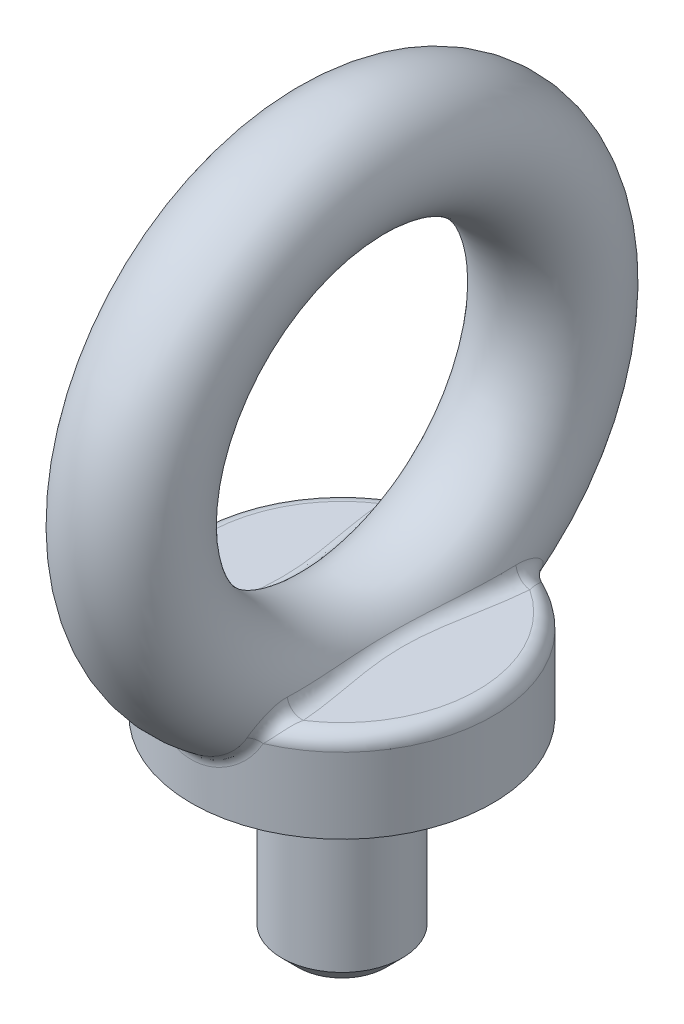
ISO-10303-21;
HEADER;
FILE_DESCRIPTION(('STEP AP214'),'2;1');
FILE_NAME('part.step','',(''),(''),'','','');
FILE_SCHEMA(('AUTOMOTIVE_DESIGN { 1 0 10303 214 1 1 1 1 }'));
ENDSEC;
DATA;
#1=APPLICATION_CONTEXT('core data for automotive mechanical design processes');
#2=APPLICATION_PROTOCOL_DEFINITION('international standard','automotive_design',2000,#1);
#3=PRODUCT_CONTEXT('',#1,'mechanical');
#4=PRODUCT('Part','Part','',(#3));
#5=PRODUCT_RELATED_PRODUCT_CATEGORY('part','',(#4));
#6=PRODUCT_DEFINITION_FORMATION('','',#4);
#7=PRODUCT_DEFINITION_CONTEXT('part definition',#1,'design');
#8=PRODUCT_DEFINITION('design','',#6,#7);
#9=PRODUCT_DEFINITION_SHAPE('','',#8);
#10=(LENGTH_UNIT() NAMED_UNIT(*) SI_UNIT(.MILLI.,.METRE.));
#11=(NAMED_UNIT(*) PLANE_ANGLE_UNIT() SI_UNIT($,.RADIAN.));
#12=(NAMED_UNIT(*) SI_UNIT($,.STERADIAN.) SOLID_ANGLE_UNIT());
#13=UNCERTAINTY_MEASURE_WITH_UNIT(LENGTH_MEASURE(1.E-05),#10,'distance_accuracy_value','');
#14=(GEOMETRIC_REPRESENTATION_CONTEXT(3) GLOBAL_UNCERTAINTY_ASSIGNED_CONTEXT((#13)) GLOBAL_UNIT_ASSIGNED_CONTEXT((#10,
#11,#12)) REPRESENTATION_CONTEXT('',''));
#15=CARTESIAN_POINT('',(0.,0.,0.));
#16=DIRECTION('',(0.,0.,1.));
#17=DIRECTION('',(1.,0.,0.));
#18=AXIS2_PLACEMENT_3D('',#15,#16,#17);
#19=CARTESIAN_POINT('',(0.,-4.,0.));
#20=DIRECTION('',(0.,1.,0.));
#21=DIRECTION('',(0.,0.,1.));
#22=AXIS2_PLACEMENT_3D('',#19,#20,#21);
#23=PLANE('',#22);
#24=CARTESIAN_POINT('',(0.,-4.,0.));
#25=DIRECTION('',(0.,1.,0.));
#26=DIRECTION('',(0.,0.,1.));
#27=AXIS2_PLACEMENT_3D('',#24,#25,#26);
#28=CIRCLE('',#27,10.);
#29=CARTESIAN_POINT('',(0.,-4.,10.));
#30=VERTEX_POINT('',#29);
#31=EDGE_CURVE('E132',#30,#30,#28,.T.);
#32=ORIENTED_EDGE('',*,*,#31,.F.);
#33=EDGE_LOOP('',(#32));
#34=FACE_BOUND('',#33,.T.);
#35=CARTESIAN_POINT('',(0.,-4.00000000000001,0.));
#36=DIRECTION('',(0.,1.,0.));
#37=DIRECTION('',(0.,0.,1.));
#38=AXIS2_PLACEMENT_3D('',#35,#36,#37);
#39=CIRCLE('',#38,2.9);
#40=CARTESIAN_POINT('',(0.,-4.00000000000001,2.9));
#41=VERTEX_POINT('',#40);
#42=EDGE_CURVE('E227',#41,#41,#39,.T.);
#43=ORIENTED_EDGE('',*,*,#42,.T.);
#44=EDGE_LOOP('',(#43));
#45=FACE_BOUND('',#44,.T.);
#46=ADVANCED_FACE('F34',(#34,#45),#23,.F.);
#47=CARTESIAN_POINT('',(0.,14.,0.));
#48=DIRECTION('',(-1.,0.,0.));
#49=DIRECTION('',(0.,0.,1.));
#50=AXIS2_PLACEMENT_3D('',#47,#48,#49);
#51=TOROIDAL_SURFACE('',#50,14.,4.);
#52=CARTESIAN_POINT('',(-3.25886300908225,0.948533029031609,-9.79711192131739));
#53=CARTESIAN_POINT('',(-3.39253498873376,0.902980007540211,-9.42358163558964));
#54=CARTESIAN_POINT('',(-3.71354249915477,0.742394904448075,-9.24855377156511));
#55=CARTESIAN_POINT('',(-3.29609888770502,1.02313794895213,-9.80943943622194));
#56=CARTESIAN_POINT('',(-3.42319414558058,0.961624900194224,-9.42125210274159));
#57=CARTESIAN_POINT('',(-3.75245968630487,0.785504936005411,-9.2452965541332));
#58=CARTESIAN_POINT('',(-3.33360620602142,1.09735737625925,-9.81555456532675));
#59=CARTESIAN_POINT('',(-3.45361666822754,1.01917218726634,-9.41346865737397));
#60=CARTESIAN_POINT('',(-3.79250827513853,0.828651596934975,-9.23807441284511));
#61=CARTESIAN_POINT('',(-3.40788304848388,1.24441620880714,-9.81638932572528));
#62=CARTESIAN_POINT('',(-3.51320230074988,1.13176432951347,-9.38858346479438));
#63=CARTESIAN_POINT('',(-3.87346747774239,0.914636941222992,-9.21650075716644));
#64=CARTESIAN_POINT('',(-3.4446530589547,1.31725652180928,-9.81111673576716));
#65=CARTESIAN_POINT('',(-3.54237881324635,1.18683331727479,-9.37138039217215));
#66=CARTESIAN_POINT('',(-3.91437748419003,0.957475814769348,-9.20215411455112));
#67=CARTESIAN_POINT('',(-3.53281549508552,1.49437378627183,-9.78537670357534));
#68=CARTESIAN_POINT('',(-3.61154666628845,1.31872677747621,-9.31914346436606));
#69=CARTESIAN_POINT('',(-4.01456451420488,1.06223284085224,-9.15900792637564));
#70=CARTESIAN_POINT('',(-3.58308662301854,1.59757427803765,-9.75899948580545));
#71=CARTESIAN_POINT('',(-3.64998972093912,1.39327985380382,-9.27947159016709));
#72=CARTESIAN_POINT('',(-4.07356646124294,1.12379170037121,-9.1265916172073));
#73=CARTESIAN_POINT('',(-3.67679312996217,1.79796720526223,-9.68611936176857));
#74=CARTESIAN_POINT('',(-3.72037131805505,1.53307968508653,-9.18684993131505));
#75=CARTESIAN_POINT('',(-4.18786929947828,1.24439581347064,-9.04983660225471));
#76=CARTESIAN_POINT('',(-3.72021745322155,1.89514977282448,-9.63958435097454));
#77=CARTESIAN_POINT('',(-3.75218871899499,1.59815593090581,-9.13363585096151));
#78=CARTESIAN_POINT('',(-4.24316412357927,1.30343689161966,-9.00547892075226));
#79=CARTESIAN_POINT('',(-3.79831652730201,2.08091817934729,-9.52795305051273));
#80=CARTESIAN_POINT('',(-3.80905506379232,1.71704266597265,-9.01709651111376));
#81=CARTESIAN_POINT('',(-4.34820285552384,1.41751102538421,-8.90619424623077));
#82=CARTESIAN_POINT('',(-3.83300026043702,2.1695127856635,-9.46287596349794));
#83=CARTESIAN_POINT('',(-3.83397125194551,1.77062443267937,-8.95363742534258));
#84=CARTESIAN_POINT('',(-4.39795243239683,1.47254815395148,-8.85127820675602));
#85=CARTESIAN_POINT('',(-3.89257227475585,2.3353921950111,-9.31555865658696));
#86=CARTESIAN_POINT('',(-3.87790497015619,1.86533576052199,-8.81925354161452));
#87=CARTESIAN_POINT('',(-4.49094272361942,1.5770594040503,-8.73206447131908));
#88=CARTESIAN_POINT('',(-3.91746571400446,2.4126829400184,-9.23332750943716));
#89=CARTESIAN_POINT('',(-3.89679049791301,1.90618518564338,-8.7483043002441));
#90=CARTESIAN_POINT('',(-4.53418685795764,1.62653644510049,-8.66777174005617));
#91=CARTESIAN_POINT('',(-3.95725825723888,2.5531854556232,-9.0530024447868));
#92=CARTESIAN_POINT('',(-3.9302229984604,1.97500944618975,-8.6007307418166));
#93=CARTESIAN_POINT('',(-4.61404375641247,1.71833686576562,-8.53084242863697));
#94=CARTESIAN_POINT('',(-3.97212982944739,2.61635812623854,-8.95486574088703));
#95=CARTESIAN_POINT('',(-3.94465104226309,2.00266560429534,-8.52416644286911));
#96=CARTESIAN_POINT('',(-4.65063805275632,1.76064030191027,-8.45818350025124));
#97=CARTESIAN_POINT('',(-3.99244273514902,2.72536141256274,-8.74493324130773));
#98=CARTESIAN_POINT('',(-3.97072885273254,2.04486241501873,-8.36680252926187));
#99=CARTESIAN_POINT('',(-4.71760283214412,1.83613680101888,-8.30608306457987));
#100=CARTESIAN_POINT('',(-3.9978882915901,2.77119978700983,-8.63314358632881));
#101=CARTESIAN_POINT('',(-3.98231141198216,2.05917757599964,-8.28612405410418));
#102=CARTESIAN_POINT('',(-4.74797609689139,1.86933393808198,-8.2266446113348));
#103=CARTESIAN_POINT('',(-4.00104801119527,2.8423058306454,-8.40118367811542));
#104=CARTESIAN_POINT('',(-4.0037062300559,2.07440422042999,-8.1231116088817));
#105=CARTESIAN_POINT('',(-4.80332638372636,1.92444004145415,-8.06438828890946));
#106=CARTESIAN_POINT('',(-3.99894299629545,2.8680368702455,-8.28127602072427));
#107=CARTESIAN_POINT('',(-4.01352352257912,2.07546392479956,-8.04091965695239));
#108=CARTESIAN_POINT('',(-4.82841457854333,1.94659873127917,-7.98169575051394));
#109=CARTESIAN_POINT('',(-3.98983314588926,2.89945276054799,-8.03350543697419));
#110=CARTESIAN_POINT('',(-4.03241959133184,2.0643281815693,-7.87370711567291));
#111=CARTESIAN_POINT('',(-4.87619726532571,1.97983744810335,-7.81252015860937));
#112=CARTESIAN_POINT('',(-3.98282416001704,2.90512060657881,-7.90563585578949));
#113=CARTESIAN_POINT('',(-4.0414895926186,2.05196876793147,-7.78864849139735));
#114=CARTESIAN_POINT('',(-4.89888971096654,1.99090807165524,-7.72603395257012));
#115=CARTESIAN_POINT('',(-3.96670667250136,2.89625845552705,-7.64374389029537));
#116=CARTESIAN_POINT('',(-4.05942229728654,2.01254584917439,-7.61653268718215));
#117=CARTESIAN_POINT('',(-4.94457822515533,2.00163779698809,-7.5496468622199));
#118=CARTESIAN_POINT('',(-3.95757734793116,2.88152042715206,-7.50967180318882));
#119=CARTESIAN_POINT('',(-4.06829852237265,1.98509473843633,-7.52925157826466));
#120=CARTESIAN_POINT('',(-4.96757501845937,2.00117853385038,-7.45972003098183));
#121=CARTESIAN_POINT('',(-3.94448345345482,2.84501183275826,-7.30759683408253));
#122=CARTESIAN_POINT('',(-4.08162345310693,1.93229455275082,-7.40068485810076));
#123=CARTESIAN_POINT('',(-5.00383758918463,1.99199708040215,-7.32391832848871));
#124=CARTESIAN_POINT('',(-3.9402178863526,2.83043681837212,-7.24006105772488));
#125=CARTESIAN_POINT('',(-4.08610482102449,1.91255733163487,-7.35786602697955));
#126=CARTESIAN_POINT('',(-5.01622285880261,1.98751907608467,-7.27848817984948));
#127=CARTESIAN_POINT('',(-3.93216426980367,2.79675902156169,-7.1050442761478));
#128=CARTESIAN_POINT('',(-4.09513398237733,1.86904572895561,-7.2733644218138));
#129=CARTESIAN_POINT('',(-5.04179313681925,1.97584203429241,-7.18743950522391));
#130=CARTESIAN_POINT('',(-3.92837609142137,2.77765746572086,-7.03756326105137));
#131=CARTESIAN_POINT('',(-4.09968960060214,1.8451971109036,-7.23162569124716));
#132=CARTESIAN_POINT('',(-5.05497792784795,1.96864373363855,-7.14182103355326));
#133=CARTESIAN_POINT('',(-3.92496363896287,2.75642628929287,-6.9702744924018));
#134=CARTESIAN_POINT('',(-4.10427742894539,1.81941286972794,-7.19095888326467));
#135=CARTESIAN_POINT('',(-5.06867173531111,1.96014005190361,-7.09615030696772));
#136=(BOUNDED_SURFACE() B_SPLINE_SURFACE(3,2,((#52,#53,#54),(#55,#56,#57),(#58,#59,#60),(#61,
#62,#63),(#64,#65,#66),(#67,#68,#69),(#70,#71,#72),(#73,#74,#75),(#76,#77,#78),(#79,#80,#81),
(#82,#83,#84),(#85,#86,#87),(#88,#89,#90),(#91,#92,#93),(#94,#95,#96),(#97,#98,#99),(#100,#101,
#102),(#103,#104,#105),(#106,#107,#108),(#109,#110,#111),(#112,#113,#114),(#115,#116,#117),
(#118,#119,#120),(#121,#122,#123),(#124,#125,#126),(#127,#128,#129),(#130,#131,#132),(#133,#134,
#135)),.UNSPECIFIED.,.F.,.F.,.F.) B_SPLINE_SURFACE_WITH_KNOTS((4,2,2,2,2,2,2,2,2,2,2,2,2,4),(3,
3),(0.,0.293945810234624,0.587690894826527,1.01757781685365,1.44815193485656,1.87828174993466,
2.30818464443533,2.73926379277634,3.17014976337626,3.59078645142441,4.01177956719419,
4.4370963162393,4.64985677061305,4.86255963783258),(0.,1.),
.UNSPECIFIED.) GEOMETRIC_REPRESENTATION_ITEM() RATIONAL_B_SPLINE_SURFACE(((1.,0.928689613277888,
1.),(1.,0.924429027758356,1.),(1.,0.919900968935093,1.),(1.,0.910463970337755,1.),(1.,
0.905555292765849,1.),(1.,0.893175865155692,1.),(1.,0.88557207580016,1.),(1.,0.870264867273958,
1.),(1.,0.862561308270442,1.),(1.,0.847446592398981,1.),(1.,0.840035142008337,1.),(1.,
0.82583888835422,1.),(1.,0.819053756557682,1.),(1.,0.806325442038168,1.),(1.,0.800384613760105,
1.),(1.,0.789400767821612,1.),(1.,0.78435734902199,1.),(1.,0.774989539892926,1.),(1.,
0.77065089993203,1.),(1.,0.76194832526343,1.),(1.,0.757584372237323,1.),(1.,0.747923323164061,
1.),(1.,0.742617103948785,1.),(1.,0.73327232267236,1.),(1.,0.729925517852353,1.),(1.,
0.722663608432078,1.),(1.,0.718748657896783,1.),(1.,0.714495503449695,1.))) REPRESENTATION_ITEM('') SURFACE());
#137=CARTESIAN_POINT('',(-3.92496363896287,2.75642628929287,-6.9702744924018));
#138=CARTESIAN_POINT('',(-3.92837609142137,2.77765746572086,-7.03756326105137));
#139=CARTESIAN_POINT('',(-3.93216426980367,2.79675902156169,-7.1050442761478));
#140=CARTESIAN_POINT('',(-3.9402178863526,2.83043681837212,-7.24006105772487));
#141=CARTESIAN_POINT('',(-3.94448345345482,2.84501183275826,-7.30759683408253));
#142=CARTESIAN_POINT('',(-3.95757734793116,2.88152042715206,-7.50967180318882));
#143=CARTESIAN_POINT('',(-3.96670667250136,2.89625845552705,-7.64374389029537));
#144=CARTESIAN_POINT('',(-3.98282416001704,2.90512060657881,-7.90563585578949));
#145=CARTESIAN_POINT('',(-3.98983314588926,2.89945276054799,-8.03350543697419));
#146=CARTESIAN_POINT('',(-3.99894299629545,2.8680368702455,-8.28127602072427));
#147=CARTESIAN_POINT('',(-4.00104801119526,2.8423058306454,-8.40118367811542));
#148=CARTESIAN_POINT('',(-3.9978882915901,2.77119978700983,-8.63314358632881));
#149=CARTESIAN_POINT('',(-3.99244273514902,2.72536141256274,-8.74493324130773));
#150=CARTESIAN_POINT('',(-3.97212982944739,2.61635812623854,-8.95486574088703));
#151=CARTESIAN_POINT('',(-3.95725825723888,2.5531854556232,-9.0530024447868));
#152=CARTESIAN_POINT('',(-3.91746571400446,2.4126829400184,-9.23332750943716));
#153=CARTESIAN_POINT('',(-3.89257227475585,2.3353921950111,-9.31555865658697));
#154=CARTESIAN_POINT('',(-3.83300026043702,2.1695127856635,-9.46287596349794));
#155=CARTESIAN_POINT('',(-3.79831652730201,2.08091817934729,-9.52795305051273));
#156=CARTESIAN_POINT('',(-3.72021745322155,1.89514977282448,-9.63958435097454));
#157=CARTESIAN_POINT('',(-3.67679312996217,1.79796720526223,-9.68611936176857));
#158=CARTESIAN_POINT('',(-3.58308662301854,1.59757427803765,-9.75899948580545));
#159=CARTESIAN_POINT('',(-3.53281549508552,1.49437378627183,-9.78537670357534));
#160=CARTESIAN_POINT('',(-3.4446530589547,1.31725652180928,-9.81111673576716));
#161=CARTESIAN_POINT('',(-3.40788304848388,1.24441620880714,-9.81638932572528));
#162=CARTESIAN_POINT('',(-3.33360620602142,1.09735737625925,-9.81555456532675));
#163=CARTESIAN_POINT('',(-3.29609888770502,1.02313794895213,-9.80943943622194));
#164=CARTESIAN_POINT('',(-3.25886300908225,0.948533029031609,-9.79711192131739));
#165=B_SPLINE_CURVE_WITH_KNOTS('',3,(#137,#138,#139,#140,#141,#142,#143,#144,#145,#146,#147,
#148,#149,#150,#151,#152,#153,#154,#155,#156,#157,#158,#159,#160,#161,#162,#163,#164),
.UNSPECIFIED.,.F.,.F.,(4,2,2,2,2,2,2,2,2,2,2,2,2,4),(0.,0.212702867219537,0.425463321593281,
0.850780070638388,1.27177318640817,1.69240987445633,2.12329584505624,2.55437499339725,
2.98427788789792,3.41440770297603,3.84498182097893,4.27486874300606,4.56861382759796,
4.86255963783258),.UNSPECIFIED.);
#166=CARTESIAN_POINT('',(-3.96299206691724,2.88793565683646,-7.59056782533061));
#167=VERTEX_POINT('',#166);
#168=CARTESIAN_POINT('',(-3.48044097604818,1.38915401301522,-9.8006680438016));
#169=VERTEX_POINT('',#168);
#170=EDGE_CURVE('E364',#167,#169,#165,.T.);
#171=ORIENTED_EDGE('',*,*,#170,.F.);
#172=CARTESIAN_POINT('',(-3.89555767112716,3.16499723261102,-10.2398198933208));
#173=CARTESIAN_POINT('',(-3.70311632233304,2.,-10.2090072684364));
#174=CARTESIAN_POINT('',(-4.86944708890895,2.,-10.3957535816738));
#175=CARTESIAN_POINT('',(-3.93803369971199,3.13438989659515,-9.94195751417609));
#176=CARTESIAN_POINT('',(-3.78510791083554,2.,-9.93016538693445));
#177=CARTESIAN_POINT('',(-4.92254212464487,2.,-10.0639255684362));
#178=CARTESIAN_POINT('',(-3.96630344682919,3.10289116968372,-9.63982494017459));
#179=CARTESIAN_POINT('',(-3.85290640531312,2.,-9.63608438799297));
#180=CARTESIAN_POINT('',(-4.95787930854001,2.,-9.72984285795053));
#181=CARTESIAN_POINT('',(-3.99883705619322,3.03892429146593,-9.02975171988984));
#182=CARTESIAN_POINT('',(-3.95844461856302,2.,-9.0345989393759));
#183=CARTESIAN_POINT('',(-4.99854632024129,2.,-9.06086157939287));
#184=CARTESIAN_POINT('',(-4.00317866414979,3.00645962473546,-8.7218331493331));
#185=CARTESIAN_POINT('',(-3.99729502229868,2.,-8.72756821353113));
#186=CARTESIAN_POINT('',(-5.00397333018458,2.,-8.7259691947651));
#187=CARTESIAN_POINT('',(-3.99255472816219,2.94161751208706,-8.10525427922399));
#188=CARTESIAN_POINT('',(-4.04821557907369,2.,-8.10830085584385));
#189=CARTESIAN_POINT('',(-4.99069341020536,2.,-8.06149759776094));
#190=CARTESIAN_POINT('',(-3.97785537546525,2.9092450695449,-7.79666313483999));
#191=CARTESIAN_POINT('',(-4.0614538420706,2.,-7.79626515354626));
#192=CARTESIAN_POINT('',(-4.97231921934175,2.,-7.73190895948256));
#193=CARTESIAN_POINT('',(-3.93383184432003,2.84489485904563,-7.17476815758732));
#194=CARTESIAN_POINT('',(-4.06668658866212,2.,-7.1660806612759));
#195=CARTESIAN_POINT('',(-4.91728980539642,2.,-7.07405886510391));
#196=CARTESIAN_POINT('',(-3.9044952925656,2.81291744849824,-6.86146055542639));
#197=CARTESIAN_POINT('',(-4.0592602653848,2.,-6.84758808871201));
#198=CARTESIAN_POINT('',(-4.88061911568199,2.,-6.74579876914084));
#199=CARTESIAN_POINT('',(-3.83364320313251,2.7485737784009,-6.21331619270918));
#200=CARTESIAN_POINT('',(-4.02718369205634,2.,-6.18992579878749));
#201=CARTESIAN_POINT('',(-4.792054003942,2.,-6.07346038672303));
#202=CARTESIAN_POINT('',(-3.79155781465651,2.71627899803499,-5.87822738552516));
#203=CARTESIAN_POINT('',(-4.00203810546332,2.,-5.84946426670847));
#204=CARTESIAN_POINT('',(-4.73944726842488,2.,-5.72948020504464));
#205=CARTESIAN_POINT('',(-3.70116801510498,2.65427674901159,-5.20224335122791));
#206=CARTESIAN_POINT('',(-3.93982897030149,2.,-5.16529351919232));
#207=CARTESIAN_POINT('',(-4.62646001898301,2.,-5.04278417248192));
#208=CARTESIAN_POINT('',(-3.65286242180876,2.62456977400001,-4.8613470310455));
#209=CARTESIAN_POINT('',(-3.90295222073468,2.,-4.82071521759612));
#210=CARTESIAN_POINT('',(-4.56607802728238,2.,-4.70006857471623));
#211=CARTESIAN_POINT('',(-3.55565822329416,2.56902522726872,-4.17274043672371));
#212=CARTESIAN_POINT('',(-3.82418012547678,2.,-4.12843562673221));
#213=CARTESIAN_POINT('',(-4.44457277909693,2.,-4.01458523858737));
#214=CARTESIAN_POINT('',(-3.50675930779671,2.54318978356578,-3.82502653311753));
#215=CARTESIAN_POINT('',(-3.78224884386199,2.,-3.77964407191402));
#216=CARTESIAN_POINT('',(-4.38344913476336,2.,-3.67181757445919));
#217=CARTESIAN_POINT('',(-3.41452473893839,2.49680432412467,-3.12221520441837));
#218=CARTESIAN_POINT('',(-3.70086044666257,2.,-3.07887883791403));
#219=CARTESIAN_POINT('',(-4.26815592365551,2.,-2.98494544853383));
#220=CARTESIAN_POINT('',(-3.37119061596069,2.47625576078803,-2.76711577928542));
#221=CARTESIAN_POINT('',(-3.66120721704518,2.,-2.72558822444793));
#222=CARTESIAN_POINT('',(-4.21398826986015,2.,-2.64084064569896));
#223=CARTESIAN_POINT('',(-3.311087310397,2.44861640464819,-2.19099808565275));
#224=CARTESIAN_POINT('',(-3.60541101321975,2.,-2.15445191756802));
#225=CARTESIAN_POINT('',(-4.13885913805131,2.,-2.08622375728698));
#226=CARTESIAN_POINT('',(-3.2905712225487,2.43941048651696,-1.97213462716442));
#227=CARTESIAN_POINT('',(-3.58614698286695,2.,-1.93824201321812));
#228=CARTESIAN_POINT('',(-4.11321402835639,2.,-1.87636010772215));
#229=CARTESIAN_POINT('',(-3.25517971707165,2.4237426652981,-1.53231886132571));
#230=CARTESIAN_POINT('',(-3.55276030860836,2.,-1.50488768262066));
#231=CARTESIAN_POINT('',(-4.06897464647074,2.,-1.45589935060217));
#232=CARTESIAN_POINT('',(-3.24030365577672,2.41728044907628,-1.31136679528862));
#233=CARTESIAN_POINT('',(-3.5385818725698,2.,-1.28736319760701));
#234=CARTESIAN_POINT('',(-4.0503795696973,2.,-1.24530232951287));
#235=CARTESIAN_POINT('',(-3.21721136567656,2.40732084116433,-0.868157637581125));
#236=CARTESIAN_POINT('',(-3.51654265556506,2.,-0.851926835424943));
#237=CARTESIAN_POINT('',(-4.02151420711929,2.,-0.823682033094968));
#238=CARTESIAN_POINT('',(-3.20899020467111,2.40382125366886,-0.645901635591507));
#239=CARTESIAN_POINT('',(-3.50863689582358,2.,-0.633610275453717));
#240=CARTESIAN_POINT('',(-4.01123775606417,2.,-0.61265918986));
#241=CARTESIAN_POINT('',(-3.19978347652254,2.39990553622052,-0.200786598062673));
#242=CARTESIAN_POINT('',(-3.4997971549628,2.,-0.197002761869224));
#243=CARTESIAN_POINT('',(-3.9997293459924,2.,-0.190363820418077));
#244=CARTESIAN_POINT('',(-3.198797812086,2.39948936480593,0.0220724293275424));
#245=CARTESIAN_POINT('',(-3.49884602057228,2.,0.0217092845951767));
#246=CARTESIAN_POINT('',(-3.99849726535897,2.,0.0209087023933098));
#247=CARTESIAN_POINT('',(-3.20414253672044,2.40175857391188,0.467768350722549));
#248=CARTESIAN_POINT('',(-3.50398149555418,2.,0.458800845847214));
#249=CARTESIAN_POINT('',(-4.00517817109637,2.,0.443620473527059));
#250=CARTESIAN_POINT('',(-3.21048383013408,2.40444857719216,0.690604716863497));
#251=CARTESIAN_POINT('',(-3.5100886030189,2.,0.677603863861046));
#252=CARTESIAN_POINT('',(-4.01310478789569,2.,0.655059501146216));
#253=CARTESIAN_POINT('',(-3.2300228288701,2.41283534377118,1.13502864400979));
#254=CARTESIAN_POINT('',(-3.52877524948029,2.,1.11399363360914));
#255=CARTESIAN_POINT('',(-4.03752853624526,2.,1.0774352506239));
#256=CARTESIAN_POINT('',(-3.24322071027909,2.41853218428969,1.35661617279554));
#257=CARTESIAN_POINT('',(-3.54138986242,2.,1.33199275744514));
#258=CARTESIAN_POINT('',(-4.05402588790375,2.,1.28837195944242));
#259=CARTESIAN_POINT('',(-3.2918153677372,2.43986644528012,2.018745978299));
#260=CARTESIAN_POINT('',(-3.58751081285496,2.,1.9852779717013));
#261=CARTESIAN_POINT('',(-4.11476920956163,2.,1.92041858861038));
#262=CARTESIAN_POINT('',(-3.33620644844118,2.45974527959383,2.45629828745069));
#263=CARTESIAN_POINT('',(-3.62941258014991,2.,2.41890188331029));
#264=CARTESIAN_POINT('',(-4.17025806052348,2.,2.34042776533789));
#265=CARTESIAN_POINT('',(-3.42911407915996,2.50403938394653,3.24135375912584));
#266=CARTESIAN_POINT('',(-3.71376249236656,2.,3.19700981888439));
#267=CARTESIAN_POINT('',(-4.28639259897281,2.,3.10091845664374));
#268=CARTESIAN_POINT('',(-3.47538449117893,2.52695611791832,3.5906670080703));
#269=CARTESIAN_POINT('',(-3.75507512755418,2.,3.5457797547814));
#270=CARTESIAN_POINT('',(-4.34423061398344,2.,3.44187121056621));
#271=CARTESIAN_POINT('',(-3.57066547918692,2.57737653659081,4.28221613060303));
#272=CARTESIAN_POINT('',(-3.83654270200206,2.,4.2378655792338));
#273=CARTESIAN_POINT('',(-4.46333184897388,2.,4.12302857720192));
#274=CARTESIAN_POINT('',(-3.61967491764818,2.60487832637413,4.62445486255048));
#275=CARTESIAN_POINT('',(-3.87682876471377,2.,4.58237122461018));
#276=CARTESIAN_POINT('',(-4.52459364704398,2.,4.46323344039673));
#277=CARTESIAN_POINT('',(-3.71449173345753,2.6630422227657,5.30153422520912));
#278=CARTESIAN_POINT('',(-3.94942071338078,2.,5.26523087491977));
#279=CARTESIAN_POINT('',(-4.64311466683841,2.,5.14309229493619));
#280=CARTESIAN_POINT('',(-3.76031006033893,2.69369252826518,5.63639715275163));
#281=CARTESIAN_POINT('',(-3.98170155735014,2.,5.60458952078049));
#282=CARTESIAN_POINT('',(-4.70038757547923,2.,5.4827438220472));
#283=CARTESIAN_POINT('',(-3.84362997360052,2.75703056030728,6.30074377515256));
#284=CARTESIAN_POINT('',(-4.03246253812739,2.,6.27826859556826));
#285=CARTESIAN_POINT('',(-4.80453746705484,2.,6.1636207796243));
#286=CARTESIAN_POINT('',(-3.88113350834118,2.7897178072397,6.63022871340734));
#287=CARTESIAN_POINT('',(-4.05066053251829,2.,6.61334177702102));
#288=CARTESIAN_POINT('',(-4.85141688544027,2.,6.50484582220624));
#289=CARTESIAN_POINT('',(-3.94305265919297,2.85628644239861,7.28648331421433));
#290=CARTESIAN_POINT('',(-4.06792152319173,2.,7.2796497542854));
#291=CARTESIAN_POINT('',(-4.92881582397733,2.,7.19148245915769));
#292=CARTESIAN_POINT('',(-3.96738230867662,2.89017417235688,7.61322176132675));
#293=CARTESIAN_POINT('',(-4.06631094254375,2.,7.61131269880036));
#294=CARTESIAN_POINT('',(-4.95922788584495,2.,7.53690686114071));
#295=CARTESIAN_POINT('',(-3.99762895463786,2.95794910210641,8.26125372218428));
#296=CARTESIAN_POINT('',(-4.03880728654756,2.,8.26578765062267));
#297=CARTESIAN_POINT('',(-4.99703619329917,2.,8.22873074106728));
#298=CARTESIAN_POINT('',(-4.00356652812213,2.99183626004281,8.58255292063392));
#299=CARTESIAN_POINT('',(-4.01213050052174,2.,8.58886209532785));
#300=CARTESIAN_POINT('',(-5.00445816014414,2.,8.57512869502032));
#301=CARTESIAN_POINT('',(-3.99205800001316,3.05952797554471,9.22598020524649));
#302=CARTESIAN_POINT('',(-3.92936684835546,2.,9.22970255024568));
#303=CARTESIAN_POINT('',(-4.99007250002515,2.,9.27507987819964));
#304=CARTESIAN_POINT('',(-3.97410430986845,3.09331495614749,9.54797643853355));
#305=CARTESIAN_POINT('',(-3.87157496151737,2.,9.54682883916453));
#306=CARTESIAN_POINT('',(-4.96763038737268,2.,9.62862613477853));
#307=CARTESIAN_POINT('',(-3.90858652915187,3.15940717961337,10.1841872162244));
#308=CARTESIAN_POINT('',(-3.72327900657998,2.,10.1638355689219));
#309=CARTESIAN_POINT('',(-4.88573316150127,2.,10.3328421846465));
#310=CARTESIAN_POINT('',(-3.86089389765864,3.19170533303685,10.4983617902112));
#311=CARTESIAN_POINT('',(-3.63134189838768,2.,10.4629292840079));
#312=CARTESIAN_POINT('',(-4.82611737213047,2.,10.6834927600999));
#313=CARTESIAN_POINT('',(-3.79570852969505,3.22278630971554,10.8064674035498));
#314=CARTESIAN_POINT('',(-3.52370100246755,2.,10.7424329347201));
#315=CARTESIAN_POINT('',(-4.74463566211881,2.,11.0298584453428));
#316=(BOUNDED_SURFACE() B_SPLINE_SURFACE(3,2,((#172,#173,#174),(#175,#176,#177),(#178,#179,
#180),(#181,#182,#183),(#184,#185,#186),(#187,#188,#189),(#190,#191,#192),(#193,#194,#195),
(#196,#197,#198),(#199,#200,#201),(#202,#203,#204),(#205,#206,#207),(#208,#209,#210),(#211,#212,
#213),(#214,#215,#216),(#217,#218,#219),(#220,#221,#222),(#223,#224,#225),(#226,#227,#228),
(#229,#230,#231),(#232,#233,#234),(#235,#236,#237),(#238,#239,#240),(#241,#242,#243),(#244,#245,
#246),(#247,#248,#249),(#250,#251,#252),(#253,#254,#255),(#256,#257,#258),(#259,#260,#261),
(#262,#263,#264),(#265,#266,#267),(#268,#269,#270),(#271,#272,#273),(#274,#275,#276),(#277,#278,
#279),(#280,#281,#282),(#283,#284,#285),(#286,#287,#288),(#289,#290,#291),(#292,#293,#294),
(#295,#296,#297),(#298,#299,#300),(#301,#302,#303),(#304,#305,#306),(#307,#308,#309),(#310,#311,
#312),(#313,#314,#315)),.UNSPECIFIED.,.F.,.F.,.F.) B_SPLINE_SURFACE_WITH_KNOTS((4,2,2,2,2,2,2,2,
2,2,2,2,2,2,2,2,2,2,2,2,2,2,2,4),(3,3),(0.,1.00684160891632,2.01040991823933,3.0000986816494,
3.99062548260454,5.03439150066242,6.07835619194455,7.12289261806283,8.16771569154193,
8.80189481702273,9.4360015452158,10.0696378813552,10.7032656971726,11.3378377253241,
11.9724260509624,13.2426120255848,14.2800695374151,15.3170993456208,16.3503749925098,
17.3834082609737,18.4231037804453,19.4616356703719,20.5225880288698,21.5881582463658),(0.,1.),
.UNSPECIFIED.) GEOMETRIC_REPRESENTATION_ITEM() RATIONAL_B_SPLINE_SURFACE(((1.,0.646143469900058,
1.),(1.,0.657994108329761,1.),(1.,0.66984722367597,1.),(1.,0.693305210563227,1.),(1.,
0.704910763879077,1.),(1.,0.727542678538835,1.),(1.,0.738574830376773,1.),(1.,0.760044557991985,
1.),(1.,0.770481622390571,1.),(1.,0.791091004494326,1.),(1.,0.801218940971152,1.),(1.,
0.820337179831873,1.),(1.,0.829327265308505,1.),(1.,0.845905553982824,1.),(1.,0.85349298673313,
1.),(1.,0.866973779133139,1.),(1.,0.872866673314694,1.),(1.,0.880738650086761,1.),(1.,
0.883345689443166,1.),(1.,0.887768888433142,1.),(1.,0.889585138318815,1.),(1.,0.892379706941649,
1.),(1.,0.8933586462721,1.),(1.,0.894453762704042,1.),(1.,0.894569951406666,1.),(1.,
0.893935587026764,1.),(1.,0.893183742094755,1.),(1.,0.890833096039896,1.),(1.,0.889234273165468,
1.),(1.,0.883223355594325,1.),(1.,0.877597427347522,1.),(1.,0.864877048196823,1.),(1.,
0.858240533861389,1.),(1.,0.843425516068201,1.),(1.,0.835247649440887,1.),(1.,0.817652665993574,
1.),(1.,0.808240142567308,1.),(1.,0.788405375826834,1.),(1.,0.777983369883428,1.),(1.,
0.756290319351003,1.),(1.,0.745014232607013,1.),(1.,0.721913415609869,1.),(1.,0.710089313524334,
1.),(1.,0.685846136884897,1.),(1.,0.673419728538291,1.),(1.,0.648426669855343,1.),(1.,
0.635859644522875,1.),(1.,0.623383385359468,1.))) REPRESENTATION_ITEM('') SURFACE());
#317=CARTESIAN_POINT('',(-3.89555767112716,3.16499723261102,-10.2398198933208));
#318=CARTESIAN_POINT('',(-3.93803369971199,3.13438989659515,-9.94195751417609));
#319=CARTESIAN_POINT('',(-3.96630344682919,3.10289116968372,-9.63982494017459));
#320=CARTESIAN_POINT('',(-3.99883705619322,3.03892429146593,-9.02975171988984));
#321=CARTESIAN_POINT('',(-4.00317866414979,3.00645962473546,-8.7218331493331));
#322=CARTESIAN_POINT('',(-3.99255472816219,2.94161751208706,-8.10525427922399));
#323=CARTESIAN_POINT('',(-3.97785537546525,2.9092450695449,-7.79666313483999));
#324=CARTESIAN_POINT('',(-3.93383184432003,2.84489485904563,-7.17476815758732));
#325=CARTESIAN_POINT('',(-3.9044952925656,2.81291744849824,-6.86146055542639));
#326=CARTESIAN_POINT('',(-3.83364320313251,2.7485737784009,-6.21331619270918));
#327=CARTESIAN_POINT('',(-3.79155781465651,2.71627899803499,-5.87822738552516));
#328=CARTESIAN_POINT('',(-3.70116801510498,2.65427674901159,-5.20224335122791));
#329=CARTESIAN_POINT('',(-3.65286242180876,2.62456977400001,-4.8613470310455));
#330=CARTESIAN_POINT('',(-3.55565822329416,2.56902522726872,-4.17274043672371));
#331=CARTESIAN_POINT('',(-3.50675930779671,2.54318978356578,-3.82502653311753));
#332=CARTESIAN_POINT('',(-3.41452473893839,2.49680432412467,-3.12221520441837));
#333=CARTESIAN_POINT('',(-3.37119061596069,2.47625576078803,-2.76711577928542));
#334=CARTESIAN_POINT('',(-3.311087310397,2.44861640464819,-2.19099808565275));
#335=CARTESIAN_POINT('',(-3.2905712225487,2.43941048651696,-1.97213462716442));
#336=CARTESIAN_POINT('',(-3.25517971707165,2.4237426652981,-1.53231886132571));
#337=CARTESIAN_POINT('',(-3.24030365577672,2.41728044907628,-1.31136679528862));
#338=CARTESIAN_POINT('',(-3.21721136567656,2.40732084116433,-0.868157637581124));
#339=CARTESIAN_POINT('',(-3.20899020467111,2.40382125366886,-0.645901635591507));
#340=CARTESIAN_POINT('',(-3.19978347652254,2.39990553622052,-0.200786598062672));
#341=CARTESIAN_POINT('',(-3.198797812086,2.39948936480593,0.0220724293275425));
#342=CARTESIAN_POINT('',(-3.20414253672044,2.40175857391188,0.467768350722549));
#343=CARTESIAN_POINT('',(-3.21048383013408,2.40444857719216,0.690604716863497));
#344=CARTESIAN_POINT('',(-3.2300228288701,2.41283534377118,1.13502864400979));
#345=CARTESIAN_POINT('',(-3.24322071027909,2.41853218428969,1.35661617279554));
#346=CARTESIAN_POINT('',(-3.2918153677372,2.43986644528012,2.018745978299));
#347=CARTESIAN_POINT('',(-3.33620644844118,2.45974527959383,2.45629828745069));
#348=CARTESIAN_POINT('',(-3.42911407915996,2.50403938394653,3.24135375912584));
#349=CARTESIAN_POINT('',(-3.47538449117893,2.52695611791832,3.5906670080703));
#350=CARTESIAN_POINT('',(-3.57066547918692,2.57737653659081,4.28221613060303));
#351=CARTESIAN_POINT('',(-3.61967491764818,2.60487832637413,4.62445486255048));
#352=CARTESIAN_POINT('',(-3.71449173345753,2.6630422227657,5.30153422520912));
#353=CARTESIAN_POINT('',(-3.76031006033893,2.69369252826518,5.63639715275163));
#354=CARTESIAN_POINT('',(-3.84362997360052,2.75703056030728,6.30074377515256));
#355=CARTESIAN_POINT('',(-3.88113350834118,2.7897178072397,6.63022871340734));
#356=CARTESIAN_POINT('',(-3.94305265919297,2.85628644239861,7.28648331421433));
#357=CARTESIAN_POINT('',(-3.96738230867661,2.89017417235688,7.61322176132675));
#358=CARTESIAN_POINT('',(-3.99762895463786,2.95794910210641,8.26125372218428));
#359=CARTESIAN_POINT('',(-4.00356652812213,2.99183626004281,8.58255292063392));
#360=CARTESIAN_POINT('',(-3.99205800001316,3.05952797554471,9.22598020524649));
#361=CARTESIAN_POINT('',(-3.97410430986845,3.09331495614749,9.54797643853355));
#362=CARTESIAN_POINT('',(-3.90858652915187,3.15940717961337,10.1841872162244));
#363=CARTESIAN_POINT('',(-3.86089389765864,3.19170533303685,10.4983617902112));
#364=CARTESIAN_POINT('',(-3.79570852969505,3.22278630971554,10.8064674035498));
#365=B_SPLINE_CURVE_WITH_KNOTS('',3,(#317,#318,#319,#320,#321,#322,#323,#324,#325,#326,#327,
#328,#329,#330,#331,#332,#333,#334,#335,#336,#337,#338,#339,#340,#341,#342,#343,#344,#345,#346,
#347,#348,#349,#350,#351,#352,#353,#354,#355,#356,#357,#358,#359,#360,#361,#362,#363,#364),
.UNSPECIFIED.,.F.,.F.,(4,2,2,2,2,2,2,2,2,2,2,2,2,2,2,2,2,2,2,2,2,2,2,4),(0.,1.00684160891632,
2.01040991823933,3.0000986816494,3.99062548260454,5.03439150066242,6.07835619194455,
7.12289261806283,8.16771569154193,8.80189481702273,9.4360015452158,10.0696378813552,
10.7032656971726,11.3378377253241,11.9724260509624,13.2426120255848,14.2800695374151,
15.3170993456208,16.3503749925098,17.3834082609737,18.4231037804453,19.4616356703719,
20.5225880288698,21.5881582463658),.UNSPECIFIED.);
#366=CARTESIAN_POINT('',(-3.96299206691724,2.88793565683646,7.59056782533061));
#367=VERTEX_POINT('',#366);
#368=EDGE_CURVE('E109',#167,#367,#365,.T.);
#369=ORIENTED_EDGE('',*,*,#368,.T.);
#370=CARTESIAN_POINT('',(-3.91084778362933,2.62706279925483,6.62171247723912));
#371=CARTESIAN_POINT('',(-4.12881411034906,1.66519810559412,6.9870086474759));
#372=CARTESIAN_POINT('',(-5.14481187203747,1.90425031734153,6.85763751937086));
#373=CARTESIAN_POINT('',(-3.91311671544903,2.66090442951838,6.70105111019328));
#374=CARTESIAN_POINT('',(-4.12311146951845,1.7046863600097,7.03086200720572));
#375=CARTESIAN_POINT('',(-5.12614576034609,1.91967563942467,6.91245315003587));
#376=CARTESIAN_POINT('',(-3.91614649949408,2.69207647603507,6.78118451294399));
#377=CARTESIAN_POINT('',(-4.11742297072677,1.7416186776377,7.07735036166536));
#378=CARTESIAN_POINT('',(-5.10831084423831,1.93339204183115,6.96739678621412));
#379=CARTESIAN_POINT('',(-3.92338899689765,2.74855505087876,6.94243365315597));
#380=CARTESIAN_POINT('',(-4.10620225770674,1.80934171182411,7.17330482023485));
#381=CARTESIAN_POINT('',(-5.07409820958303,1.95717854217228,7.07734094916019));
#382=CARTESIAN_POINT('',(-3.92760255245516,2.77385737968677,7.02355005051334));
#383=CARTESIAN_POINT('',(-4.1006516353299,1.84032042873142,7.22286452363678));
#384=CARTESIAN_POINT('',(-5.05772153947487,1.96724603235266,7.13234148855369));
#385=CARTESIAN_POINT('',(-3.93686717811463,2.81800875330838,7.18600030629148));
#386=CARTESIAN_POINT('',(-4.08970857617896,1.89605403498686,7.32366448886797));
#387=CARTESIAN_POINT('',(-5.02625453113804,1.98347930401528,7.24209268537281));
#388=CARTESIAN_POINT('',(-3.94191780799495,2.8368611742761,7.26733402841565));
#389=CARTESIAN_POINT('',(-4.0843009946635,1.92095711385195,7.375003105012));
#390=CARTESIAN_POINT('',(-5.01116352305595,1.98964712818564,7.29684345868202));
#391=CARTESIAN_POINT('',(-3.95235052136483,2.867661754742,7.42948666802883));
#392=CARTESIAN_POINT('',(-4.07355936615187,1.96476461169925,7.47838109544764));
#393=CARTESIAN_POINT('',(-4.98189203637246,1.99790848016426,7.40584500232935));
#394=CARTESIAN_POINT('',(-3.95773246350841,2.87961283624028,7.51030578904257));
#395=CARTESIAN_POINT('',(-4.06821456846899,1.98377389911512,7.53050885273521));
#396=CARTESIAN_POINT('',(-4.96771117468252,2.00000373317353,7.46009597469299));
#397=CARTESIAN_POINT('',(-3.97181232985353,2.90189288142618,7.72516585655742));
#398=CARTESIAN_POINT('',(-4.05390735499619,2.02689740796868,7.66962392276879));
#399=CARTESIAN_POINT('',(-4.93031080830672,1.99999373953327,7.60444298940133));
#400=CARTESIAN_POINT('',(-3.98028854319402,2.90564645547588,7.85819721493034));
#401=CARTESIAN_POINT('',(-4.04485018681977,2.04622454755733,7.75725606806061));
#402=CARTESIAN_POINT('',(-4.90747146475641,1.99408456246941,7.6939420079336));
#403=CARTESIAN_POINT('',(-3.99346041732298,2.89207913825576,8.11726060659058));
#404=CARTESIAN_POINT('',(-4.02620589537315,2.07015807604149,7.92984803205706));
#405=CARTESIAN_POINT('',(-4.86047002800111,1.97048166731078,7.86950278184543));
#406=CARTESIAN_POINT('',(-3.99816155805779,2.87478888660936,8.24330253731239));
#407=CARTESIAN_POINT('',(-4.0166163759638,2.07497100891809,8.0149301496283));
#408=CARTESIAN_POINT('',(-4.83630990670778,1.95280509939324,7.95556934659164));
#409=CARTESIAN_POINT('',(-4.00096253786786,2.81996213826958,8.48573326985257));
#410=CARTESIAN_POINT('',(-3.99624670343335,2.07100686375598,8.18195418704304));
#411=CARTESIAN_POINT('',(-4.78413295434,1.90640832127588,8.12318140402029));
#412=CARTESIAN_POINT('',(-3.99905216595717,2.78239440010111,8.6021068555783));
#413=CARTESIAN_POINT('',(-3.98548787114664,2.06236801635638,8.26385079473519));
#414=CARTESIAN_POINT('',(-4.7561102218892,1.87767108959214,8.2047197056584));
#415=CARTESIAN_POINT('',(-3.98649238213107,2.68896139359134,8.82232440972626));
#416=CARTESIAN_POINT('',(-3.96170822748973,2.03168229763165,8.42398352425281));
#417=CARTESIAN_POINT('',(-4.6944123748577,1.81047614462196,8.361696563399));
#418=CARTESIAN_POINT('',(-3.97583873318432,2.63308726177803,8.9261622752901));
#419=CARTESIAN_POINT('',(-3.94873928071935,2.00983177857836,8.50210350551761));
#420=CARTESIAN_POINT('',(-4.66073452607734,1.77201372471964,8.4371321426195));
#421=CARTESIAN_POINT('',(-3.94501128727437,2.50717060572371,9.11699904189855));
#422=CARTESIAN_POINT('',(-3.91927967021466,1.95321734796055,8.6521137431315));
#423=CARTESIAN_POINT('',(-4.58758423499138,1.68797111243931,8.57891460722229));
#424=CARTESIAN_POINT('',(-3.92504503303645,2.43745510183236,9.20430941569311));
#425=CARTESIAN_POINT('',(-3.90295866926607,1.91899405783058,8.72398370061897));
#426=CARTESIAN_POINT('',(-4.54825044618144,1.64255991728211,8.64542081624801));
#427=CARTESIAN_POINT('',(-3.8755532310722,2.28595913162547,9.36318583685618));
#428=CARTESIAN_POINT('',(-3.86505853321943,1.83781306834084,8.86158666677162));
#429=CARTESIAN_POINT('',(-4.46318102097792,1.54569549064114,8.76999891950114));
#430=CARTESIAN_POINT('',(-3.84602505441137,2.20417535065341,9.43474754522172));
#431=CARTESIAN_POINT('',(-3.84359353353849,1.79112278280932,8.92729851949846));
#432=CARTESIAN_POINT('',(-4.41744362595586,1.49424059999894,8.82806848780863));
#433=CARTESIAN_POINT('',(-3.77749153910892,2.02975350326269,9.56187655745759));
#434=CARTESIAN_POINT('',(-3.79383011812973,1.68500558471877,9.05119752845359));
#435=CARTESIAN_POINT('',(-4.31933673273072,1.38591643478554,8.93557633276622));
#436=CARTESIAN_POINT('',(-3.73832679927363,1.93694808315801,9.61713634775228));
#437=CARTESIAN_POINT('',(-3.76554732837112,1.62561276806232,9.10933542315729));
#438=CARTESIAN_POINT('',(-4.2668636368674,1.32896706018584,8.98484249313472));
#439=CARTESIAN_POINT('',(-3.65222420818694,1.74421023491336,9.70853214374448));
#440=CARTESIAN_POINT('',(-3.70200655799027,1.49622297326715,9.21364670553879));
#441=CARTESIAN_POINT('',(-4.15726770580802,1.21189582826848,9.07225315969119));
#442=CARTESIAN_POINT('',(-3.60529180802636,1.64428283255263,9.74468148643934));
#443=CARTESIAN_POINT('',(-3.66688132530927,1.42643179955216,9.26002182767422));
#444=CARTESIAN_POINT('',(-4.10014814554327,1.15177621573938,9.11040541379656));
#445=CARTESIAN_POINT('',(-3.53037283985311,1.48993079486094,9.78347271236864));
#446=CARTESIAN_POINT('',(-3.60919632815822,1.31449568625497,9.31856130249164));
#447=CARTESIAN_POINT('',(-4.01220646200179,1.0597215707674,9.15845904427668));
#448=CARTESIAN_POINT('',(-3.50441950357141,1.43729586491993,9.7938502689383));
#449=CARTESIAN_POINT('',(-3.5890879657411,1.27588673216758,9.33626642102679));
#450=CARTESIAN_POINT('',(-3.98226593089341,1.02846562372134,9.17302663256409));
#451=CARTESIAN_POINT('',(-3.45146558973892,1.33097622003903,9.80892641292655));
#452=CARTESIAN_POINT('',(-3.54762554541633,1.19685337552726,9.36724178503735));
#453=CARTESIAN_POINT('',(-3.9221517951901,0.965599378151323,9.19868608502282));
#454=CARTESIAN_POINT('',(-3.42446539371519,1.27729189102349,9.81362704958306));
#455=CARTESIAN_POINT('',(-3.52627642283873,1.15643361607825,9.38055407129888));
#456=CARTESIAN_POINT('',(-3.89197827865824,0.933989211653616,9.20977920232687));
#457=CARTESIAN_POINT('',(-3.36977214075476,1.16892318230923,9.81698573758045));
#458=CARTESIAN_POINT('',(-3.48262326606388,1.07397288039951,9.40224281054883));
#459=CARTESIAN_POINT('',(-3.83177587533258,0.870450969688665,9.22823475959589));
#460=CARTESIAN_POINT('',(-3.34207700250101,1.11423597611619,9.81562273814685));
#461=CARTESIAN_POINT('',(-3.46031352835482,1.03192034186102,9.41064545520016));
#462=CARTESIAN_POINT('',(-3.8017478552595,0.838522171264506,9.2355841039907));
#463=CARTESIAN_POINT('',(-3.28667126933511,1.00424918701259,9.80630326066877));
#464=CARTESIAN_POINT('',(-3.41537976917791,0.946713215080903,9.42180413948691));
#465=CARTESIAN_POINT('',(-3.74260201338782,0.774589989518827,9.24611275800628));
#466=CARTESIAN_POINT('',(-3.25896070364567,0.948948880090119,9.79833792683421));
#467=CARTESIAN_POINT('',(-3.39274465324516,0.903540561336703,9.42459656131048));
#468=CARTESIAN_POINT('',(-3.71348546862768,0.742586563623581,9.24928645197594));
#469=CARTESIAN_POINT('',(-3.2315742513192,0.893518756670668,9.78682076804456));
#470=CARTESIAN_POINT('',(-3.37017116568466,0.859892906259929,9.4242328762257));
#471=CARTESIAN_POINT('',(-3.68519613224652,0.710656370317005,9.25017108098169));
#472=(BOUNDED_SURFACE() B_SPLINE_SURFACE(3,2,((#370,#371,#372),(#373,#374,#375),(#376,#377,
#378),(#379,#380,#381),(#382,#383,#384),(#385,#386,#387),(#388,#389,#390),(#391,#392,#393),
(#394,#395,#396),(#397,#398,#399),(#400,#401,#402),(#403,#404,#405),(#406,#407,#408),(#409,#410,
#411),(#412,#413,#414),(#415,#416,#417),(#418,#419,#420),(#421,#422,#423),(#424,#425,#426),
(#427,#428,#429),(#430,#431,#432),(#433,#434,#435),(#436,#437,#438),(#439,#440,#441),(#442,#443,
#444),(#445,#446,#447),(#448,#449,#450),(#451,#452,#453),(#454,#455,#456),(#457,#458,#459),
(#460,#461,#462),(#463,#464,#465),(#466,#467,#468),(#469,#470,#471)),.UNSPECIFIED.,.F.,.F.,
.F.) B_SPLINE_SURFACE_WITH_KNOTS((4,2,2,2,2,2,2,2,2,2,2,2,2,2,2,2,4),(3,3),(0.,
0.255905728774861,0.511993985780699,0.767947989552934,1.02379354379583,1.45284206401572,
1.88126664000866,2.31035318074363,2.73964778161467,3.15980141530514,3.58007066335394,
4.00782386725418,4.43527815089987,4.65252012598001,4.8696836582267,5.08760169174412,
5.30581249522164),(0.,1.),
.UNSPECIFIED.) GEOMETRIC_REPRESENTATION_ITEM() RATIONAL_B_SPLINE_SURFACE(((1.,0.689059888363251,
1.),(1.,0.695708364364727,1.),(1.,0.701775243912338,1.),(1.,0.712892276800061,1.),(1.,
0.717941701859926,1.),(1.,0.727158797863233,1.),(1.,0.731326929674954,1.),(1.,0.738969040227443,
1.),(1.,0.742443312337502,1.),(1.,0.751096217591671,1.),(1.,0.755836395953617,1.),(1.,
0.764907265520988,1.),(1.,0.769238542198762,1.),(1.,0.778280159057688,1.),(1.,0.782991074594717,
1.),(1.,0.793224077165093,1.),(1.,0.798746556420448,1.),(1.,0.810565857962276,1.),(1.,
0.816843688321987,1.),(1.,0.830115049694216,1.),(1.,0.837108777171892,1.),(1.,0.851656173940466,
1.),(1.,0.859217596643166,1.),(1.,0.874431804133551,1.),(1.,0.882084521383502,1.),(1.,
0.893398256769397,1.),(1.,0.897171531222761,1.),(1.,0.904589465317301,1.),(1.,0.908234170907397,
1.),(1.,0.91534965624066,1.),(1.,0.918819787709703,1.),(1.,0.92550592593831,1.),(1.,
0.928721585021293,1.),(1.,0.931771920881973,1.))) REPRESENTATION_ITEM('') SURFACE());
#473=CARTESIAN_POINT('',(-3.2315742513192,0.893518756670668,9.78682076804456));
#474=CARTESIAN_POINT('',(-3.25896070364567,0.948948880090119,9.79833792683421));
#475=CARTESIAN_POINT('',(-3.28667126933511,1.00424918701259,9.80630326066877));
#476=CARTESIAN_POINT('',(-3.34207700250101,1.11423597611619,9.81562273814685));
#477=CARTESIAN_POINT('',(-3.36977214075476,1.16892318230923,9.81698573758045));
#478=CARTESIAN_POINT('',(-3.42446539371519,1.27729189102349,9.81362704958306));
#479=CARTESIAN_POINT('',(-3.45146558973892,1.33097622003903,9.80892641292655));
#480=CARTESIAN_POINT('',(-3.50441950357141,1.43729586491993,9.7938502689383));
#481=CARTESIAN_POINT('',(-3.53037283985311,1.48993079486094,9.78347271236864));
#482=CARTESIAN_POINT('',(-3.60529180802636,1.64428283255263,9.74468148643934));
#483=CARTESIAN_POINT('',(-3.65222420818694,1.74421023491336,9.70853214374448));
#484=CARTESIAN_POINT('',(-3.73832679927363,1.93694808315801,9.61713634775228));
#485=CARTESIAN_POINT('',(-3.77749153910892,2.02975350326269,9.56187655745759));
#486=CARTESIAN_POINT('',(-3.84602505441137,2.20417535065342,9.43474754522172));
#487=CARTESIAN_POINT('',(-3.8755532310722,2.28595913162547,9.36318583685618));
#488=CARTESIAN_POINT('',(-3.92504503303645,2.43745510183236,9.2043094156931));
#489=CARTESIAN_POINT('',(-3.94501128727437,2.50717060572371,9.11699904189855));
#490=CARTESIAN_POINT('',(-3.97583873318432,2.63308726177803,8.9261622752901));
#491=CARTESIAN_POINT('',(-3.98649238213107,2.68896139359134,8.82232440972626));
#492=CARTESIAN_POINT('',(-3.99905216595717,2.78239440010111,8.6021068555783));
#493=CARTESIAN_POINT('',(-4.00096253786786,2.81996213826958,8.48573326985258));
#494=CARTESIAN_POINT('',(-3.99816155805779,2.87478888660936,8.24330253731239));
#495=CARTESIAN_POINT('',(-3.99346041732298,2.89207913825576,8.11726060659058));
#496=CARTESIAN_POINT('',(-3.98028854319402,2.90564645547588,7.85819721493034));
#497=CARTESIAN_POINT('',(-3.97181232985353,2.90189288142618,7.72516585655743));
#498=CARTESIAN_POINT('',(-3.95773246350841,2.87961283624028,7.51030578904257));
#499=CARTESIAN_POINT('',(-3.95235052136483,2.867661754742,7.42948666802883));
#500=CARTESIAN_POINT('',(-3.94191780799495,2.8368611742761,7.26733402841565));
#501=CARTESIAN_POINT('',(-3.93686717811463,2.81800875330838,7.18600030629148));
#502=CARTESIAN_POINT('',(-3.92760255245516,2.77385737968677,7.02355005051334));
#503=CARTESIAN_POINT('',(-3.92338899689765,2.74855505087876,6.94243365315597));
#504=CARTESIAN_POINT('',(-3.91614649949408,2.69207647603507,6.78118451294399));
#505=CARTESIAN_POINT('',(-3.91311671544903,2.66090442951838,6.70105111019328));
#506=CARTESIAN_POINT('',(-3.91084778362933,2.62706279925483,6.62171247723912));
#507=B_SPLINE_CURVE_WITH_KNOTS('',3,(#473,#474,#475,#476,#477,#478,#479,#480,#481,#482,#483,
#484,#485,#486,#487,#488,#489,#490,#491,#492,#493,#494,#495,#496,#497,#498,#499,#500,#501,#502,
#503,#504,#505,#506),.UNSPECIFIED.,.F.,.F.,(4,2,2,2,2,2,2,2,2,2,2,2,2,2,2,2,4),(0.,
0.21821080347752,0.436128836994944,0.653292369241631,0.870534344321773,1.29798862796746,
1.7257418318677,2.1460110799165,2.56616471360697,2.99545931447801,3.42454585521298,
3.85297043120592,4.28201895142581,4.53786450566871,4.79381850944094,5.04990676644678,
5.30581249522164),.UNSPECIFIED.);
#508=CARTESIAN_POINT('',(-3.48044097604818,1.38915401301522,9.8006680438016));
#509=VERTEX_POINT('',#508);
#510=EDGE_CURVE('E292',#509,#367,#507,.T.);
#511=ORIENTED_EDGE('',*,*,#510,.F.);
#512=CARTESIAN_POINT('',(-3.97225344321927,3.29526078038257,9.73646603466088));
#513=CARTESIAN_POINT('',(-4.01430213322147,3.26554657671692,9.17599465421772));
#514=CARTESIAN_POINT('',(-4.51392436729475,3.20827805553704,8.92325539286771));
#515=CARTESIAN_POINT('',(-3.96174750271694,3.1681852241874,9.72869976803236));
#516=CARTESIAN_POINT('',(-4.01029798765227,3.13276334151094,9.17716699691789));
#517=CARTESIAN_POINT('',(-4.50198579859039,3.06428605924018,8.92927644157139));
#518=CARTESIAN_POINT('',(-3.94802562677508,3.04204994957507,9.72300883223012));
#519=CARTESIAN_POINT('',(-4.00239368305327,2.99998814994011,9.18009784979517));
#520=CARTESIAN_POINT('',(-4.48639275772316,2.92068482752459,8.93715114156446));
#521=CARTESIAN_POINT('',(-3.91348347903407,2.79219069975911,9.71598317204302));
#522=CARTESIAN_POINT('',(-3.97811849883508,2.73637779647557,9.18961459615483));
#523=CARTESIAN_POINT('',(-4.44714031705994,2.6349778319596,8.95675807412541));
#524=CARTESIAN_POINT('',(-3.89265469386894,2.66846980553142,9.71465369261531));
#525=CARTESIAN_POINT('',(-3.96177418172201,2.60539687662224,9.1961885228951));
#526=CARTESIAN_POINT('',(-4.42347124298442,2.49287407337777,8.96849493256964));
#527=CARTESIAN_POINT('',(-3.84314513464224,2.42373902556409,9.71658043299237));
#528=CARTESIAN_POINT('',(-3.91988343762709,2.34581184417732,9.21315615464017));
#529=CARTESIAN_POINT('',(-4.36721038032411,2.21060378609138,8.99602333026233));
#530=CARTESIAN_POINT('',(-3.81443005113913,2.30274354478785,9.71985695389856));
#531=CARTESIAN_POINT('',(-3.8943179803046,2.21706785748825,9.22355753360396));
#532=CARTESIAN_POINT('',(-4.3345796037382,2.07044860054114,9.01183256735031));
#533=CARTESIAN_POINT('',(-3.74867389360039,2.06492220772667,9.73101856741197));
#534=CARTESIAN_POINT('',(-3.8335492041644,1.96364427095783,9.24807988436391));
#535=CARTESIAN_POINT('',(-4.25985669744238,1.79388479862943,9.04739401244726));
#536=CARTESIAN_POINT('',(-3.7116360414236,1.94809475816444,9.73890187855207));
#537=CARTESIAN_POINT('',(-3.79835402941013,1.83881762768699,9.26219826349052));
#538=CARTESIAN_POINT('',(-4.21776822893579,1.65747475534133,9.06714469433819));
#539=CARTESIAN_POINT('',(-3.62856294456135,1.71862785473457,9.75912410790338));
#540=CARTESIAN_POINT('',(-3.71777043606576,1.59339033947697,9.29398916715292));
#541=CARTESIAN_POINT('',(-4.12336698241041,1.38856947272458,9.11046415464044));
#542=CARTESIAN_POINT('',(-3.58246421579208,1.60602504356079,9.77149501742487));
#543=CARTESIAN_POINT('',(-3.67229551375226,1.47268743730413,9.31169368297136));
#544=CARTESIAN_POINT('',(-4.07098206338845,1.25610992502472,9.13405965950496));
#545=CARTESIAN_POINT('',(-3.4812965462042,1.3868542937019,9.80020647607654));
#546=CARTESIAN_POINT('',(-3.5713023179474,1.23761291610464,9.35008655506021));
#547=CARTESIAN_POINT('',(-3.95601880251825,0.997426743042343,9.18443528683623));
#548=CARTESIAN_POINT('',(-3.42622845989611,1.28028578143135,9.81654664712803));
#549=CARTESIAN_POINT('',(-3.51575551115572,1.12312065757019,9.37078728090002));
#550=CARTESIAN_POINT('',(-3.89344143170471,0.871202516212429,9.21121510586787));
#551=CARTESIAN_POINT('',(-3.30732845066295,1.07427217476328,9.85246060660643));
#552=CARTESIAN_POINT('',(-3.39501240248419,0.901751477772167,9.41443628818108));
#553=CARTESIAN_POINT('',(-3.75832778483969,0.626454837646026,9.2671622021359));
#554=CARTESIAN_POINT('',(-3.24351721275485,0.974811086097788,9.87202678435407));
#555=CARTESIAN_POINT('',(-3.32979783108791,0.794760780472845,9.43739511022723));
#556=CARTESIAN_POINT('',(-3.68581501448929,0.507914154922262,9.29632378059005));
#557=CARTESIAN_POINT('',(-3.10737556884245,0.783514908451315,9.9135443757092));
#558=CARTESIAN_POINT('',(-3.19016891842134,0.589013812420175,9.48477476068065));
#559=CARTESIAN_POINT('',(-3.53110860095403,0.279310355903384,9.35618311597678));
#560=CARTESIAN_POINT('',(-3.03504604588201,0.691679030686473,9.93549554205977));
#561=CARTESIAN_POINT('',(-3.11570832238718,0.49018500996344,9.50921161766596));
#562=CARTESIAN_POINT('',(-3.44891596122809,0.169246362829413,9.38688071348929));
#563=CARTESIAN_POINT('',(-2.81804538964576,0.442415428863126,9.9998933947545));
#564=CARTESIAN_POINT('',(-2.89194579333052,0.222035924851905,9.57948373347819));
#565=CARTESIAN_POINT('',(-3.20232430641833,-0.130194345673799,9.47490378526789));
#566=CARTESIAN_POINT('',(-2.66364252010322,0.294689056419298,10.0440677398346));
#567=CARTESIAN_POINT('',(-2.73217294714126,0.0631225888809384,9.62608970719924));
#568=CARTESIAN_POINT('',(-3.02686650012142,-0.30853365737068,9.532936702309));
#569=CARTESIAN_POINT('',(-2.33171892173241,0.0296429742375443,10.1309532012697));
#570=CARTESIAN_POINT('',(-2.38924508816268,-0.221489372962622,9.71572282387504));
#571=CARTESIAN_POINT('',(-2.64968059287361,-0.629497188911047,9.64457129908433));
#572=CARTESIAN_POINT('',(-2.1542024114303,-0.0876822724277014,10.1736645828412));
#573=CARTESIAN_POINT('',(-2.20588764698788,-0.347242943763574,9.75878205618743));
#574=CARTESIAN_POINT('',(-2.44795728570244,-0.77212791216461,9.69817378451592));
#575=CARTESIAN_POINT('',(-1.85292942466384,-0.251857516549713,10.2370124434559));
#576=CARTESIAN_POINT('',(-1.89567326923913,-0.522877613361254,9.82176127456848));
#577=CARTESIAN_POINT('',(-2.10560161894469,-0.972144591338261,9.7767314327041));
#578=CARTESIAN_POINT('',(-1.73466497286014,-0.308479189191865,10.2598328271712));
#579=CARTESIAN_POINT('',(-1.77399976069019,-0.583389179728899,9.8442359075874));
#580=CARTESIAN_POINT('',(-1.97121019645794,-1.04124452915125,9.80478921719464));
#581=CARTESIAN_POINT('',(-1.49263288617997,-0.409681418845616,10.3017823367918));
#582=CARTESIAN_POINT('',(-1.52534961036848,-0.691462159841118,9.88529232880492));
#583=CARTESIAN_POINT('',(-1.6961737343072,-1.16488519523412,9.85609314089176));
#584=CARTESIAN_POINT('',(-1.36886676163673,-0.454265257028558,10.3209124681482));
#585=CARTESIAN_POINT('',(-1.39838649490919,-0.738996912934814,9.90386538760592));
#586=CARTESIAN_POINT('',(-1.55553041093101,-1.21942989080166,9.87934059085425));
#587=CARTESIAN_POINT('',(-1.03254207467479,-0.55719514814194,10.365916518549));
#588=CARTESIAN_POINT('',(-1.05367122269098,-0.84873860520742,9.94739932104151));
#589=CARTESIAN_POINT('',(-1.17334326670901,-1.34545068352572,9.93384811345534));
#590=CARTESIAN_POINT('',(-0.816076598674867,-0.604733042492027,10.3877150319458));
#591=CARTESIAN_POINT('',(-0.832509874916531,-0.899222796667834,9.96822055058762));
#592=CARTESIAN_POINT('',(-0.927359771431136,-1.40376719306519,9.96003323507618));
#593=CARTESIAN_POINT('',(-0.377283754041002,-0.665898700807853,10.4159766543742));
#594=CARTESIAN_POINT('',(-0.384544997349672,-0.964236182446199,9.99519880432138));
#595=CARTESIAN_POINT('',(-0.428731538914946,-1.47882457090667,9.99393922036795));
#596=CARTESIAN_POINT('',(-0.15494875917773,-0.679479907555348,10.4224187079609));
#597=CARTESIAN_POINT('',(-0.158024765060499,-0.978628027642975,10.0012995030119));
#598=CARTESIAN_POINT('',(-0.176078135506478,-1.49550835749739,10.0016347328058));
#599=CARTESIAN_POINT('',(0.288952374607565,-0.672624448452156,10.419202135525));
#600=CARTESIAN_POINT('',(0.294636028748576,-0.971347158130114,9.99824003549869));
#601=CARTESIAN_POINT('',(0.328354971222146,-1.4870905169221,9.99778555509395));
#602=CARTESIAN_POINT('',(0.510518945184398,-0.652211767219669,10.4095548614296));
#603=CARTESIAN_POINT('',(0.520449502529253,-0.949710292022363,9.98909502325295));
#604=CARTESIAN_POINT('',(0.580135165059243,-1.46201835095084,9.98625443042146));
#605=CARTESIAN_POINT('',(0.946718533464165,-0.577434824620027,10.3752744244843));
#606=CARTESIAN_POINT('',(0.966005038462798,-0.870198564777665,9.95631182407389));
#607=CARTESIAN_POINT('',(1.07581651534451,-1.37028835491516,9.94507327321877));
#608=CARTESIAN_POINT('',(1.16135202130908,-0.523072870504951,10.3506422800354));
#609=CARTESIAN_POINT('',(1.18547712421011,-0.812430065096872,9.93271679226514));
#610=CARTESIAN_POINT('',(1.31971820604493,-1.30363335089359,9.91542447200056));
#611=CARTESIAN_POINT('',(1.57746699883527,-0.380546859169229,10.2893123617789));
#612=CARTESIAN_POINT('',(1.6121796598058,-0.660435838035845,9.87319620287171));
#613=CARTESIAN_POINT('',(1.7925761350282,-1.12924547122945,9.84093207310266));
#614=CARTESIAN_POINT('',(1.77895188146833,-0.292391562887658,10.2526177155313));
#615=CARTESIAN_POINT('',(1.81928171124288,-0.56636795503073,9.83732711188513));
#616=CARTESIAN_POINT('',(2.02153622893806,-1.02152324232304,9.79609241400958));
#617=CARTESIAN_POINT('',(2.1626667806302,-0.0828455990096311,10.1718339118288));
#618=CARTESIAN_POINT('',(2.2145880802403,-0.342074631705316,9.75695818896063));
#619=CARTESIAN_POINT('',(2.457575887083,-0.766239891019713,9.6958945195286));
#620=CARTESIAN_POINT('',(2.34491022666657,0.0385216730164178,10.1277499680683));
#621=CARTESIAN_POINT('',(2.40285934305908,-0.211977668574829,9.71248903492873));
#622=CARTESIAN_POINT('',(2.66467071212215,-0.618706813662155,9.64054369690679));
#623=CARTESIAN_POINT('',(2.68130231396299,0.310581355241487,10.0391727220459));
#624=CARTESIAN_POINT('',(2.75042686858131,0.0801997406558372,9.62096667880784));
#625=CARTESIAN_POINT('',(3.0469344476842,-0.289330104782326,9.52655262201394));
#626=CARTESIAN_POINT('',(2.83594988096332,0.4606223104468,9.99470629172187));
#627=CARTESIAN_POINT('',(2.91044785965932,0.24162111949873,9.5739525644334));
#628=CARTESIAN_POINT('',(3.22267031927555,-0.108250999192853,9.46800294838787));
#629=CARTESIAN_POINT('',(3.04685988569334,0.706676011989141,9.93191278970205));
#630=CARTESIAN_POINT('',(3.12786990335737,0.506323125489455,9.50522280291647));
#631=CARTESIAN_POINT('',(3.46234077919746,0.187219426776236,9.38186947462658));
#632=CARTESIAN_POINT('',(3.1137055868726,0.792282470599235,9.9116155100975));
#633=CARTESIAN_POINT('',(3.19666391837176,0.598443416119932,9.48258171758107));
#634=CARTESIAN_POINT('',(3.53830180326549,0.289791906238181,9.35341435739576));
#635=CARTESIAN_POINT('',(3.24002237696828,0.970029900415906,9.87309100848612));
#636=CARTESIAN_POINT('',(3.32620990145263,0.789617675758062,9.43860149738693));
#637=CARTESIAN_POINT('',(3.68184361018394,0.50219633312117,9.29784565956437));
#638=CARTESIAN_POINT('',(3.29949619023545,1.06216843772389,9.8548630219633));
#639=CARTESIAN_POINT('',(3.38700261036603,0.888726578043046,9.41724892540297));
#640=CARTESIAN_POINT('',(3.74942748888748,0.612025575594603,9.2707315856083));
#641=CARTESIAN_POINT('',(3.40923446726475,1.24968791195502,9.82165114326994));
#642=CARTESIAN_POINT('',(3.49853235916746,1.09023815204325,9.37707896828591));
#643=CARTESIAN_POINT('',(3.87413007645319,0.834890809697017,9.21930284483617));
#644=CARTESIAN_POINT('',(3.45971263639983,1.34490226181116,9.80658977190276));
#645=CARTESIAN_POINT('',(3.54953829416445,1.19254005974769,9.35819443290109));
#646=CARTESIAN_POINT('',(3.93149163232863,0.947746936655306,9.19493051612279));
#647=CARTESIAN_POINT('',(3.55341368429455,1.54034850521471,9.7795936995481));
#648=CARTESIAN_POINT('',(3.64340244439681,1.40224581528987,9.32277301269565));
#649=CARTESIAN_POINT('',(4.03797009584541,1.17868661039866,9.14866999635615));
#650=CARTESIAN_POINT('',(3.59663516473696,1.64058136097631,9.76765960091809));
#651=CARTESIAN_POINT('',(3.68628223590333,1.50973557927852,9.30622680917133));
#652=CARTESIAN_POINT('',(4.08708541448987,1.29677115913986,9.12678228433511));
#653=CARTESIAN_POINT('',(3.67586903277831,1.84535185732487,9.74731619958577));
#654=CARTESIAN_POINT('',(3.76384169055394,1.72893406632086,9.27588940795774));
#655=CARTESIAN_POINT('',(4.17712390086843,1.53720342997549,9.08592878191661));
#656=CARTESIAN_POINT('',(3.71188290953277,1.9498886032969,9.738906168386));
#657=CARTESIAN_POINT('',(3.79853618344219,1.84073938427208,9.26209150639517));
#658=CARTESIAN_POINT('',(4.21804876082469,1.65955026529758,9.06696238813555));
#659=CARTESIAN_POINT('',(3.77694486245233,2.16255672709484,9.72580221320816));
#660=CARTESIAN_POINT('',(3.85992246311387,2.06768340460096,9.23746918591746));
#661=CARTESIAN_POINT('',(4.29198279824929,1.90756508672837,9.03219126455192));
#662=CARTESIAN_POINT('',(3.80599674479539,2.27068610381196,9.72110625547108));
#663=CARTESIAN_POINT('',(3.88662019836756,2.18292592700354,9.22664179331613));
#664=CARTESIAN_POINT('',(4.32499630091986,2.03323121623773,9.01638480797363));
#665=CARTESIAN_POINT('',(3.83170321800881,2.38030485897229,9.71836000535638));
#666=CARTESIAN_POINT('',(3.90936095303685,2.29923333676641,9.21743354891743));
#667=CARTESIAN_POINT('',(4.35420820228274,2.16014221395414,9.00227032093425));
#668=(BOUNDED_SURFACE() B_SPLINE_SURFACE(3,2,((#512,#513,#514),(#515,#516,#517),(#518,#519,
#520),(#521,#522,#523),(#524,#525,#526),(#527,#528,#529),(#530,#531,#532),(#533,#534,#535),
(#536,#537,#538),(#539,#540,#541),(#542,#543,#544),(#545,#546,#547),(#548,#549,#550),(#551,#552,
#553),(#554,#555,#556),(#557,#558,#559),(#560,#561,#562),(#563,#564,#565),(#566,#567,#568),
(#569,#570,#571),(#572,#573,#574),(#575,#576,#577),(#578,#579,#580),(#581,#582,#583),(#584,#585,
#586),(#587,#588,#589),(#590,#591,#592),(#593,#594,#595),(#596,#597,#598),(#599,#600,#601),
(#602,#603,#604),(#605,#606,#607),(#608,#609,#610),(#611,#612,#613),(#614,#615,#616),(#617,#618,
#619),(#620,#621,#622),(#623,#624,#625),(#626,#627,#628),(#629,#630,#631),(#632,#633,#634),
(#635,#636,#637),(#638,#639,#640),(#641,#642,#643),(#644,#645,#646),(#647,#648,#649),(#650,#651,
#652),(#653,#654,#655),(#656,#657,#658),(#659,#660,#661),(#662,#663,#664),(#665,#666,#667)),
.UNSPECIFIED.,.F.,.F.,.F.) B_SPLINE_SURFACE_WITH_KNOTS((4,2,2,2,2,2,2,2,2,2,2,2,2,2,2,2,2,2,2,2,
2,2,2,2,2,4),(3,3),(0.,0.434257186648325,0.869036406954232,1.30573795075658,1.7422707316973,
2.18197868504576,2.62164477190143,3.06028807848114,3.49888595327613,4.30590162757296,
5.11277021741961,5.61019251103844,6.10747908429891,6.93811154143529,7.76988223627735,
8.60106631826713,9.43219391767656,10.2631061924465,11.0934346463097,11.9067586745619,
12.3141828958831,12.7214560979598,13.1171537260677,13.5129275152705,13.9086194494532,
14.3040945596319),(0.,1.),
.UNSPECIFIED.) GEOMETRIC_REPRESENTATION_ITEM() RATIONAL_B_SPLINE_SURFACE(((1.,0.871452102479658,
1.),(1.,0.874470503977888,1.),(1.,0.877267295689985,1.),(1.,0.882411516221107,1.),(1.,
0.88475840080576,1.),(1.,0.888998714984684,1.),(1.,0.890890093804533,1.),(1.,0.894209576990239,
1.),(1.,0.895637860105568,1.),(1.,0.898058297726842,1.),(1.,0.899047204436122,1.),(1.,
0.900606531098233,1.),(1.,0.90117699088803,1.),(1.,0.901945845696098,1.),(1.,0.902145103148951,
1.),(1.,0.902232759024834,1.),(1.,0.902121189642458,1.),(1.,0.901455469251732,1.),(1.,
0.900608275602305,1.),(1.,0.898516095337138,1.),(1.,0.897271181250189,1.),(1.,0.895258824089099,
1.),(1.,0.894491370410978,1.),(1.,0.893031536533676,1.),(1.,0.892339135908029,1.),(1.,
0.890676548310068,1.),(1.,0.889831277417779,1.),(1.,0.888727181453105,1.),(1.,0.88846916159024,
1.),(1.,0.888596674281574,1.),(1.,0.888981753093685,1.),(1.,0.890310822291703,1.),(1.,
0.891254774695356,1.),(1.,0.893481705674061,1.),(1.,0.894764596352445,1.),(1.,0.897327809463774,
1.),(1.,0.898608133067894,1.),(1.,0.90071009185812,1.),(1.,0.901540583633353,1.),(1.,
0.902139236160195,1.),(1.,0.902230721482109,1.),(1.,0.902145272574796,1.),(1.,0.901968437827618,
1.),(1.,0.901308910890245,1.),(1.,0.900835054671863,1.),(1.,0.899554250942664,1.),(1.,
0.898747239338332,1.),(1.,0.896773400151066,1.),(1.,0.89560664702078,1.),(1.,0.892899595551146,
1.),(1.,0.891359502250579,1.),(1.,0.889625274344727,1.))) REPRESENTATION_ITEM('') SURFACE());
#669=CARTESIAN_POINT('',(-3.97225344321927,3.29526078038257,9.73646603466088));
#670=CARTESIAN_POINT('',(-3.96174750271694,3.1681852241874,9.72869976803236));
#671=CARTESIAN_POINT('',(-3.94802562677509,3.04204994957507,9.72300883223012));
#672=CARTESIAN_POINT('',(-3.91348347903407,2.79219069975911,9.71598317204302));
#673=CARTESIAN_POINT('',(-3.89265469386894,2.66846980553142,9.71465369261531));
#674=CARTESIAN_POINT('',(-3.84314513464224,2.42373902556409,9.71658043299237));
#675=CARTESIAN_POINT('',(-3.81443005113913,2.30274354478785,9.71985695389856));
#676=CARTESIAN_POINT('',(-3.74867389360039,2.06492220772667,9.73101856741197));
#677=CARTESIAN_POINT('',(-3.7116360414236,1.94809475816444,9.73890187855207));
#678=CARTESIAN_POINT('',(-3.62856294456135,1.71862785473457,9.75912410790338));
#679=CARTESIAN_POINT('',(-3.58246421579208,1.60602504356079,9.77149501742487));
#680=CARTESIAN_POINT('',(-3.4812965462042,1.3868542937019,9.80020647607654));
#681=CARTESIAN_POINT('',(-3.42622845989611,1.28028578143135,9.81654664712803));
#682=CARTESIAN_POINT('',(-3.30732845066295,1.07427217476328,9.85246060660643));
#683=CARTESIAN_POINT('',(-3.24351721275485,0.974811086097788,9.87202678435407));
#684=CARTESIAN_POINT('',(-3.10737556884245,0.783514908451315,9.9135443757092));
#685=CARTESIAN_POINT('',(-3.03504604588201,0.691679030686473,9.93549554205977));
#686=CARTESIAN_POINT('',(-2.81804538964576,0.442415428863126,9.9998933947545));
#687=CARTESIAN_POINT('',(-2.66364252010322,0.294689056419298,10.0440677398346));
#688=CARTESIAN_POINT('',(-2.33171892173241,0.0296429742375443,10.1309532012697));
#689=CARTESIAN_POINT('',(-2.1542024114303,-0.0876822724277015,10.1736645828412));
#690=CARTESIAN_POINT('',(-1.85292942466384,-0.251857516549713,10.2370124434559));
#691=CARTESIAN_POINT('',(-1.73466497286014,-0.308479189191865,10.2598328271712));
#692=CARTESIAN_POINT('',(-1.49263288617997,-0.409681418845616,10.3017823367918));
#693=CARTESIAN_POINT('',(-1.36886676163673,-0.454265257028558,10.3209124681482));
#694=CARTESIAN_POINT('',(-1.03254207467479,-0.55719514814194,10.365916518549));
#695=CARTESIAN_POINT('',(-0.816076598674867,-0.604733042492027,10.3877150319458));
#696=CARTESIAN_POINT('',(-0.377283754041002,-0.665898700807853,10.4159766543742));
#697=CARTESIAN_POINT('',(-0.15494875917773,-0.679479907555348,10.4224187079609));
#698=CARTESIAN_POINT('',(0.288952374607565,-0.672624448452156,10.419202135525));
#699=CARTESIAN_POINT('',(0.510518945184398,-0.652211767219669,10.4095548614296));
#700=CARTESIAN_POINT('',(0.946718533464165,-0.577434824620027,10.3752744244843));
#701=CARTESIAN_POINT('',(1.16135202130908,-0.523072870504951,10.3506422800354));
#702=CARTESIAN_POINT('',(1.57746699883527,-0.380546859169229,10.2893123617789));
#703=CARTESIAN_POINT('',(1.77895188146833,-0.292391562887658,10.2526177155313));
#704=CARTESIAN_POINT('',(2.1626667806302,-0.0828455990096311,10.1718339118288));
#705=CARTESIAN_POINT('',(2.34491022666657,0.0385216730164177,10.1277499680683));
#706=CARTESIAN_POINT('',(2.68130231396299,0.310581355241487,10.0391727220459));
#707=CARTESIAN_POINT('',(2.83594988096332,0.4606223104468,9.99470629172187));
#708=CARTESIAN_POINT('',(3.04685988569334,0.70667601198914,9.93191278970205));
#709=CARTESIAN_POINT('',(3.1137055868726,0.792282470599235,9.9116155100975));
#710=CARTESIAN_POINT('',(3.24002237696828,0.970029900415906,9.87309100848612));
#711=CARTESIAN_POINT('',(3.29949619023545,1.06216843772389,9.8548630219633));
#712=CARTESIAN_POINT('',(3.40923446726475,1.24968791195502,9.82165114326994));
#713=CARTESIAN_POINT('',(3.45971263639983,1.34490226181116,9.80658977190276));
#714=CARTESIAN_POINT('',(3.55341368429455,1.54034850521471,9.77959369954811));
#715=CARTESIAN_POINT('',(3.59663516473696,1.64058136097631,9.76765960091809));
#716=CARTESIAN_POINT('',(3.67586903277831,1.84535185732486,9.74731619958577));
#717=CARTESIAN_POINT('',(3.71188290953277,1.9498886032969,9.738906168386));
#718=CARTESIAN_POINT('',(3.77694486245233,2.16255672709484,9.72580221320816));
#719=CARTESIAN_POINT('',(3.80599674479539,2.27068610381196,9.72110625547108));
#720=CARTESIAN_POINT('',(3.83170321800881,2.38030485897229,9.71836000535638));
#721=B_SPLINE_CURVE_WITH_KNOTS('',3,(#669,#670,#671,#672,#673,#674,#675,#676,#677,#678,#679,
#680,#681,#682,#683,#684,#685,#686,#687,#688,#689,#690,#691,#692,#693,#694,#695,#696,#697,#698,
#699,#700,#701,#702,#703,#704,#705,#706,#707,#708,#709,#710,#711,#712,#713,#714,#715,#716,#717,
#718,#719,#720),.UNSPECIFIED.,.F.,.F.,(4,2,2,2,2,2,2,2,2,2,2,2,2,2,2,2,2,2,2,2,2,2,2,2,2,4),(0.,
0.434257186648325,0.869036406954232,1.30573795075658,1.7422707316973,2.18197868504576,
2.62164477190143,3.06028807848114,3.49888595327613,4.30590162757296,5.11277021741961,
5.61019251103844,6.10747908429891,6.93811154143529,7.76988223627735,8.60106631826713,
9.43219391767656,10.2631061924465,11.0934346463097,11.9067586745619,12.3141828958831,
12.7214560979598,13.1171537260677,13.5129275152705,13.9086194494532,14.3040945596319),.UNSPECIFIED.);
#722=CARTESIAN_POINT('',(3.48044097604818,1.38915401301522,9.8006680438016));
#723=VERTEX_POINT('',#722);
#724=EDGE_CURVE('E279',#509,#723,#721,.T.);
#725=ORIENTED_EDGE('',*,*,#724,.T.);
#726=CARTESIAN_POINT('',(3.25886300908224,0.948533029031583,9.79711192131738));
#727=CARTESIAN_POINT('',(3.39253498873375,0.902980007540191,9.42358163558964));
#728=CARTESIAN_POINT('',(3.71354249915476,0.74239490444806,9.24855377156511));
#729=CARTESIAN_POINT('',(3.296098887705,1.0231379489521,9.80943943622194));
#730=CARTESIAN_POINT('',(3.42319414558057,0.961624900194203,9.4212521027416));
#731=CARTESIAN_POINT('',(3.75245968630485,0.785504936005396,9.2452965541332));
#732=CARTESIAN_POINT('',(3.33360620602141,1.09735737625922,9.81555456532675));
#733=CARTESIAN_POINT('',(3.45361666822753,1.01917218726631,9.41346865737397));
#734=CARTESIAN_POINT('',(3.79250827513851,0.828651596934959,9.23807441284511));
#735=CARTESIAN_POINT('',(3.40788304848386,1.24441620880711,9.81638932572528));
#736=CARTESIAN_POINT('',(3.51320230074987,1.13176432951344,9.38858346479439));
#737=CARTESIAN_POINT('',(3.87346747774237,0.914636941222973,9.21650075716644));
#738=CARTESIAN_POINT('',(3.44465305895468,1.31725652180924,9.81111673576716));
#739=CARTESIAN_POINT('',(3.54237881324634,1.18683331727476,9.37138039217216));
#740=CARTESIAN_POINT('',(3.91437748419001,0.957475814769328,9.20215411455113));
#741=CARTESIAN_POINT('',(3.5328154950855,1.49437378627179,9.78537670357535));
#742=CARTESIAN_POINT('',(3.61154666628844,1.31872677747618,9.31914346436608));
#743=CARTESIAN_POINT('',(4.01456451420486,1.06223284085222,9.15900792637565));
#744=CARTESIAN_POINT('',(3.58308662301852,1.59757427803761,9.75899948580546));
#745=CARTESIAN_POINT('',(3.64998972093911,1.3932798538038,9.27947159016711));
#746=CARTESIAN_POINT('',(4.07356646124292,1.12379170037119,9.12659161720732));
#747=CARTESIAN_POINT('',(3.67679312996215,1.7979672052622,9.68611936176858));
#748=CARTESIAN_POINT('',(3.72037131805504,1.5330796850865,9.18684993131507));
#749=CARTESIAN_POINT('',(4.18786929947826,1.24439581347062,9.04983660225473));
#750=CARTESIAN_POINT('',(3.72021745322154,1.89514977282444,9.63958435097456));
#751=CARTESIAN_POINT('',(3.75218871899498,1.59815593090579,9.13363585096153));
#752=CARTESIAN_POINT('',(4.24316412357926,1.30343689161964,9.00547892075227));
#753=CARTESIAN_POINT('',(3.798316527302,2.08091817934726,9.52795305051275));
#754=CARTESIAN_POINT('',(3.80905506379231,1.71704266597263,9.01709651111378));
#755=CARTESIAN_POINT('',(4.34820285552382,1.41751102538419,8.90619424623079));
#756=CARTESIAN_POINT('',(3.83300026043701,2.16951278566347,9.46287596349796));
#757=CARTESIAN_POINT('',(3.8339712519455,1.77062443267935,8.9536374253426));
#758=CARTESIAN_POINT('',(4.39795243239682,1.47254815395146,8.85127820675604));
#759=CARTESIAN_POINT('',(3.89257227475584,2.33539219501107,9.31555865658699));
#760=CARTESIAN_POINT('',(3.87790497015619,1.86533576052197,8.81925354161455));
#761=CARTESIAN_POINT('',(4.4909427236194,1.57705940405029,8.73206447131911));
#762=CARTESIAN_POINT('',(3.91746571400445,2.41268294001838,9.23332750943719));
#763=CARTESIAN_POINT('',(3.896790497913,1.90618518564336,8.74830430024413));
#764=CARTESIAN_POINT('',(4.53418685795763,1.62653644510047,8.66777174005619));
#765=CARTESIAN_POINT('',(3.95725825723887,2.55318545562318,9.05300244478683));
#766=CARTESIAN_POINT('',(3.9302229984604,1.97500944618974,8.60073074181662));
#767=CARTESIAN_POINT('',(4.61404375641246,1.71833686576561,8.53084242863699));
#768=CARTESIAN_POINT('',(3.97212982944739,2.61635812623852,8.95486574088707));
#769=CARTESIAN_POINT('',(3.94465104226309,2.00266560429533,8.52416644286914));
#770=CARTESIAN_POINT('',(4.65063805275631,1.76064030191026,8.45818350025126));
#771=CARTESIAN_POINT('',(3.99244273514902,2.72536141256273,8.74493324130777));
#772=CARTESIAN_POINT('',(3.97072885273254,2.04486241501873,8.3668025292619));
#773=CARTESIAN_POINT('',(4.71760283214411,1.83613680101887,8.3060830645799));
#774=CARTESIAN_POINT('',(3.9978882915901,2.77119978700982,8.63314358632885));
#775=CARTESIAN_POINT('',(3.98231141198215,2.05917757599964,8.2861240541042));
#776=CARTESIAN_POINT('',(4.74797609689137,1.86933393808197,8.22664461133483));
#777=CARTESIAN_POINT('',(4.00104801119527,2.84230583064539,8.40118367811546));
#778=CARTESIAN_POINT('',(4.0037062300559,2.07440422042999,8.12311160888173));
#779=CARTESIAN_POINT('',(4.80332638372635,1.92444004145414,8.06438828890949));
#780=CARTESIAN_POINT('',(3.99894299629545,2.86803687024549,8.28127602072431));
#781=CARTESIAN_POINT('',(4.01352352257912,2.07546392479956,8.04091965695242));
#782=CARTESIAN_POINT('',(4.82841457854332,1.94659873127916,7.98169575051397));
#783=CARTESIAN_POINT('',(3.98983314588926,2.89945276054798,8.03350543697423));
#784=CARTESIAN_POINT('',(4.03241959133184,2.0643281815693,7.87370711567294));
#785=CARTESIAN_POINT('',(4.8761972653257,1.97983744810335,7.8125201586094));
#786=CARTESIAN_POINT('',(3.98282416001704,2.90512060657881,7.90563585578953));
#787=CARTESIAN_POINT('',(4.0414895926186,2.05196876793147,7.78864849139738));
#788=CARTESIAN_POINT('',(4.89888971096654,1.99090807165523,7.72603395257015));
#789=CARTESIAN_POINT('',(3.96670667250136,2.89625845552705,7.64374389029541));
#790=CARTESIAN_POINT('',(4.05942229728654,2.0125458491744,7.61653268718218));
#791=CARTESIAN_POINT('',(4.94457822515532,2.00163779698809,7.54964686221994));
#792=CARTESIAN_POINT('',(3.95757734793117,2.88152042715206,7.50967180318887));
#793=CARTESIAN_POINT('',(4.06829852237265,1.98509473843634,7.52925157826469));
#794=CARTESIAN_POINT('',(4.96757501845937,2.00117853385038,7.45972003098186));
#795=CARTESIAN_POINT('',(3.94448345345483,2.84501183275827,7.30759683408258));
#796=CARTESIAN_POINT('',(4.08162345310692,1.93229455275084,7.40068485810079));
#797=CARTESIAN_POINT('',(5.00383758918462,1.99199708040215,7.32391832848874));
#798=CARTESIAN_POINT('',(3.9402178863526,2.83043681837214,7.24006105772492));
#799=CARTESIAN_POINT('',(4.08610482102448,1.91255733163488,7.35786602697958));
#800=CARTESIAN_POINT('',(5.0162228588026,1.98751907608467,7.27848817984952));
#801=CARTESIAN_POINT('',(3.93216426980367,2.7967590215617,7.10504427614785));
#802=CARTESIAN_POINT('',(4.09513398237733,1.86904572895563,7.27336442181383));
#803=CARTESIAN_POINT('',(5.04179313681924,1.97584203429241,7.18743950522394));
#804=CARTESIAN_POINT('',(3.92837609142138,2.77765746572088,7.03756326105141));
#805=CARTESIAN_POINT('',(4.09968960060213,1.84519711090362,7.23162569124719));
#806=CARTESIAN_POINT('',(5.05497792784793,1.96864373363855,7.14182103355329));
#807=CARTESIAN_POINT('',(3.92496363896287,2.75642628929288,6.97027449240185));
#808=CARTESIAN_POINT('',(4.10427742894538,1.81941286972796,7.1909588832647));
#809=CARTESIAN_POINT('',(5.0686717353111,1.96014005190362,7.09615030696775));
#810=(BOUNDED_SURFACE() B_SPLINE_SURFACE(3,2,((#726,#727,#728),(#729,#730,#731),(#732,#733,
#734),(#735,#736,#737),(#738,#739,#740),(#741,#742,#743),(#744,#745,#746),(#747,#748,#749),
(#750,#751,#752),(#753,#754,#755),(#756,#757,#758),(#759,#760,#761),(#762,#763,#764),(#765,#766,
#767),(#768,#769,#770),(#771,#772,#773),(#774,#775,#776),(#777,#778,#779),(#780,#781,#782),
(#783,#784,#785),(#786,#787,#788),(#789,#790,#791),(#792,#793,#794),(#795,#796,#797),(#798,#799,
#800),(#801,#802,#803),(#804,#805,#806),(#807,#808,#809)),.UNSPECIFIED.,.F.,.F.,
.F.) B_SPLINE_SURFACE_WITH_KNOTS((4,2,2,2,2,2,2,2,2,2,2,2,2,4),(3,3),(0.,0.293945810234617,
0.587690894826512,1.01757781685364,1.44815193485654,1.87828174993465,2.30818464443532,
2.73926379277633,3.17014976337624,3.59078645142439,4.01177956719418,4.43709631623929,
4.64985677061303,4.86255963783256),(0.,1.),
.UNSPECIFIED.) GEOMETRIC_REPRESENTATION_ITEM() RATIONAL_B_SPLINE_SURFACE(((1.,0.928689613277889,
1.),(1.,0.924429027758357,1.),(1.,0.919900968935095,1.),(1.,0.910463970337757,1.),(1.,
0.905555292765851,1.),(1.,0.893175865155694,1.),(1.,0.885572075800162,1.),(1.,0.870264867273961,
1.),(1.,0.862561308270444,1.),(1.,0.847446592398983,1.),(1.,0.840035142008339,1.),(1.,
0.825838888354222,1.),(1.,0.819053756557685,1.),(1.,0.80632544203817,1.),(1.,0.800384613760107,
1.),(1.,0.789400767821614,1.),(1.,0.784357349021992,1.),(1.,0.774989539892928,1.),(1.,
0.770650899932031,1.),(1.,0.761948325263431,1.),(1.,0.757584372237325,1.),(1.,0.747923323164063,
1.),(1.,0.742617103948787,1.),(1.,0.733272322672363,1.),(1.,0.729925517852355,1.),(1.,
0.722663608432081,1.),(1.,0.718748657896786,1.),(1.,0.714495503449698,1.))) REPRESENTATION_ITEM('') SURFACE());
#811=CARTESIAN_POINT('',(3.92496363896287,2.75642628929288,6.97027449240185));
#812=CARTESIAN_POINT('',(3.92837609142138,2.77765746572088,7.03756326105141));
#813=CARTESIAN_POINT('',(3.93216426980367,2.7967590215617,7.10504427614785));
#814=CARTESIAN_POINT('',(3.9402178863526,2.83043681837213,7.24006105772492));
#815=CARTESIAN_POINT('',(3.94448345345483,2.84501183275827,7.30759683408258));
#816=CARTESIAN_POINT('',(3.95757734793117,2.88152042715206,7.50967180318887));
#817=CARTESIAN_POINT('',(3.96670667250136,2.89625845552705,7.64374389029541));
#818=CARTESIAN_POINT('',(3.98282416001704,2.90512060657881,7.90563585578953));
#819=CARTESIAN_POINT('',(3.98983314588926,2.89945276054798,8.03350543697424));
#820=CARTESIAN_POINT('',(3.99894299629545,2.86803687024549,8.28127602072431));
#821=CARTESIAN_POINT('',(4.00104801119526,2.84230583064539,8.40118367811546));
#822=CARTESIAN_POINT('',(3.9978882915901,2.77119978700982,8.63314358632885));
#823=CARTESIAN_POINT('',(3.99244273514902,2.72536141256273,8.74493324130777));
#824=CARTESIAN_POINT('',(3.97212982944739,2.61635812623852,8.95486574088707));
#825=CARTESIAN_POINT('',(3.95725825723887,2.55318545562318,9.05300244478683));
#826=CARTESIAN_POINT('',(3.91746571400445,2.41268294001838,9.23332750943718));
#827=CARTESIAN_POINT('',(3.89257227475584,2.33539219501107,9.31555865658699));
#828=CARTESIAN_POINT('',(3.83300026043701,2.16951278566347,9.46287596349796));
#829=CARTESIAN_POINT('',(3.798316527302,2.08091817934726,9.52795305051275));
#830=CARTESIAN_POINT('',(3.72021745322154,1.89514977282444,9.63958435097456));
#831=CARTESIAN_POINT('',(3.67679312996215,1.7979672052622,9.68611936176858));
#832=CARTESIAN_POINT('',(3.58308662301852,1.59757427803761,9.75899948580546));
#833=CARTESIAN_POINT('',(3.5328154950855,1.49437378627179,9.78537670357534));
#834=CARTESIAN_POINT('',(3.44465305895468,1.31725652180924,9.81111673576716));
#835=CARTESIAN_POINT('',(3.40788304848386,1.24441620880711,9.81638932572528));
#836=CARTESIAN_POINT('',(3.33360620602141,1.09735737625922,9.81555456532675));
#837=CARTESIAN_POINT('',(3.296098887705,1.0231379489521,9.80943943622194));
#838=CARTESIAN_POINT('',(3.25886300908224,0.948533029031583,9.79711192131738));
#839=B_SPLINE_CURVE_WITH_KNOTS('',3,(#811,#812,#813,#814,#815,#816,#817,#818,#819,#820,#821,
#822,#823,#824,#825,#826,#827,#828,#829,#830,#831,#832,#833,#834,#835,#836,#837,#838),
.UNSPECIFIED.,.F.,.F.,(4,2,2,2,2,2,2,2,2,2,2,2,2,4),(0.,0.212702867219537,0.425463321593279,
0.850780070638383,1.27177318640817,1.69240987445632,2.12329584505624,2.55437499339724,
2.98427788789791,3.41440770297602,3.84498182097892,4.27486874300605,4.56861382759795,
4.86255963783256),.UNSPECIFIED.);
#840=CARTESIAN_POINT('',(3.96299206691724,2.88793565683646,7.59056782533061));
#841=VERTEX_POINT('',#840);
#842=EDGE_CURVE('E274',#841,#723,#839,.T.);
#843=ORIENTED_EDGE('',*,*,#842,.F.);
#844=CARTESIAN_POINT('',(3.92105754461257,3.14508507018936,10.0467667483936));
#845=CARTESIAN_POINT('',(3.75469979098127,2.,10.0239778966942));
#846=CARTESIAN_POINT('',(4.90132193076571,2.,10.1810502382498));
#847=CARTESIAN_POINT('',(3.95916613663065,3.11271978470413,9.73336532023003));
#848=CARTESIAN_POINT('',(3.83353870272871,2.,9.72837537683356));
#849=CARTESIAN_POINT('',(4.94895766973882,2.,9.83302983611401));
#850=CARTESIAN_POINT('',(3.98227753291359,3.07945125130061,9.41570079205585));
#851=CARTESIAN_POINT('',(3.89686039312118,2.,9.416893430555));
#852=CARTESIAN_POINT('',(4.97784691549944,2.,9.48310041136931));
#853=CARTESIAN_POINT('',(4.00356623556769,3.01204853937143,8.77450670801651));
#854=CARTESIAN_POINT('',(3.99159431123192,2.,8.78090035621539));
#855=CARTESIAN_POINT('',(5.00445779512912,2.,8.78307754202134));
#856=CARTESIAN_POINT('',(4.0018225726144,2.97791744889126,8.45099900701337));
#857=CARTESIAN_POINT('',(4.02421712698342,2.,8.45668642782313));
#858=CARTESIAN_POINT('',(5.00227821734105,2.,8.43298815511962));
#859=CARTESIAN_POINT('',(3.97864470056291,2.90953130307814,7.79893019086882));
#860=CARTESIAN_POINT('',(4.06193427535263,2.,7.79947407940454));
#861=CARTESIAN_POINT('',(4.97330587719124,2.,7.73423010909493));
#862=CARTESIAN_POINT('',(3.95722038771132,2.87527631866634,7.47037169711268));
#863=CARTESIAN_POINT('',(4.06793107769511,2.,7.46630298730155));
#864=CARTESIAN_POINT('',(4.94652548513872,2.,7.38556082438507));
#865=CARTESIAN_POINT('',(3.89973732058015,2.80756654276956,6.80805167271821));
#866=CARTESIAN_POINT('',(4.05802348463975,2.,6.79416690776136));
#867=CARTESIAN_POINT('',(4.87467165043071,2.,6.68994674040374));
#868=CARTESIAN_POINT('',(3.86366821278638,2.77411233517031,6.47428662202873));
#869=CARTESIAN_POINT('',(4.04271673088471,2.,6.45469618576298));
#870=CARTESIAN_POINT('',(4.8295852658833,2.,6.34300333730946));
#871=CARTESIAN_POINT('',(3.76369545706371,2.69449048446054,5.65014063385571));
#872=CARTESIAN_POINT('',(3.98592293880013,2.,5.62324843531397));
#873=CARTESIAN_POINT('',(4.70461932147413,2.,5.4953740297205));
#874=CARTESIAN_POINT('',(3.69456878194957,2.64937070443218,5.15682395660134));
#875=CARTESIAN_POINT('',(3.93615147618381,2.,5.12244754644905));
#876=CARTESIAN_POINT('',(4.61821097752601,2.,4.99570930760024));
#877=CARTESIAN_POINT('',(3.5533113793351,2.56695002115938,4.15603940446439));
#878=CARTESIAN_POINT('',(3.823513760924,2.,4.11514765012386));
#879=CARTESIAN_POINT('',(4.44163922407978,2.,3.99682396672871));
#880=CARTESIAN_POINT('',(3.48117912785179,2.52965314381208,3.64856439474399));
#881=CARTESIAN_POINT('',(3.7606350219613,2.,3.60538166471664));
#882=CARTESIAN_POINT('',(4.35147390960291,2.,3.49760370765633));
#883=CARTESIAN_POINT('',(3.38536014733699,2.48300529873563,2.87816953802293));
#884=CARTESIAN_POINT('',(3.67406528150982,2.,2.8352769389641));
#885=CARTESIAN_POINT('',(4.23170018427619,2.,2.74863022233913));
#886=CARTESIAN_POINT('',(3.35559847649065,2.46905109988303,2.6211079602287));
#887=CARTESIAN_POINT('',(3.6467055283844,2.,2.58012332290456));
#888=CARTESIAN_POINT('',(4.19449809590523,2.,2.5001525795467));
#889=CARTESIAN_POINT('',(3.3023908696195,2.44465845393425,2.10351290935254));
#890=CARTESIAN_POINT('',(3.59733678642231,2.,2.06827323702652));
#891=CARTESIAN_POINT('',(4.12798858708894,2.,2.00215840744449));
#892=CARTESIAN_POINT('',(3.27894391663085,2.43421944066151,1.84298000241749));
#893=CARTESIAN_POINT('',(3.57522697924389,2.,1.81098792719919));
#894=CARTESIAN_POINT('',(4.0986798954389,2.,1.75264205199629));
#895=CARTESIAN_POINT('',(3.24046694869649,2.41731941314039,1.3194754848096));
#896=CARTESIAN_POINT('',(3.53880145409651,2.,1.29561905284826));
#897=CARTESIAN_POINT('',(4.0505836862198,2.,1.2529150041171));
#898=CARTESIAN_POINT('',(3.22542528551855,2.4108528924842,1.05650776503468));
#899=CARTESIAN_POINT('',(3.52438739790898,2.,1.03689020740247));
#900=CARTESIAN_POINT('',(4.03178160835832,2.,1.00270575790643));
#901=CARTESIAN_POINT('',(3.20519425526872,2.40219380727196,0.529023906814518));
#902=CARTESIAN_POINT('',(3.50501567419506,2.,0.519115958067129));
#903=CARTESIAN_POINT('',(4.00649282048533,2.,0.50166164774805));
#904=CARTESIAN_POINT('',(3.20000406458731,2.40000088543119,0.264507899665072));
#905=CARTESIAN_POINT('',(3.50000558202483,2.,0.259376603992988));
#906=CARTESIAN_POINT('',(4.00000508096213,2.,0.250826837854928));
#907=CARTESIAN_POINT('',(3.19999669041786,2.39999927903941,-0.215375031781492));
#908=CARTESIAN_POINT('',(3.49999545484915,2.,-0.211196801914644));
#909=CARTESIAN_POINT('',(3.99999586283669,2.,-0.204235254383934));
#910=CARTESIAN_POINT('',(3.203431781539,2.4014518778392,-0.430744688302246));
#911=CARTESIAN_POINT('',(3.50330812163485,2.,-0.422580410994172));
#912=CARTESIAN_POINT('',(4.00428972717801,2.,-0.408465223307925));
#913=CARTESIAN_POINT('',(3.21692690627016,2.40721009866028,-0.860651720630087));
#914=CARTESIAN_POINT('',(3.51624801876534,2.,-0.844431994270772));
#915=CARTESIAN_POINT('',(4.02115863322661,2.,-0.816592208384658));
#916=CARTESIAN_POINT('',(3.22698740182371,2.4115159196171,-1.07518903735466));
#917=CARTESIAN_POINT('',(3.52589872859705,2.,-1.05527701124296));
#918=CARTESIAN_POINT('',(4.03373425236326,2.,-1.02048920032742));
#919=CARTESIAN_POINT('',(3.25307854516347,2.42284308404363,-1.50286042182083));
#920=CARTESIAN_POINT('',(3.55072831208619,2.,-1.47575916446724));
#921=CARTESIAN_POINT('',(4.06634818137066,2.,-1.42783882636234));
#922=CARTESIAN_POINT('',(3.26911405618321,2.42986663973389,-1.71599320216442));
#923=CARTESIAN_POINT('',(3.56595312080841,2.,-1.68575555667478));
#924=CARTESIAN_POINT('',(4.08639257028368,2.,-1.63129096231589));
#925=CARTESIAN_POINT('',(3.30615759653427,2.4464137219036,-2.14018821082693));
#926=CARTESIAN_POINT('',(3.60075394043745,2.,-2.10412095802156));
#927=CARTESIAN_POINT('',(4.13269699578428,2.,-2.03749556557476));
#928=CARTESIAN_POINT('',(3.32716613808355,2.45593750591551,-2.3512502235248));
#929=CARTESIAN_POINT('',(3.62038230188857,2.,-2.31282633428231));
#930=CARTESIAN_POINT('',(4.15895767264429,2.,-2.24024795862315));
#931=CARTESIAN_POINT('',(3.39636612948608,2.48810078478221,-2.98534060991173));
#932=CARTESIAN_POINT('',(3.68436348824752,2.,-2.94293623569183));
#933=CARTESIAN_POINT('',(4.24545766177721,2.,-2.85183294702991));
#934=CARTESIAN_POINT('',(3.45040265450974,2.51420000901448,-3.40464838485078));
#935=CARTESIAN_POINT('',(3.73337030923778,2.,-3.36123019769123));
#936=CARTESIAN_POINT('',(4.31300331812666,2.,-3.25960346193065));
#937=CARTESIAN_POINT('',(3.56342340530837,2.57319723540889,-4.23322678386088));
#938=CARTESIAN_POINT('',(3.83085174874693,2.,-4.18971687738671));
#939=CARTESIAN_POINT('',(4.45427925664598,2.,-4.07405720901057));
#940=CARTESIAN_POINT('',(3.62240870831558,2.60609672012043,-4.64249519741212));
#941=CARTESIAN_POINT('',(3.87957790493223,2.,-4.60197250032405));
#942=CARTESIAN_POINT('',(4.52801088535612,2.,-4.48074018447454));
#943=CARTESIAN_POINT('',(3.73788693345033,2.67798064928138,-5.47048218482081));
#944=CARTESIAN_POINT('',(3.96692146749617,2.,-5.43805491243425));
#945=CARTESIAN_POINT('',(4.67235866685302,2.,-5.31351198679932));
#946=CARTESIAN_POINT('',(3.79415004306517,2.71717157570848,-5.88880351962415));
#947=CARTESIAN_POINT('',(4.00478890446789,2.,-5.86288646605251));
#948=CARTESIAN_POINT('',(4.74268755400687,2.,-5.73965447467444));
#949=CARTESIAN_POINT('',(3.89085334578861,2.79811342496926,-6.71686931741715));
#950=CARTESIAN_POINT('',(4.05584117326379,2.,-6.70346578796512));
#951=CARTESIAN_POINT('',(4.8635666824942,2.,-6.59427114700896));
#952=CARTESIAN_POINT('',(3.93131624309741,2.83986057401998,-7.12662528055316));
#953=CARTESIAN_POINT('',(4.0683323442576,2.,-7.12057224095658));
#954=CARTESIAN_POINT('',(4.9141453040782,2.,-7.02274108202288));
#955=CARTESIAN_POINT('',(3.98672515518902,2.92372350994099,-7.93601732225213));
#956=CARTESIAN_POINT('',(4.05878809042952,2.,-7.94051611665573));
#957=CARTESIAN_POINT('',(4.9834064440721,2.,-7.87975657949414));
#958=CARTESIAN_POINT('',(4.00183970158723,2.9658349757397,-8.33570269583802));
#959=CARTESIAN_POINT('',(4.03563873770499,2.,-8.3442394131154));
#960=CARTESIAN_POINT('',(5.00229962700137,2.,-8.30828254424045));
#961=CARTESIAN_POINT('',(3.99880491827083,3.02833327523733,-8.9294116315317));
#962=CARTESIAN_POINT('',(3.96988010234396,2.,-8.9312359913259));
#963=CARTESIAN_POINT('',(4.99850614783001,2.,-8.95205833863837));
#964=CARTESIAN_POINT('',(3.99345922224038,3.04910990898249,-9.1268715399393));
#965=CARTESIAN_POINT('',(3.94197302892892,2.,-9.12735106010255));
#966=CARTESIAN_POINT('',(4.99182402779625,2.,-9.16739926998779));
#967=CARTESIAN_POINT('',(3.97292348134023,3.09024180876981,-9.51920256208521));
#968=CARTESIAN_POINT('',(3.87450505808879,2.,-9.51409571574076));
#969=CARTESIAN_POINT('',(4.96615435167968,2.,-9.59753509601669));
#970=CARTESIAN_POINT('',(3.95772419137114,3.11059666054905,-9.71407106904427));
#971=CARTESIAN_POINT('',(3.83466183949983,2.,-9.70463839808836));
#972=CARTESIAN_POINT('',(4.94715523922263,2.,-9.81232928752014));
#973=CARTESIAN_POINT('',(3.93700972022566,3.13064200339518,-9.90732554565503));
#974=CARTESIAN_POINT('',(3.78910205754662,2.,-9.88943104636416));
#975=CARTESIAN_POINT('',(4.92126215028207,2.,-10.026404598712));
#976=(BOUNDED_SURFACE() B_SPLINE_SURFACE(3,2,((#844,#845,#846),(#847,#848,#849),(#850,#851,
#852),(#853,#854,#855),(#856,#857,#858),(#859,#860,#861),(#862,#863,#864),(#865,#866,#867),
(#868,#869,#870),(#871,#872,#873),(#874,#875,#876),(#877,#878,#879),(#880,#881,#882),(#883,#884,
#885),(#886,#887,#888),(#889,#890,#891),(#892,#893,#894),(#895,#896,#897),(#898,#899,#900),
(#901,#902,#903),(#904,#905,#906),(#907,#908,#909),(#910,#911,#912),(#913,#914,#915),(#916,#917,
#918),(#919,#920,#921),(#922,#923,#924),(#925,#926,#927),(#928,#929,#930),(#931,#932,#933),
(#934,#935,#936),(#937,#938,#939),(#940,#941,#942),(#943,#944,#945),(#946,#947,#948),(#949,#950,
#951),(#952,#953,#954),(#955,#956,#957),(#958,#959,#960),(#961,#962,#963),(#964,#965,#966),
(#967,#968,#969),(#970,#971,#972),(#973,#974,#975)),.UNSPECIFIED.,.F.,.F.,
.F.) B_SPLINE_SURFACE_WITH_KNOTS((4,2,2,2,2,2,2,2,2,2,2,2,2,2,2,2,2,2,2,2,2,4),(3,3),(0.,
1.05236130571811,2.10137720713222,3.14986590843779,4.19909716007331,5.72014642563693,
7.24197655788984,7.9956244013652,8.74915079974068,9.50163033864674,10.254046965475,
10.8667007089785,11.4793971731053,12.0925934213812,12.7058528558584,13.9455819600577,
15.1855816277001,16.4810962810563,17.7747424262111,19.0597530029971,19.705766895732,
20.3523877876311),(0.,1.),
.UNSPECIFIED.) GEOMETRIC_REPRESENTATION_ITEM() RATIONAL_B_SPLINE_SURFACE(((1.,0.653802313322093,
1.),(1.,0.666187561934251,1.),(1.,0.678547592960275,1.),(1.,0.702937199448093,1.),(1.,
0.714967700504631,1.),(1.,0.738494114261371,1.),(1.,0.74999029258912,1.),(1.,0.772230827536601,
1.),(1.,0.782974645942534,1.),(1.,0.808068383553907,1.),(1.,0.821867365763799,1.),(1.,
0.84656881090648,1.),(1.,0.857469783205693,1.),(1.,0.870928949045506,1.),(1.,0.874920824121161,
1.),(1.,0.881863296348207,1.),(1.,0.884814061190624,1.),(1.,0.889576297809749,1.),(1.,
0.891389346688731,1.),(1.,0.893814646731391,1.),(1.,0.894426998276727,1.),(1.,0.894427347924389,
1.),(1.,0.894021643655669,1.),(1.,0.892410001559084,1.),(1.,0.891204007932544,1.),(1.,
0.888020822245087,1.),(1.,0.88604300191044,1.),(1.,0.881361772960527,1.),(1.,0.878658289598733,
1.),(1.,0.869475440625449,1.),(1.,0.861960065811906,1.),(1.,0.844674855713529,1.),(1.,
0.834904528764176,1.),(1.,0.813101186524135,1.),(1.,0.800986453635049,1.),(1.,0.775311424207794,
1.),(1.,0.761753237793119,1.),(1.,0.733711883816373,1.),(1.,0.719235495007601,1.),(1.,
0.697057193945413,1.),(1.,0.689566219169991,1.),(1.,0.674489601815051,1.),(1.,0.666903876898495,
1.),(1.,0.659301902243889,1.))) REPRESENTATION_ITEM('') SURFACE());
#977=CARTESIAN_POINT('',(3.92105754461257,3.14508507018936,10.0467667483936));
#978=CARTESIAN_POINT('',(3.95916613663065,3.11271978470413,9.73336532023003));
#979=CARTESIAN_POINT('',(3.98227753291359,3.07945125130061,9.41570079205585));
#980=CARTESIAN_POINT('',(4.00356623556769,3.01204853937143,8.77450670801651));
#981=CARTESIAN_POINT('',(4.0018225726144,2.97791744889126,8.45099900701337));
#982=CARTESIAN_POINT('',(3.97864470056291,2.90953130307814,7.79893019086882));
#983=CARTESIAN_POINT('',(3.95722038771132,2.87527631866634,7.47037169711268));
#984=CARTESIAN_POINT('',(3.89973732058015,2.80756654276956,6.80805167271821));
#985=CARTESIAN_POINT('',(3.86366821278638,2.77411233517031,6.47428662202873));
#986=CARTESIAN_POINT('',(3.76369545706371,2.69449048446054,5.65014063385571));
#987=CARTESIAN_POINT('',(3.69456878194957,2.64937070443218,5.15682395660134));
#988=CARTESIAN_POINT('',(3.5533113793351,2.56695002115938,4.15603940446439));
#989=CARTESIAN_POINT('',(3.48117912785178,2.52965314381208,3.64856439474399));
#990=CARTESIAN_POINT('',(3.38536014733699,2.48300529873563,2.87816953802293));
#991=CARTESIAN_POINT('',(3.35559847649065,2.46905109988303,2.6211079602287));
#992=CARTESIAN_POINT('',(3.3023908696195,2.44465845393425,2.10351290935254));
#993=CARTESIAN_POINT('',(3.27894391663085,2.43421944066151,1.84298000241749));
#994=CARTESIAN_POINT('',(3.24046694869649,2.41731941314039,1.3194754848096));
#995=CARTESIAN_POINT('',(3.22542528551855,2.4108528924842,1.05650776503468));
#996=CARTESIAN_POINT('',(3.20519425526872,2.40219380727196,0.529023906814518));
#997=CARTESIAN_POINT('',(3.20000406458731,2.40000088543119,0.264507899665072));
#998=CARTESIAN_POINT('',(3.19999669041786,2.39999927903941,-0.215375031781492));
#999=CARTESIAN_POINT('',(3.203431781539,2.4014518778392,-0.430744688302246));
#1000=CARTESIAN_POINT('',(3.21692690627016,2.40721009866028,-0.860651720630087));
#1001=CARTESIAN_POINT('',(3.22698740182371,2.4115159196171,-1.07518903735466));
#1002=CARTESIAN_POINT('',(3.25307854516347,2.42284308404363,-1.50286042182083));
#1003=CARTESIAN_POINT('',(3.26911405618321,2.42986663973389,-1.71599320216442));
#1004=CARTESIAN_POINT('',(3.30615759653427,2.4464137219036,-2.14018821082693));
#1005=CARTESIAN_POINT('',(3.32716613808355,2.45593750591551,-2.3512502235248));
#1006=CARTESIAN_POINT('',(3.39636612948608,2.48810078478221,-2.98534060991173));
#1007=CARTESIAN_POINT('',(3.45040265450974,2.51420000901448,-3.40464838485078));
#1008=CARTESIAN_POINT('',(3.56342340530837,2.57319723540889,-4.23322678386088));
#1009=CARTESIAN_POINT('',(3.62240870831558,2.60609672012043,-4.64249519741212));
#1010=CARTESIAN_POINT('',(3.73788693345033,2.67798064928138,-5.47048218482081));
#1011=CARTESIAN_POINT('',(3.79415004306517,2.71717157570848,-5.88880351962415));
#1012=CARTESIAN_POINT('',(3.89085334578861,2.79811342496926,-6.71686931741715));
#1013=CARTESIAN_POINT('',(3.93131624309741,2.83986057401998,-7.12662528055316));
#1014=CARTESIAN_POINT('',(3.98672515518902,2.92372350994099,-7.93601732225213));
#1015=CARTESIAN_POINT('',(4.00183970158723,2.9658349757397,-8.33570269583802));
#1016=CARTESIAN_POINT('',(3.99880491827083,3.02833327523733,-8.9294116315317));
#1017=CARTESIAN_POINT('',(3.99345922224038,3.04910990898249,-9.1268715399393));
#1018=CARTESIAN_POINT('',(3.97292348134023,3.09024180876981,-9.51920256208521));
#1019=CARTESIAN_POINT('',(3.95772419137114,3.11059666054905,-9.71407106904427));
#1020=CARTESIAN_POINT('',(3.93700972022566,3.13064200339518,-9.90732554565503));
#1021=B_SPLINE_CURVE_WITH_KNOTS('',3,(#977,#978,#979,#980,#981,#982,#983,#984,#985,#986,#987,
#988,#989,#990,#991,#992,#993,#994,#995,#996,#997,#998,#999,#1000,#1001,#1002,#1003,#1004,#1005,
#1006,#1007,#1008,#1009,#1010,#1011,#1012,#1013,#1014,#1015,#1016,#1017,#1018,#1019,#1020),
.UNSPECIFIED.,.F.,.F.,(4,2,2,2,2,2,2,2,2,2,2,2,2,2,2,2,2,2,2,2,2,4),(0.,1.05236130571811,
2.10137720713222,3.14986590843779,4.19909716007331,5.72014642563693,7.24197655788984,
7.9956244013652,8.74915079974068,9.50163033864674,10.254046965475,10.8667007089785,
11.4793971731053,12.0925934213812,12.7058528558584,13.9455819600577,15.1855816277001,
16.4810962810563,17.7747424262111,19.0597530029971,19.705766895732,20.3523877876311),.UNSPECIFIED.);
#1022=CARTESIAN_POINT('',(3.96299206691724,2.88793565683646,-7.59056782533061));
#1023=VERTEX_POINT('',#1022);
#1024=EDGE_CURVE('E138',#841,#1023,#1021,.T.);
#1025=ORIENTED_EDGE('',*,*,#1024,.T.);
#1026=CARTESIAN_POINT('',(3.91084778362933,2.62706279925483,-6.62171247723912));
#1027=CARTESIAN_POINT('',(4.12881411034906,1.66519810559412,-6.9870086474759));
#1028=CARTESIAN_POINT('',(5.14481187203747,1.90425031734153,-6.85763751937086));
#1029=CARTESIAN_POINT('',(3.91311671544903,2.66090442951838,-6.70105111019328));
#1030=CARTESIAN_POINT('',(4.12311146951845,1.7046863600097,-7.03086200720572));
#1031=CARTESIAN_POINT('',(5.12614576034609,1.91967563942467,-6.91245315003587));
#1032=CARTESIAN_POINT('',(3.91614649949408,2.69207647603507,-6.78118451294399));
#1033=CARTESIAN_POINT('',(4.11742297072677,1.7416186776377,-7.07735036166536));
#1034=CARTESIAN_POINT('',(5.10831084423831,1.93339204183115,-6.96739678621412));
#1035=CARTESIAN_POINT('',(3.92338899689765,2.74855505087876,-6.94243365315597));
#1036=CARTESIAN_POINT('',(4.10620225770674,1.80934171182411,-7.17330482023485));
#1037=CARTESIAN_POINT('',(5.07409820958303,1.95717854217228,-7.07734094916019));
#1038=CARTESIAN_POINT('',(3.92760255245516,2.77385737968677,-7.02355005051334));
#1039=CARTESIAN_POINT('',(4.1006516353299,1.84032042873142,-7.22286452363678));
#1040=CARTESIAN_POINT('',(5.05772153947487,1.96724603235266,-7.13234148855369));
#1041=CARTESIAN_POINT('',(3.93686717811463,2.81800875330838,-7.18600030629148));
#1042=CARTESIAN_POINT('',(4.08970857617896,1.89605403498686,-7.32366448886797));
#1043=CARTESIAN_POINT('',(5.02625453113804,1.98347930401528,-7.24209268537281));
#1044=CARTESIAN_POINT('',(3.94191780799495,2.8368611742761,-7.26733402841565));
#1045=CARTESIAN_POINT('',(4.0843009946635,1.92095711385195,-7.375003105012));
#1046=CARTESIAN_POINT('',(5.01116352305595,1.98964712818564,-7.29684345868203));
#1047=CARTESIAN_POINT('',(3.95235052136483,2.867661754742,-7.42948666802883));
#1048=CARTESIAN_POINT('',(4.07355936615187,1.96476461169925,-7.47838109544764));
#1049=CARTESIAN_POINT('',(4.98189203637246,1.99790848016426,-7.40584500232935));
#1050=CARTESIAN_POINT('',(3.95773246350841,2.87961283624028,-7.51030578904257));
#1051=CARTESIAN_POINT('',(4.06821456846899,1.98377389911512,-7.53050885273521));
#1052=CARTESIAN_POINT('',(4.96771117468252,2.00000373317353,-7.46009597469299));
#1053=CARTESIAN_POINT('',(3.97181232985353,2.90189288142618,-7.72516585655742));
#1054=CARTESIAN_POINT('',(4.05390735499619,2.02689740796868,-7.66962392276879));
#1055=CARTESIAN_POINT('',(4.93031080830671,1.99999373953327,-7.60444298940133));
#1056=CARTESIAN_POINT('',(3.98028854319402,2.90564645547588,-7.85819721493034));
#1057=CARTESIAN_POINT('',(4.04485018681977,2.04622454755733,-7.75725606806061));
#1058=CARTESIAN_POINT('',(4.90747146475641,1.99408456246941,-7.6939420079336));
#1059=CARTESIAN_POINT('',(3.99346041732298,2.89207913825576,-8.11726060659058));
#1060=CARTESIAN_POINT('',(4.02620589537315,2.07015807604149,-7.92984803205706));
#1061=CARTESIAN_POINT('',(4.86047002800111,1.97048166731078,-7.86950278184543));
#1062=CARTESIAN_POINT('',(3.99816155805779,2.87478888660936,-8.24330253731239));
#1063=CARTESIAN_POINT('',(4.0166163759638,2.07497100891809,-8.0149301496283));
#1064=CARTESIAN_POINT('',(4.83630990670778,1.95280509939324,-7.95556934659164));
#1065=CARTESIAN_POINT('',(4.00096253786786,2.81996213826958,-8.48573326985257));
#1066=CARTESIAN_POINT('',(3.99624670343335,2.07100686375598,-8.18195418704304));
#1067=CARTESIAN_POINT('',(4.78413295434,1.90640832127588,-8.12318140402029));
#1068=CARTESIAN_POINT('',(3.99905216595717,2.78239440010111,-8.6021068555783));
#1069=CARTESIAN_POINT('',(3.98548787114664,2.06236801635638,-8.26385079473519));
#1070=CARTESIAN_POINT('',(4.75611022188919,1.87767108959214,-8.2047197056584));
#1071=CARTESIAN_POINT('',(3.98649238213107,2.68896139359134,-8.82232440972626));
#1072=CARTESIAN_POINT('',(3.96170822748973,2.03168229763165,-8.4239835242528));
#1073=CARTESIAN_POINT('',(4.6944123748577,1.81047614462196,-8.361696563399));
#1074=CARTESIAN_POINT('',(3.97583873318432,2.63308726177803,-8.9261622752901));
#1075=CARTESIAN_POINT('',(3.94873928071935,2.00983177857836,-8.50210350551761));
#1076=CARTESIAN_POINT('',(4.66073452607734,1.77201372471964,-8.4371321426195));
#1077=CARTESIAN_POINT('',(3.94501128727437,2.50717060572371,-9.11699904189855));
#1078=CARTESIAN_POINT('',(3.91927967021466,1.95321734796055,-8.6521137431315));
#1079=CARTESIAN_POINT('',(4.58758423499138,1.68797111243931,-8.57891460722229));
#1080=CARTESIAN_POINT('',(3.92504503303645,2.43745510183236,-9.2043094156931));
#1081=CARTESIAN_POINT('',(3.90295866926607,1.91899405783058,-8.72398370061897));
#1082=CARTESIAN_POINT('',(4.54825044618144,1.64255991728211,-8.64542081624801));
#1083=CARTESIAN_POINT('',(3.8755532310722,2.28595913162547,-9.36318583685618));
#1084=CARTESIAN_POINT('',(3.86505853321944,1.83781306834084,-8.86158666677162));
#1085=CARTESIAN_POINT('',(4.46318102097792,1.54569549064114,-8.76999891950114));
#1086=CARTESIAN_POINT('',(3.84602505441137,2.20417535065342,-9.43474754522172));
#1087=CARTESIAN_POINT('',(3.84359353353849,1.79112278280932,-8.92729851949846));
#1088=CARTESIAN_POINT('',(4.41744362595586,1.49424059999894,-8.82806848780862));
#1089=CARTESIAN_POINT('',(3.77749153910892,2.02975350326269,-9.56187655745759));
#1090=CARTESIAN_POINT('',(3.79383011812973,1.68500558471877,-9.05119752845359));
#1091=CARTESIAN_POINT('',(4.31933673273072,1.38591643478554,-8.93557633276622));
#1092=CARTESIAN_POINT('',(3.73832679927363,1.93694808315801,-9.61713634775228));
#1093=CARTESIAN_POINT('',(3.76554732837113,1.62561276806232,-9.10933542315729));
#1094=CARTESIAN_POINT('',(4.2668636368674,1.32896706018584,-8.98484249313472));
#1095=CARTESIAN_POINT('',(3.65222420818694,1.74421023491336,-9.70853214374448));
#1096=CARTESIAN_POINT('',(3.70200655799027,1.49622297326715,-9.21364670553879));
#1097=CARTESIAN_POINT('',(4.15726770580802,1.21189582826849,-9.07225315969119));
#1098=CARTESIAN_POINT('',(3.60529180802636,1.64428283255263,-9.74468148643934));
#1099=CARTESIAN_POINT('',(3.66688132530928,1.42643179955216,-9.26002182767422));
#1100=CARTESIAN_POINT('',(4.10014814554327,1.15177621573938,-9.11040541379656));
#1101=CARTESIAN_POINT('',(3.53037283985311,1.48993079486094,-9.78347271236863));
#1102=CARTESIAN_POINT('',(3.60919632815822,1.31449568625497,-9.31856130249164));
#1103=CARTESIAN_POINT('',(4.01220646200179,1.0597215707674,-9.15845904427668));
#1104=CARTESIAN_POINT('',(3.50441950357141,1.43729586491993,-9.79385026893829));
#1105=CARTESIAN_POINT('',(3.5890879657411,1.27588673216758,-9.33626642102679));
#1106=CARTESIAN_POINT('',(3.98226593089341,1.02846562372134,-9.17302663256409));
#1107=CARTESIAN_POINT('',(3.45146558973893,1.33097622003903,-9.80892641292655));
#1108=CARTESIAN_POINT('',(3.54762554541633,1.19685337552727,-9.36724178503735));
#1109=CARTESIAN_POINT('',(3.9221517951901,0.965599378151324,-9.19868608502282));
#1110=CARTESIAN_POINT('',(3.42446539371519,1.27729189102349,-9.81362704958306));
#1111=CARTESIAN_POINT('',(3.52627642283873,1.15643361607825,-9.38055407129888));
#1112=CARTESIAN_POINT('',(3.89197827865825,0.933989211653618,-9.20977920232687));
#1113=CARTESIAN_POINT('',(3.36977214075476,1.16892318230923,-9.81698573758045));
#1114=CARTESIAN_POINT('',(3.48262326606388,1.07397288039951,-9.40224281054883));
#1115=CARTESIAN_POINT('',(3.83177587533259,0.870450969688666,-9.22823475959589));
#1116=CARTESIAN_POINT('',(3.34207700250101,1.1142359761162,-9.81562273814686));
#1117=CARTESIAN_POINT('',(3.46031352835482,1.03192034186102,-9.41064545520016));
#1118=CARTESIAN_POINT('',(3.8017478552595,0.838522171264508,-9.2355841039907));
#1119=CARTESIAN_POINT('',(3.28667126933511,1.00424918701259,-9.80630326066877));
#1120=CARTESIAN_POINT('',(3.41537976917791,0.946713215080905,-9.42180413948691));
#1121=CARTESIAN_POINT('',(3.74260201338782,0.774589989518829,-9.24611275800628));
#1122=CARTESIAN_POINT('',(3.25896070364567,0.948948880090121,-9.79833792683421));
#1123=CARTESIAN_POINT('',(3.39274465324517,0.903540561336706,-9.42459656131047));
#1124=CARTESIAN_POINT('',(3.71348546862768,0.742586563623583,-9.24928645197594));
#1125=CARTESIAN_POINT('',(3.2315742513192,0.893518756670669,-9.78682076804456));
#1126=CARTESIAN_POINT('',(3.37017116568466,0.85989290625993,-9.4242328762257));
#1127=CARTESIAN_POINT('',(3.68519613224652,0.710656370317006,-9.25017108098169));
#1128=(BOUNDED_SURFACE() B_SPLINE_SURFACE(3,2,((#1026,#1027,#1028),(#1029,#1030,#1031),(#1032,
#1033,#1034),(#1035,#1036,#1037),(#1038,#1039,#1040),(#1041,#1042,#1043),(#1044,#1045,#1046),
(#1047,#1048,#1049),(#1050,#1051,#1052),(#1053,#1054,#1055),(#1056,#1057,#1058),(#1059,#1060,
#1061),(#1062,#1063,#1064),(#1065,#1066,#1067),(#1068,#1069,#1070),(#1071,#1072,#1073),(#1074,
#1075,#1076),(#1077,#1078,#1079),(#1080,#1081,#1082),(#1083,#1084,#1085),(#1086,#1087,#1088),
(#1089,#1090,#1091),(#1092,#1093,#1094),(#1095,#1096,#1097),(#1098,#1099,#1100),(#1101,#1102,
#1103),(#1104,#1105,#1106),(#1107,#1108,#1109),(#1110,#1111,#1112),(#1113,#1114,#1115),(#1116,
#1117,#1118),(#1119,#1120,#1121),(#1122,#1123,#1124),(#1125,#1126,#1127)),.UNSPECIFIED.,.F.,.F.,
.F.) B_SPLINE_SURFACE_WITH_KNOTS((4,2,2,2,2,2,2,2,2,2,2,2,2,2,2,2,4),(3,3),(0.,
0.255905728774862,0.5119939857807,0.767947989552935,1.02379354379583,1.45284206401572,
1.88126664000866,2.31035318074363,2.73964778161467,3.15980141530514,3.58007066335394,
4.00782386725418,4.43527815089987,4.65252012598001,4.86968365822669,5.08760169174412,
5.30581249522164),(0.,1.),
.UNSPECIFIED.) GEOMETRIC_REPRESENTATION_ITEM() RATIONAL_B_SPLINE_SURFACE(((1.,0.68905988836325,
1.),(1.,0.695708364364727,1.),(1.,0.701775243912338,1.),(1.,0.712892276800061,1.),(1.,
0.717941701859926,1.),(1.,0.727158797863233,1.),(1.,0.731326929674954,1.),(1.,0.738969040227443,
1.),(1.,0.742443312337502,1.),(1.,0.751096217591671,1.),(1.,0.755836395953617,1.),(1.,
0.764907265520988,1.),(1.,0.769238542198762,1.),(1.,0.778280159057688,1.),(1.,0.782991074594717,
1.),(1.,0.793224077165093,1.),(1.,0.798746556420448,1.),(1.,0.810565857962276,1.),(1.,
0.816843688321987,1.),(1.,0.830115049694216,1.),(1.,0.837108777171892,1.),(1.,0.851656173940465,
1.),(1.,0.859217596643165,1.),(1.,0.874431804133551,1.),(1.,0.882084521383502,1.),(1.,
0.893398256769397,1.),(1.,0.897171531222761,1.),(1.,0.904589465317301,1.),(1.,0.908234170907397,
1.),(1.,0.915349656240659,1.),(1.,0.918819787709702,1.),(1.,0.925505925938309,1.),(1.,
0.928721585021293,1.),(1.,0.931771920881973,1.))) REPRESENTATION_ITEM('') SURFACE());
#1129=CARTESIAN_POINT('',(3.2315742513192,0.893518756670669,-9.78682076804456));
#1130=CARTESIAN_POINT('',(3.25896070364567,0.948948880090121,-9.79833792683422));
#1131=CARTESIAN_POINT('',(3.28667126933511,1.00424918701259,-9.80630326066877));
#1132=CARTESIAN_POINT('',(3.34207700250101,1.1142359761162,-9.81562273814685));
#1133=CARTESIAN_POINT('',(3.36977214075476,1.16892318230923,-9.81698573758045));
#1134=CARTESIAN_POINT('',(3.42446539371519,1.27729189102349,-9.81362704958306));
#1135=CARTESIAN_POINT('',(3.45146558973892,1.33097622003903,-9.80892641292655));
#1136=CARTESIAN_POINT('',(3.50441950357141,1.43729586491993,-9.79385026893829));
#1137=CARTESIAN_POINT('',(3.53037283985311,1.48993079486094,-9.78347271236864));
#1138=CARTESIAN_POINT('',(3.60529180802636,1.64428283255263,-9.74468148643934));
#1139=CARTESIAN_POINT('',(3.65222420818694,1.74421023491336,-9.70853214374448));
#1140=CARTESIAN_POINT('',(3.73832679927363,1.93694808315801,-9.61713634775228));
#1141=CARTESIAN_POINT('',(3.77749153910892,2.02975350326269,-9.56187655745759));
#1142=CARTESIAN_POINT('',(3.84602505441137,2.20417535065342,-9.43474754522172));
#1143=CARTESIAN_POINT('',(3.8755532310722,2.28595913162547,-9.36318583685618));
#1144=CARTESIAN_POINT('',(3.92504503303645,2.43745510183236,-9.2043094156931));
#1145=CARTESIAN_POINT('',(3.94501128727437,2.50717060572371,-9.11699904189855));
#1146=CARTESIAN_POINT('',(3.97583873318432,2.63308726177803,-8.9261622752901));
#1147=CARTESIAN_POINT('',(3.98649238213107,2.68896139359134,-8.82232440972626));
#1148=CARTESIAN_POINT('',(3.99905216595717,2.78239440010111,-8.6021068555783));
#1149=CARTESIAN_POINT('',(4.00096253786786,2.81996213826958,-8.48573326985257));
#1150=CARTESIAN_POINT('',(3.99816155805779,2.87478888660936,-8.24330253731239));
#1151=CARTESIAN_POINT('',(3.99346041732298,2.89207913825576,-8.11726060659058));
#1152=CARTESIAN_POINT('',(3.98028854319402,2.90564645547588,-7.85819721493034));
#1153=CARTESIAN_POINT('',(3.97181232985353,2.90189288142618,-7.72516585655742));
#1154=CARTESIAN_POINT('',(3.95773246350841,2.87961283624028,-7.51030578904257));
#1155=CARTESIAN_POINT('',(3.95235052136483,2.867661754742,-7.42948666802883));
#1156=CARTESIAN_POINT('',(3.94191780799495,2.8368611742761,-7.26733402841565));
#1157=CARTESIAN_POINT('',(3.93686717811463,2.81800875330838,-7.18600030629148));
#1158=CARTESIAN_POINT('',(3.92760255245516,2.77385737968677,-7.02355005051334));
#1159=CARTESIAN_POINT('',(3.92338899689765,2.74855505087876,-6.94243365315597));
#1160=CARTESIAN_POINT('',(3.91614649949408,2.69207647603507,-6.78118451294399));
#1161=CARTESIAN_POINT('',(3.91311671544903,2.66090442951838,-6.70105111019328));
#1162=CARTESIAN_POINT('',(3.91084778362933,2.62706279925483,-6.62171247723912));
#1163=B_SPLINE_CURVE_WITH_KNOTS('',3,(#1129,#1130,#1131,#1132,#1133,#1134,#1135,#1136,#1137,
#1138,#1139,#1140,#1141,#1142,#1143,#1144,#1145,#1146,#1147,#1148,#1149,#1150,#1151,#1152,#1153,
#1154,#1155,#1156,#1157,#1158,#1159,#1160,#1161,#1162),.UNSPECIFIED.,.F.,.F.,(4,2,2,2,2,2,2,2,2,
2,2,2,2,2,2,2,4),(0.,0.21821080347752,0.436128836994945,0.653292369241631,0.870534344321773,
1.29798862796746,1.7257418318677,2.1460110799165,2.56616471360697,2.99545931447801,
3.42454585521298,3.85297043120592,4.28201895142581,4.53786450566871,4.79381850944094,
5.04990676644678,5.30581249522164),.UNSPECIFIED.);
#1164=CARTESIAN_POINT('',(3.48044097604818,1.38915401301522,-9.8006680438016));
#1165=VERTEX_POINT('',#1164);
#1166=EDGE_CURVE('E135',#1165,#1023,#1163,.T.);
#1167=ORIENTED_EDGE('',*,*,#1166,.F.);
#1168=CARTESIAN_POINT('',(3.97225344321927,3.29526078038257,-9.73646603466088));
#1169=CARTESIAN_POINT('',(4.01430213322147,3.26554657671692,-9.17599465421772));
#1170=CARTESIAN_POINT('',(4.51392436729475,3.20827805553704,-8.92325539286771));
#1171=CARTESIAN_POINT('',(3.96174750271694,3.1681852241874,-9.72869976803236));
#1172=CARTESIAN_POINT('',(4.01029798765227,3.13276334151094,-9.17716699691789));
#1173=CARTESIAN_POINT('',(4.50198579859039,3.06428605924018,-8.92927644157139));
#1174=CARTESIAN_POINT('',(3.94802562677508,3.04204994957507,-9.72300883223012));
#1175=CARTESIAN_POINT('',(4.00239368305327,2.99998814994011,-9.18009784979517));
#1176=CARTESIAN_POINT('',(4.48639275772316,2.92068482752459,-8.93715114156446));
#1177=CARTESIAN_POINT('',(3.91348347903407,2.79219069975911,-9.71598317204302));
#1178=CARTESIAN_POINT('',(3.97811849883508,2.73637779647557,-9.18961459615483));
#1179=CARTESIAN_POINT('',(4.44714031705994,2.6349778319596,-8.95675807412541));
#1180=CARTESIAN_POINT('',(3.89265469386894,2.66846980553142,-9.71465369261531));
#1181=CARTESIAN_POINT('',(3.96177418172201,2.60539687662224,-9.1961885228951));
#1182=CARTESIAN_POINT('',(4.42347124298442,2.49287407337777,-8.96849493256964));
#1183=CARTESIAN_POINT('',(3.84314513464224,2.42373902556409,-9.71658043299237));
#1184=CARTESIAN_POINT('',(3.91988343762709,2.34581184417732,-9.21315615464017));
#1185=CARTESIAN_POINT('',(4.36721038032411,2.21060378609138,-8.99602333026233));
#1186=CARTESIAN_POINT('',(3.81443005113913,2.30274354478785,-9.71985695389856));
#1187=CARTESIAN_POINT('',(3.8943179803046,2.21706785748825,-9.22355753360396));
#1188=CARTESIAN_POINT('',(4.3345796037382,2.07044860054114,-9.01183256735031));
#1189=CARTESIAN_POINT('',(3.74867389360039,2.06492220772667,-9.73101856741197));
#1190=CARTESIAN_POINT('',(3.8335492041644,1.96364427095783,-9.24807988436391));
#1191=CARTESIAN_POINT('',(4.25985669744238,1.79388479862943,-9.04739401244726));
#1192=CARTESIAN_POINT('',(3.7116360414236,1.94809475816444,-9.73890187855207));
#1193=CARTESIAN_POINT('',(3.79835402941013,1.83881762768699,-9.26219826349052));
#1194=CARTESIAN_POINT('',(4.21776822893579,1.65747475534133,-9.06714469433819));
#1195=CARTESIAN_POINT('',(3.62856294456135,1.71862785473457,-9.75912410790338));
#1196=CARTESIAN_POINT('',(3.71777043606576,1.59339033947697,-9.29398916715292));
#1197=CARTESIAN_POINT('',(4.12336698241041,1.38856947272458,-9.11046415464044));
#1198=CARTESIAN_POINT('',(3.58246421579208,1.60602504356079,-9.77149501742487));
#1199=CARTESIAN_POINT('',(3.67229551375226,1.47268743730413,-9.31169368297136));
#1200=CARTESIAN_POINT('',(4.07098206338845,1.25610992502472,-9.13405965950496));
#1201=CARTESIAN_POINT('',(3.4812965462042,1.3868542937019,-9.80020647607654));
#1202=CARTESIAN_POINT('',(3.5713023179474,1.23761291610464,-9.35008655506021));
#1203=CARTESIAN_POINT('',(3.95601880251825,0.997426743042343,-9.18443528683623));
#1204=CARTESIAN_POINT('',(3.42622845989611,1.28028578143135,-9.81654664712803));
#1205=CARTESIAN_POINT('',(3.51575551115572,1.12312065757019,-9.37078728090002));
#1206=CARTESIAN_POINT('',(3.89344143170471,0.871202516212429,-9.21121510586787));
#1207=CARTESIAN_POINT('',(3.30732845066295,1.07427217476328,-9.85246060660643));
#1208=CARTESIAN_POINT('',(3.39501240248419,0.901751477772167,-9.41443628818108));
#1209=CARTESIAN_POINT('',(3.75832778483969,0.626454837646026,-9.2671622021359));
#1210=CARTESIAN_POINT('',(3.24351721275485,0.974811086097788,-9.87202678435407));
#1211=CARTESIAN_POINT('',(3.32979783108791,0.794760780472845,-9.43739511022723));
#1212=CARTESIAN_POINT('',(3.68581501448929,0.507914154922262,-9.29632378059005));
#1213=CARTESIAN_POINT('',(3.10737556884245,0.783514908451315,-9.9135443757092));
#1214=CARTESIAN_POINT('',(3.19016891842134,0.589013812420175,-9.48477476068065));
#1215=CARTESIAN_POINT('',(3.53110860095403,0.279310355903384,-9.35618311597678));
#1216=CARTESIAN_POINT('',(3.03504604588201,0.691679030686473,-9.93549554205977));
#1217=CARTESIAN_POINT('',(3.11570832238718,0.49018500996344,-9.50921161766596));
#1218=CARTESIAN_POINT('',(3.44891596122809,0.169246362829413,-9.38688071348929));
#1219=CARTESIAN_POINT('',(2.81804538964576,0.442415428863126,-9.9998933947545));
#1220=CARTESIAN_POINT('',(2.89194579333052,0.222035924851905,-9.57948373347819));
#1221=CARTESIAN_POINT('',(3.20232430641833,-0.130194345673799,-9.47490378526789));
#1222=CARTESIAN_POINT('',(2.66364252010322,0.294689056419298,-10.0440677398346));
#1223=CARTESIAN_POINT('',(2.73217294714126,0.0631225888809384,-9.62608970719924));
#1224=CARTESIAN_POINT('',(3.02686650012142,-0.30853365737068,-9.532936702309));
#1225=CARTESIAN_POINT('',(2.33171892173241,0.0296429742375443,-10.1309532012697));
#1226=CARTESIAN_POINT('',(2.38924508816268,-0.221489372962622,-9.71572282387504));
#1227=CARTESIAN_POINT('',(2.64968059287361,-0.629497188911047,-9.64457129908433));
#1228=CARTESIAN_POINT('',(2.1542024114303,-0.0876822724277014,-10.1736645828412));
#1229=CARTESIAN_POINT('',(2.20588764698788,-0.347242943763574,-9.75878205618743));
#1230=CARTESIAN_POINT('',(2.44795728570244,-0.77212791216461,-9.69817378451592));
#1231=CARTESIAN_POINT('',(1.85292942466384,-0.251857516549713,-10.2370124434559));
#1232=CARTESIAN_POINT('',(1.89567326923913,-0.522877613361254,-9.82176127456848));
#1233=CARTESIAN_POINT('',(2.10560161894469,-0.972144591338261,-9.7767314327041));
#1234=CARTESIAN_POINT('',(1.73466497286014,-0.308479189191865,-10.2598328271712));
#1235=CARTESIAN_POINT('',(1.77399976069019,-0.583389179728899,-9.8442359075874));
#1236=CARTESIAN_POINT('',(1.97121019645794,-1.04124452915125,-9.80478921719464));
#1237=CARTESIAN_POINT('',(1.49263288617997,-0.409681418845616,-10.3017823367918));
#1238=CARTESIAN_POINT('',(1.52534961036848,-0.691462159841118,-9.88529232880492));
#1239=CARTESIAN_POINT('',(1.6961737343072,-1.16488519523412,-9.85609314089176));
#1240=CARTESIAN_POINT('',(1.36886676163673,-0.454265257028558,-10.3209124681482));
#1241=CARTESIAN_POINT('',(1.39838649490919,-0.738996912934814,-9.90386538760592));
#1242=CARTESIAN_POINT('',(1.55553041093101,-1.21942989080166,-9.87934059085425));
#1243=CARTESIAN_POINT('',(1.03254207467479,-0.55719514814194,-10.365916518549));
#1244=CARTESIAN_POINT('',(1.05367122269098,-0.84873860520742,-9.94739932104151));
#1245=CARTESIAN_POINT('',(1.17334326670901,-1.34545068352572,-9.93384811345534));
#1246=CARTESIAN_POINT('',(0.816076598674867,-0.604733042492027,-10.3877150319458));
#1247=CARTESIAN_POINT('',(0.832509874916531,-0.899222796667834,-9.96822055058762));
#1248=CARTESIAN_POINT('',(0.927359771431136,-1.40376719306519,-9.96003323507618));
#1249=CARTESIAN_POINT('',(0.377283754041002,-0.665898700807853,-10.4159766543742));
#1250=CARTESIAN_POINT('',(0.384544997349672,-0.964236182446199,-9.99519880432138));
#1251=CARTESIAN_POINT('',(0.428731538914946,-1.47882457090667,-9.99393922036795));
#1252=CARTESIAN_POINT('',(0.15494875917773,-0.679479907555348,-10.4224187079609));
#1253=CARTESIAN_POINT('',(0.158024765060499,-0.978628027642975,-10.0012995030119));
#1254=CARTESIAN_POINT('',(0.176078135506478,-1.49550835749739,-10.0016347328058));
#1255=CARTESIAN_POINT('',(-0.288952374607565,-0.672624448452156,-10.419202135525));
#1256=CARTESIAN_POINT('',(-0.294636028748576,-0.971347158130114,-9.99824003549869));
#1257=CARTESIAN_POINT('',(-0.328354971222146,-1.4870905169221,-9.99778555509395));
#1258=CARTESIAN_POINT('',(-0.510518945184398,-0.652211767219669,-10.4095548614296));
#1259=CARTESIAN_POINT('',(-0.520449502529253,-0.949710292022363,-9.98909502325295));
#1260=CARTESIAN_POINT('',(-0.580135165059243,-1.46201835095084,-9.98625443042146));
#1261=CARTESIAN_POINT('',(-0.946718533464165,-0.577434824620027,-10.3752744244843));
#1262=CARTESIAN_POINT('',(-0.966005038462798,-0.870198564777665,-9.95631182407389));
#1263=CARTESIAN_POINT('',(-1.07581651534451,-1.37028835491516,-9.94507327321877));
#1264=CARTESIAN_POINT('',(-1.16135202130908,-0.523072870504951,-10.3506422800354));
#1265=CARTESIAN_POINT('',(-1.18547712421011,-0.812430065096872,-9.93271679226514));
#1266=CARTESIAN_POINT('',(-1.31971820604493,-1.30363335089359,-9.91542447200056));
#1267=CARTESIAN_POINT('',(-1.57746699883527,-0.380546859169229,-10.2893123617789));
#1268=CARTESIAN_POINT('',(-1.6121796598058,-0.660435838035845,-9.87319620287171));
#1269=CARTESIAN_POINT('',(-1.7925761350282,-1.12924547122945,-9.84093207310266));
#1270=CARTESIAN_POINT('',(-1.77895188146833,-0.292391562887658,-10.2526177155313));
#1271=CARTESIAN_POINT('',(-1.81928171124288,-0.56636795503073,-9.83732711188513));
#1272=CARTESIAN_POINT('',(-2.02153622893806,-1.02152324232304,-9.79609241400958));
#1273=CARTESIAN_POINT('',(-2.1626667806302,-0.0828455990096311,-10.1718339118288));
#1274=CARTESIAN_POINT('',(-2.2145880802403,-0.342074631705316,-9.75695818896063));
#1275=CARTESIAN_POINT('',(-2.457575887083,-0.766239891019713,-9.6958945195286));
#1276=CARTESIAN_POINT('',(-2.34491022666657,0.0385216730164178,-10.1277499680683));
#1277=CARTESIAN_POINT('',(-2.40285934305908,-0.211977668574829,-9.71248903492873));
#1278=CARTESIAN_POINT('',(-2.66467071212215,-0.618706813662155,-9.64054369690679));
#1279=CARTESIAN_POINT('',(-2.68130231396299,0.310581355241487,-10.0391727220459));
#1280=CARTESIAN_POINT('',(-2.75042686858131,0.0801997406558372,-9.62096667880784));
#1281=CARTESIAN_POINT('',(-3.0469344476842,-0.289330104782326,-9.52655262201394));
#1282=CARTESIAN_POINT('',(-2.83594988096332,0.4606223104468,-9.99470629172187));
#1283=CARTESIAN_POINT('',(-2.91044785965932,0.24162111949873,-9.5739525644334));
#1284=CARTESIAN_POINT('',(-3.22267031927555,-0.108250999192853,-9.46800294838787));
#1285=CARTESIAN_POINT('',(-3.04685988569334,0.706676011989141,-9.93191278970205));
#1286=CARTESIAN_POINT('',(-3.12786990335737,0.506323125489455,-9.50522280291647));
#1287=CARTESIAN_POINT('',(-3.46234077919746,0.187219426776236,-9.38186947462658));
#1288=CARTESIAN_POINT('',(-3.1137055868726,0.792282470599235,-9.9116155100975));
#1289=CARTESIAN_POINT('',(-3.19666391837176,0.598443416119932,-9.48258171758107));
#1290=CARTESIAN_POINT('',(-3.53830180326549,0.289791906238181,-9.35341435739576));
#1291=CARTESIAN_POINT('',(-3.24002237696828,0.970029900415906,-9.87309100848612));
#1292=CARTESIAN_POINT('',(-3.32620990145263,0.789617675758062,-9.43860149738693));
#1293=CARTESIAN_POINT('',(-3.68184361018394,0.50219633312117,-9.29784565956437));
#1294=CARTESIAN_POINT('',(-3.29949619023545,1.06216843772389,-9.8548630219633));
#1295=CARTESIAN_POINT('',(-3.38700261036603,0.888726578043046,-9.41724892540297));
#1296=CARTESIAN_POINT('',(-3.74942748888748,0.612025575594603,-9.2707315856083));
#1297=CARTESIAN_POINT('',(-3.40923446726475,1.24968791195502,-9.82165114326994));
#1298=CARTESIAN_POINT('',(-3.49853235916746,1.09023815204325,-9.37707896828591));
#1299=CARTESIAN_POINT('',(-3.87413007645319,0.834890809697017,-9.21930284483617));
#1300=CARTESIAN_POINT('',(-3.45971263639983,1.34490226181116,-9.80658977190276));
#1301=CARTESIAN_POINT('',(-3.54953829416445,1.19254005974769,-9.35819443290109));
#1302=CARTESIAN_POINT('',(-3.93149163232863,0.947746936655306,-9.19493051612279));
#1303=CARTESIAN_POINT('',(-3.55341368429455,1.54034850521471,-9.7795936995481));
#1304=CARTESIAN_POINT('',(-3.64340244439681,1.40224581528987,-9.32277301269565));
#1305=CARTESIAN_POINT('',(-4.03797009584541,1.17868661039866,-9.14866999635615));
#1306=CARTESIAN_POINT('',(-3.59663516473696,1.64058136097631,-9.76765960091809));
#1307=CARTESIAN_POINT('',(-3.68628223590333,1.50973557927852,-9.30622680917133));
#1308=CARTESIAN_POINT('',(-4.08708541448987,1.29677115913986,-9.12678228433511));
#1309=CARTESIAN_POINT('',(-3.67586903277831,1.84535185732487,-9.74731619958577));
#1310=CARTESIAN_POINT('',(-3.76384169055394,1.72893406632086,-9.27588940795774));
#1311=CARTESIAN_POINT('',(-4.17712390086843,1.53720342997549,-9.08592878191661));
#1312=CARTESIAN_POINT('',(-3.71188290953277,1.9498886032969,-9.738906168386));
#1313=CARTESIAN_POINT('',(-3.79853618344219,1.84073938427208,-9.26209150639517));
#1314=CARTESIAN_POINT('',(-4.21804876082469,1.65955026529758,-9.06696238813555));
#1315=CARTESIAN_POINT('',(-3.77694486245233,2.16255672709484,-9.72580221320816));
#1316=CARTESIAN_POINT('',(-3.85992246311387,2.06768340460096,-9.23746918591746));
#1317=CARTESIAN_POINT('',(-4.29198279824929,1.90756508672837,-9.03219126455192));
#1318=CARTESIAN_POINT('',(-3.80599674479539,2.27068610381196,-9.72110625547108));
#1319=CARTESIAN_POINT('',(-3.88662019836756,2.18292592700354,-9.22664179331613));
#1320=CARTESIAN_POINT('',(-4.32499630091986,2.03323121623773,-9.01638480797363));
#1321=CARTESIAN_POINT('',(-3.83170321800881,2.38030485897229,-9.71836000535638));
#1322=CARTESIAN_POINT('',(-3.90936095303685,2.29923333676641,-9.21743354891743));
#1323=CARTESIAN_POINT('',(-4.35420820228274,2.16014221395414,-9.00227032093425));
#1324=(BOUNDED_SURFACE() B_SPLINE_SURFACE(3,2,((#1168,#1169,#1170),(#1171,#1172,#1173),(#1174,
#1175,#1176),(#1177,#1178,#1179),(#1180,#1181,#1182),(#1183,#1184,#1185),(#1186,#1187,#1188),
(#1189,#1190,#1191),(#1192,#1193,#1194),(#1195,#1196,#1197),(#1198,#1199,#1200),(#1201,#1202,
#1203),(#1204,#1205,#1206),(#1207,#1208,#1209),(#1210,#1211,#1212),(#1213,#1214,#1215),(#1216,
#1217,#1218),(#1219,#1220,#1221),(#1222,#1223,#1224),(#1225,#1226,#1227),(#1228,#1229,#1230),
(#1231,#1232,#1233),(#1234,#1235,#1236),(#1237,#1238,#1239),(#1240,#1241,#1242),(#1243,#1244,
#1245),(#1246,#1247,#1248),(#1249,#1250,#1251),(#1252,#1253,#1254),(#1255,#1256,#1257),(#1258,
#1259,#1260),(#1261,#1262,#1263),(#1264,#1265,#1266),(#1267,#1268,#1269),(#1270,#1271,#1272),
(#1273,#1274,#1275),(#1276,#1277,#1278),(#1279,#1280,#1281),(#1282,#1283,#1284),(#1285,#1286,
#1287),(#1288,#1289,#1290),(#1291,#1292,#1293),(#1294,#1295,#1296),(#1297,#1298,#1299),(#1300,
#1301,#1302),(#1303,#1304,#1305),(#1306,#1307,#1308),(#1309,#1310,#1311),(#1312,#1313,#1314),
(#1315,#1316,#1317),(#1318,#1319,#1320),(#1321,#1322,#1323)),.UNSPECIFIED.,.F.,.F.,
.F.) B_SPLINE_SURFACE_WITH_KNOTS((4,2,2,2,2,2,2,2,2,2,2,2,2,2,2,2,2,2,2,2,2,2,2,2,2,4),(3,3),
(0.,0.434257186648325,0.869036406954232,1.30573795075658,1.7422707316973,2.18197868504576,
2.62164477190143,3.06028807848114,3.49888595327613,4.30590162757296,5.11277021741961,
5.61019251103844,6.10747908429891,6.93811154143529,7.76988223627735,8.60106631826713,
9.43219391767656,10.2631061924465,11.0934346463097,11.9067586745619,12.3141828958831,
12.7214560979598,13.1171537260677,13.5129275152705,13.9086194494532,14.3040945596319),(0.,1.),
.UNSPECIFIED.) GEOMETRIC_REPRESENTATION_ITEM() RATIONAL_B_SPLINE_SURFACE(((1.,0.871452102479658,
1.),(1.,0.874470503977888,1.),(1.,0.877267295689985,1.),(1.,0.882411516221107,1.),(1.,
0.88475840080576,1.),(1.,0.888998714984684,1.),(1.,0.890890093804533,1.),(1.,0.894209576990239,
1.),(1.,0.895637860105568,1.),(1.,0.898058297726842,1.),(1.,0.899047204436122,1.),(1.,
0.900606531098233,1.),(1.,0.90117699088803,1.),(1.,0.901945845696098,1.),(1.,0.902145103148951,
1.),(1.,0.902232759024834,1.),(1.,0.902121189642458,1.),(1.,0.901455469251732,1.),(1.,
0.900608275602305,1.),(1.,0.898516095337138,1.),(1.,0.897271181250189,1.),(1.,0.895258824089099,
1.),(1.,0.894491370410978,1.),(1.,0.893031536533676,1.),(1.,0.892339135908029,1.),(1.,
0.890676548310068,1.),(1.,0.889831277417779,1.),(1.,0.888727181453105,1.),(1.,0.88846916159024,
1.),(1.,0.888596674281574,1.),(1.,0.888981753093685,1.),(1.,0.890310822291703,1.),(1.,
0.891254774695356,1.),(1.,0.893481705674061,1.),(1.,0.894764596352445,1.),(1.,0.897327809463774,
1.),(1.,0.898608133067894,1.),(1.,0.90071009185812,1.),(1.,0.901540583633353,1.),(1.,
0.902139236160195,1.),(1.,0.902230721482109,1.),(1.,0.902145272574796,1.),(1.,0.901968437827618,
1.),(1.,0.901308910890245,1.),(1.,0.900835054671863,1.),(1.,0.899554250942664,1.),(1.,
0.898747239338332,1.),(1.,0.896773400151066,1.),(1.,0.89560664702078,1.),(1.,0.892899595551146,
1.),(1.,0.891359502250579,1.),(1.,0.889625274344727,1.))) REPRESENTATION_ITEM('') SURFACE());
#1325=CARTESIAN_POINT('',(3.97225344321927,3.29526078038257,-9.73646603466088));
#1326=CARTESIAN_POINT('',(3.96174750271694,3.1681852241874,-9.72869976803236));
#1327=CARTESIAN_POINT('',(3.94802562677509,3.04204994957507,-9.72300883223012));
#1328=CARTESIAN_POINT('',(3.91348347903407,2.79219069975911,-9.71598317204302));
#1329=CARTESIAN_POINT('',(3.89265469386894,2.66846980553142,-9.71465369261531));
#1330=CARTESIAN_POINT('',(3.84314513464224,2.42373902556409,-9.71658043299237));
#1331=CARTESIAN_POINT('',(3.81443005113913,2.30274354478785,-9.71985695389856));
#1332=CARTESIAN_POINT('',(3.74867389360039,2.06492220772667,-9.73101856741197));
#1333=CARTESIAN_POINT('',(3.7116360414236,1.94809475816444,-9.73890187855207));
#1334=CARTESIAN_POINT('',(3.62856294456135,1.71862785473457,-9.75912410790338));
#1335=CARTESIAN_POINT('',(3.58246421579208,1.60602504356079,-9.77149501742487));
#1336=CARTESIAN_POINT('',(3.4812965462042,1.3868542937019,-9.80020647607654));
#1337=CARTESIAN_POINT('',(3.42622845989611,1.28028578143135,-9.81654664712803));
#1338=CARTESIAN_POINT('',(3.30732845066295,1.07427217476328,-9.85246060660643));
#1339=CARTESIAN_POINT('',(3.24351721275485,0.974811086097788,-9.87202678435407));
#1340=CARTESIAN_POINT('',(3.10737556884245,0.783514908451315,-9.9135443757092));
#1341=CARTESIAN_POINT('',(3.03504604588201,0.691679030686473,-9.93549554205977));
#1342=CARTESIAN_POINT('',(2.81804538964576,0.442415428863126,-9.9998933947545));
#1343=CARTESIAN_POINT('',(2.66364252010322,0.294689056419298,-10.0440677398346));
#1344=CARTESIAN_POINT('',(2.33171892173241,0.0296429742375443,-10.1309532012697));
#1345=CARTESIAN_POINT('',(2.1542024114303,-0.0876822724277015,-10.1736645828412));
#1346=CARTESIAN_POINT('',(1.85292942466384,-0.251857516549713,-10.2370124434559));
#1347=CARTESIAN_POINT('',(1.73466497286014,-0.308479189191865,-10.2598328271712));
#1348=CARTESIAN_POINT('',(1.49263288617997,-0.409681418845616,-10.3017823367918));
#1349=CARTESIAN_POINT('',(1.36886676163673,-0.454265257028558,-10.3209124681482));
#1350=CARTESIAN_POINT('',(1.03254207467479,-0.55719514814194,-10.365916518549));
#1351=CARTESIAN_POINT('',(0.816076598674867,-0.604733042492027,-10.3877150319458));
#1352=CARTESIAN_POINT('',(0.377283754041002,-0.665898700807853,-10.4159766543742));
#1353=CARTESIAN_POINT('',(0.15494875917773,-0.679479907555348,-10.4224187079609));
#1354=CARTESIAN_POINT('',(-0.288952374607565,-0.672624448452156,-10.419202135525));
#1355=CARTESIAN_POINT('',(-0.510518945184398,-0.652211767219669,-10.4095548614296));
#1356=CARTESIAN_POINT('',(-0.946718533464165,-0.577434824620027,-10.3752744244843));
#1357=CARTESIAN_POINT('',(-1.16135202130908,-0.523072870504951,-10.3506422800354));
#1358=CARTESIAN_POINT('',(-1.57746699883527,-0.380546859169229,-10.2893123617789));
#1359=CARTESIAN_POINT('',(-1.77895188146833,-0.292391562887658,-10.2526177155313));
#1360=CARTESIAN_POINT('',(-2.1626667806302,-0.0828455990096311,-10.1718339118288));
#1361=CARTESIAN_POINT('',(-2.34491022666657,0.0385216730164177,-10.1277499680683));
#1362=CARTESIAN_POINT('',(-2.68130231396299,0.310581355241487,-10.0391727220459));
#1363=CARTESIAN_POINT('',(-2.83594988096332,0.4606223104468,-9.99470629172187));
#1364=CARTESIAN_POINT('',(-3.04685988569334,0.70667601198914,-9.93191278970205));
#1365=CARTESIAN_POINT('',(-3.1137055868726,0.792282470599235,-9.9116155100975));
#1366=CARTESIAN_POINT('',(-3.24002237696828,0.970029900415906,-9.87309100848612));
#1367=CARTESIAN_POINT('',(-3.29949619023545,1.06216843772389,-9.8548630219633));
#1368=CARTESIAN_POINT('',(-3.40923446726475,1.24968791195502,-9.82165114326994));
#1369=CARTESIAN_POINT('',(-3.45971263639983,1.34490226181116,-9.80658977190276));
#1370=CARTESIAN_POINT('',(-3.55341368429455,1.54034850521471,-9.77959369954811));
#1371=CARTESIAN_POINT('',(-3.59663516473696,1.64058136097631,-9.76765960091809));
#1372=CARTESIAN_POINT('',(-3.67586903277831,1.84535185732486,-9.74731619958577));
#1373=CARTESIAN_POINT('',(-3.71188290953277,1.9498886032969,-9.738906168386));
#1374=CARTESIAN_POINT('',(-3.77694486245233,2.16255672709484,-9.72580221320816));
#1375=CARTESIAN_POINT('',(-3.80599674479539,2.27068610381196,-9.72110625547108));
#1376=CARTESIAN_POINT('',(-3.83170321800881,2.38030485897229,-9.71836000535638));
#1377=B_SPLINE_CURVE_WITH_KNOTS('',3,(#1325,#1326,#1327,#1328,#1329,#1330,#1331,#1332,#1333,
#1334,#1335,#1336,#1337,#1338,#1339,#1340,#1341,#1342,#1343,#1344,#1345,#1346,#1347,#1348,#1349,
#1350,#1351,#1352,#1353,#1354,#1355,#1356,#1357,#1358,#1359,#1360,#1361,#1362,#1363,#1364,#1365,
#1366,#1367,#1368,#1369,#1370,#1371,#1372,#1373,#1374,#1375,#1376),.UNSPECIFIED.,.F.,.F.,(4,2,2,
2,2,2,2,2,2,2,2,2,2,2,2,2,2,2,2,2,2,2,2,2,2,4),(0.,0.434257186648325,0.869036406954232,
1.30573795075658,1.7422707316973,2.18197868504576,2.62164477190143,3.06028807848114,
3.49888595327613,4.30590162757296,5.11277021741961,5.61019251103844,6.10747908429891,
6.93811154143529,7.76988223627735,8.60106631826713,9.43219391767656,10.2631061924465,
11.0934346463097,11.9067586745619,12.3141828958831,12.7214560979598,13.1171537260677,
13.5129275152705,13.9086194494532,14.3040945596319),.UNSPECIFIED.);
#1378=EDGE_CURVE('E287',#1165,#169,#1377,.T.);
#1379=ORIENTED_EDGE('',*,*,#1378,.T.);
#1380=EDGE_LOOP('',(#171,#369,#511,#725,#843,#1025,#1167,#1379));
#1381=FACE_BOUND('',#1380,.T.);
#1382=ADVANCED_FACE('F191',(#1381),#51,.T.);
#1383=CARTESIAN_POINT('',(0.,2.,0.));
#1384=DIRECTION('',(0.,1.,0.));
#1385=DIRECTION('',(0.,0.,1.));
#1386=AXIS2_PLACEMENT_3D('',#1383,#1384,#1385);
#1387=PLANE('',#1386);
#1388=CARTESIAN_POINT('',(0.,2.,0.));
#1389=DIRECTION('',(0.,1.,0.));
#1390=DIRECTION('',(0.,0.,1.));
#1391=AXIS2_PLACEMENT_3D('',#1388,#1389,#1390);
#1392=CIRCLE('',#1391,9.);
#1393=CARTESIAN_POINT('',(-4.95374008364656,2.,-7.5140175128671));
#1394=VERTEX_POINT('',#1393);
#1395=CARTESIAN_POINT('',(-4.95374008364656,2.,7.5140175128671));
#1396=VERTEX_POINT('',#1395);
#1397=EDGE_CURVE('E127',#1394,#1396,#1392,.T.);
#1398=ORIENTED_EDGE('',*,*,#1397,.T.);
#1399=CARTESIAN_POINT('',(-4.74463566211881,2.,11.0298584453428));
#1400=CARTESIAN_POINT('',(-4.82611737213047,2.,10.6834927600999));
#1401=CARTESIAN_POINT('',(-4.88573316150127,2.,10.3328421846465));
#1402=CARTESIAN_POINT('',(-4.96763038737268,2.,9.62862613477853));
#1403=CARTESIAN_POINT('',(-4.99007250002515,2.,9.27507987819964));
#1404=CARTESIAN_POINT('',(-5.00445816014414,2.,8.57512869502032));
#1405=CARTESIAN_POINT('',(-4.99703619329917,2.,8.22873074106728));
#1406=CARTESIAN_POINT('',(-4.95922788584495,2.,7.53690686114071));
#1407=CARTESIAN_POINT('',(-4.92881582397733,2.,7.19148245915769));
#1408=CARTESIAN_POINT('',(-4.85141688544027,2.,6.50484582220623));
#1409=CARTESIAN_POINT('',(-4.80453746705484,2.,6.1636207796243));
#1410=CARTESIAN_POINT('',(-4.70038757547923,2.,5.4827438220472));
#1411=CARTESIAN_POINT('',(-4.64311466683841,2.,5.14309229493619));
#1412=CARTESIAN_POINT('',(-4.52459364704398,2.,4.46323344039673));
#1413=CARTESIAN_POINT('',(-4.46333184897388,2.,4.12302857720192));
#1414=CARTESIAN_POINT('',(-4.34423061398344,2.,3.44187121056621));
#1415=CARTESIAN_POINT('',(-4.28639259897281,2.,3.10091845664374));
#1416=CARTESIAN_POINT('',(-4.17025806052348,2.,2.34042776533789));
#1417=CARTESIAN_POINT('',(-4.11476920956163,2.,1.92041858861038));
#1418=CARTESIAN_POINT('',(-4.05402588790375,2.,1.28837195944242));
#1419=CARTESIAN_POINT('',(-4.03752853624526,2.,1.0774352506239));
#1420=CARTESIAN_POINT('',(-4.01310478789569,2.,0.655059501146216));
#1421=CARTESIAN_POINT('',(-4.00517817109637,2.,0.443620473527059));
#1422=CARTESIAN_POINT('',(-3.99849726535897,2.,0.0209087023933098));
#1423=CARTESIAN_POINT('',(-3.9997293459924,2.,-0.190363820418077));
#1424=CARTESIAN_POINT('',(-4.01123775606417,2.,-0.61265918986));
#1425=CARTESIAN_POINT('',(-4.02151420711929,2.,-0.823682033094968));
#1426=CARTESIAN_POINT('',(-4.0503795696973,2.,-1.24530232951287));
#1427=CARTESIAN_POINT('',(-4.06897464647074,2.,-1.45589935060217));
#1428=CARTESIAN_POINT('',(-4.11321402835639,2.,-1.87636010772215));
#1429=CARTESIAN_POINT('',(-4.13885913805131,2.,-2.08622375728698));
#1430=CARTESIAN_POINT('',(-4.21398826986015,2.,-2.64084064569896));
#1431=CARTESIAN_POINT('',(-4.26815592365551,2.,-2.98494544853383));
#1432=CARTESIAN_POINT('',(-4.38344913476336,2.,-3.67181757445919));
#1433=CARTESIAN_POINT('',(-4.44457277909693,2.,-4.01458523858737));
#1434=CARTESIAN_POINT('',(-4.56607802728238,2.,-4.70006857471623));
#1435=CARTESIAN_POINT('',(-4.62646001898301,2.,-5.04278417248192));
#1436=CARTESIAN_POINT('',(-4.73944726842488,2.,-5.72948020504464));
#1437=CARTESIAN_POINT('',(-4.792054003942,2.,-6.07346038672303));
#1438=CARTESIAN_POINT('',(-4.88061911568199,2.,-6.74579876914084));
#1439=CARTESIAN_POINT('',(-4.91728980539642,2.,-7.07405886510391));
#1440=CARTESIAN_POINT('',(-4.97231921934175,2.,-7.73190895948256));
#1441=CARTESIAN_POINT('',(-4.99069341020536,2.,-8.06149759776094));
#1442=CARTESIAN_POINT('',(-5.00397333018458,2.,-8.7259691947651));
#1443=CARTESIAN_POINT('',(-4.99854632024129,2.,-9.06086157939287));
#1444=CARTESIAN_POINT('',(-4.95787930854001,2.,-9.72984285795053));
#1445=CARTESIAN_POINT('',(-4.92254212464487,2.,-10.0639255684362));
#1446=CARTESIAN_POINT('',(-4.86944708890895,2.,-10.3957535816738));
#1447=B_SPLINE_CURVE_WITH_KNOTS('',3,(#1399,#1400,#1401,#1402,#1403,#1404,#1405,#1406,#1407,
#1408,#1409,#1410,#1411,#1412,#1413,#1414,#1415,#1416,#1417,#1418,#1419,#1420,#1421,#1422,#1423,
#1424,#1425,#1426,#1427,#1428,#1429,#1430,#1431,#1432,#1433,#1434,#1435,#1436,#1437,#1438,#1439,
#1440,#1441,#1442,#1443,#1444,#1445,#1446),.UNSPECIFIED.,.F.,.F.,(4,2,2,2,2,2,2,2,2,2,2,2,2,2,2,
2,2,2,2,2,2,2,2,4),(0.,1.06557021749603,2.12652257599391,3.16505446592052,4.20474998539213,
5.23778325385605,6.27105890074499,7.30808870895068,8.34554622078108,9.61573219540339,
10.2503205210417,10.8848925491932,11.5185203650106,12.15215670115,12.7862634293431,
13.4204425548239,14.465265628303,15.5098020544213,16.5537667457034,17.5975327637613,
18.5880595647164,19.5777483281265,20.5813166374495,21.5881582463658),.UNSPECIFIED.);
#1448=EDGE_CURVE('E107',#1396,#1394,#1447,.T.);
#1449=ORIENTED_EDGE('',*,*,#1448,.T.);
#1450=EDGE_LOOP('',(#1398,#1449));
#1451=FACE_BOUND('',#1450,.T.);
#1452=ADVANCED_FACE('F134',(#1451),#1387,.T.);
#1453=CARTESIAN_POINT('',(0.,2.,0.));
#1454=DIRECTION('',(0.,-1.,0.));
#1455=DIRECTION('',(0.,0.,-1.));
#1456=AXIS2_PLACEMENT_3D('',#1453,#1454,#1455);
#1457=CYLINDRICAL_SURFACE('',#1456,10.);
#1458=CARTESIAN_POINT('',(4.35420820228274,2.16014221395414,9.00227032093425));
#1459=CARTESIAN_POINT('',(4.32499630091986,2.03323121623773,9.01638480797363));
#1460=CARTESIAN_POINT('',(4.29198279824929,1.90756508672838,9.03219126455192));
#1461=CARTESIAN_POINT('',(4.21804876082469,1.65955026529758,9.06696238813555));
#1462=CARTESIAN_POINT('',(4.17712390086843,1.53720342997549,9.08592878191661));
#1463=CARTESIAN_POINT('',(4.08708541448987,1.29677115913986,9.12678228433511));
#1464=CARTESIAN_POINT('',(4.03797009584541,1.17868661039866,9.14866999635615));
#1465=CARTESIAN_POINT('',(3.93149163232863,0.947746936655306,9.19493051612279));
#1466=CARTESIAN_POINT('',(3.87413007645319,0.834890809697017,9.21930284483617));
#1467=CARTESIAN_POINT('',(3.74942748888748,0.612025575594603,9.2707315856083));
#1468=CARTESIAN_POINT('',(3.68184361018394,0.502196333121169,9.29784565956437));
#1469=CARTESIAN_POINT('',(3.53830180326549,0.289791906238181,9.35341435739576));
#1470=CARTESIAN_POINT('',(3.46234077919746,0.187219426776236,9.38186947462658));
#1471=CARTESIAN_POINT('',(3.22267031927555,-0.108250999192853,9.46800294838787));
#1472=CARTESIAN_POINT('',(3.0469344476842,-0.289330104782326,9.52655262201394));
#1473=CARTESIAN_POINT('',(2.66467071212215,-0.618706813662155,9.64054369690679));
#1474=CARTESIAN_POINT('',(2.457575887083,-0.766239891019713,9.6958945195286));
#1475=CARTESIAN_POINT('',(2.02153622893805,-1.02152324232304,9.79609241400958));
#1476=CARTESIAN_POINT('',(1.7925761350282,-1.12924547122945,9.84093207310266));
#1477=CARTESIAN_POINT('',(1.31971820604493,-1.30363335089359,9.91542447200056));
#1478=CARTESIAN_POINT('',(1.07581651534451,-1.37028835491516,9.94507327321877));
#1479=CARTESIAN_POINT('',(0.580135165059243,-1.46201835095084,9.98625443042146));
#1480=CARTESIAN_POINT('',(0.328354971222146,-1.4870905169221,9.99778555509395));
#1481=CARTESIAN_POINT('',(-0.176078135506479,-1.49550835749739,10.0016347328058));
#1482=CARTESIAN_POINT('',(-0.428731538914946,-1.47882457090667,9.99393922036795));
#1483=CARTESIAN_POINT('',(-0.927359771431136,-1.40376719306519,9.96003323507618));
#1484=CARTESIAN_POINT('',(-1.17334326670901,-1.34545068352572,9.93384811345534));
#1485=CARTESIAN_POINT('',(-1.55553041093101,-1.21942989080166,9.87934059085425));
#1486=CARTESIAN_POINT('',(-1.6961737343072,-1.16488519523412,9.85609314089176));
#1487=CARTESIAN_POINT('',(-1.97121019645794,-1.04124452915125,9.80478921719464));
#1488=CARTESIAN_POINT('',(-2.10560161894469,-0.972144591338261,9.7767314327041));
#1489=CARTESIAN_POINT('',(-2.44795728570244,-0.77212791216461,9.69817378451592));
#1490=CARTESIAN_POINT('',(-2.64968059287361,-0.629497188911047,9.64457129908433));
#1491=CARTESIAN_POINT('',(-3.02686650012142,-0.308533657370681,9.532936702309));
#1492=CARTESIAN_POINT('',(-3.20232430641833,-0.130194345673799,9.47490378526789));
#1493=CARTESIAN_POINT('',(-3.44891596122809,0.169246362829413,9.38688071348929));
#1494=CARTESIAN_POINT('',(-3.53110860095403,0.279310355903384,9.35618311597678));
#1495=CARTESIAN_POINT('',(-3.68581501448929,0.507914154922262,9.29632378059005));
#1496=CARTESIAN_POINT('',(-3.75832778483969,0.626454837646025,9.2671622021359));
#1497=CARTESIAN_POINT('',(-3.89344143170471,0.871202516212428,9.21121510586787));
#1498=CARTESIAN_POINT('',(-3.95601880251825,0.997426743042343,9.18443528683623));
#1499=CARTESIAN_POINT('',(-4.07098206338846,1.25610992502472,9.13405965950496));
#1500=CARTESIAN_POINT('',(-4.12336698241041,1.38856947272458,9.11046415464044));
#1501=CARTESIAN_POINT('',(-4.21776822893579,1.65747475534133,9.06714469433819));
#1502=CARTESIAN_POINT('',(-4.25985669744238,1.79388479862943,9.04739401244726));
#1503=CARTESIAN_POINT('',(-4.3345796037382,2.07044860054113,9.01183256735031));
#1504=CARTESIAN_POINT('',(-4.36721038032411,2.21060378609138,8.99602333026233));
#1505=CARTESIAN_POINT('',(-4.42347124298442,2.49287407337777,8.96849493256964));
#1506=CARTESIAN_POINT('',(-4.44714031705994,2.6349778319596,8.9567580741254));
#1507=CARTESIAN_POINT('',(-4.48639275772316,2.92068482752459,8.93715114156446));
#1508=CARTESIAN_POINT('',(-4.50198579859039,3.06428605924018,8.92927644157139));
#1509=CARTESIAN_POINT('',(-4.51392436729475,3.20827805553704,8.92325539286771));
#1510=B_SPLINE_CURVE_WITH_KNOTS('',3,(#1458,#1459,#1460,#1461,#1462,#1463,#1464,#1465,#1466,
#1467,#1468,#1469,#1470,#1471,#1472,#1473,#1474,#1475,#1476,#1477,#1478,#1479,#1480,#1481,#1482,
#1483,#1484,#1485,#1486,#1487,#1488,#1489,#1490,#1491,#1492,#1493,#1494,#1495,#1496,#1497,#1498,
#1499,#1500,#1501,#1502,#1503,#1504,#1505,#1506,#1507,#1508,#1509),.UNSPECIFIED.,.F.,.F.,(4,2,2,
2,2,2,2,2,2,2,2,2,2,2,2,2,2,2,2,2,2,2,2,2,2,4),(0.,0.395475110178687,0.791167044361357,
1.18694083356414,1.58263846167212,1.9899116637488,2.39733588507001,3.21065991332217,
4.04098836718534,4.87190064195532,5.70302824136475,6.53421232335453,7.36598301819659,
8.19661547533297,8.69390204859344,9.19132434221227,9.99819293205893,10.8052086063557,
11.2438064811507,11.6824497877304,12.1221158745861,12.5618238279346,12.9983566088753,
13.4350581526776,13.8698373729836,14.3040945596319),.UNSPECIFIED.);
#1511=CARTESIAN_POINT('',(3.95504656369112,1.,9.18463971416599));
#1512=VERTEX_POINT('',#1511);
#1513=CARTESIAN_POINT('',(-3.95504656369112,1.00000000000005,9.18463971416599));
#1514=VERTEX_POINT('',#1513);
#1515=EDGE_CURVE('E363',#1512,#1514,#1510,.T.);
#1516=ORIENTED_EDGE('',*,*,#1515,.T.);
#1517=CARTESIAN_POINT('',(0.,1.,0.));
#1518=DIRECTION('',(0.,1.,0.));
#1519=DIRECTION('',(0.,0.,1.));
#1520=AXIS2_PLACEMENT_3D('',#1517,#1518,#1519);
#1521=CIRCLE('',#1520,10.);
#1522=CARTESIAN_POINT('',(-3.95504656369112,1.00000000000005,-9.18463971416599));
#1523=VERTEX_POINT('',#1522);
#1524=EDGE_CURVE('E443',#1514,#1523,#1521,.F.);
#1525=ORIENTED_EDGE('',*,*,#1524,.T.);
#1526=CARTESIAN_POINT('',(-4.35420820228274,2.16014221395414,-9.00227032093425));
#1527=CARTESIAN_POINT('',(-4.32499630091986,2.03323121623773,-9.01638480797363));
#1528=CARTESIAN_POINT('',(-4.29198279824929,1.90756508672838,-9.03219126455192));
#1529=CARTESIAN_POINT('',(-4.21804876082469,1.65955026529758,-9.06696238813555));
#1530=CARTESIAN_POINT('',(-4.17712390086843,1.53720342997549,-9.08592878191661));
#1531=CARTESIAN_POINT('',(-4.08708541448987,1.29677115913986,-9.12678228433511));
#1532=CARTESIAN_POINT('',(-4.03797009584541,1.17868661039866,-9.14866999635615));
#1533=CARTESIAN_POINT('',(-3.93149163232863,0.947746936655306,-9.19493051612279));
#1534=CARTESIAN_POINT('',(-3.87413007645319,0.834890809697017,-9.21930284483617));
#1535=CARTESIAN_POINT('',(-3.74942748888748,0.612025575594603,-9.2707315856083));
#1536=CARTESIAN_POINT('',(-3.68184361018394,0.502196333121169,-9.29784565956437));
#1537=CARTESIAN_POINT('',(-3.53830180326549,0.289791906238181,-9.35341435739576));
#1538=CARTESIAN_POINT('',(-3.46234077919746,0.187219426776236,-9.38186947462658));
#1539=CARTESIAN_POINT('',(-3.22267031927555,-0.108250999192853,-9.46800294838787));
#1540=CARTESIAN_POINT('',(-3.0469344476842,-0.289330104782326,-9.52655262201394));
#1541=CARTESIAN_POINT('',(-2.66467071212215,-0.618706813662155,-9.64054369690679));
#1542=CARTESIAN_POINT('',(-2.457575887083,-0.766239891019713,-9.6958945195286));
#1543=CARTESIAN_POINT('',(-2.02153622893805,-1.02152324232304,-9.79609241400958));
#1544=CARTESIAN_POINT('',(-1.7925761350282,-1.12924547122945,-9.84093207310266));
#1545=CARTESIAN_POINT('',(-1.31971820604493,-1.30363335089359,-9.91542447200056));
#1546=CARTESIAN_POINT('',(-1.07581651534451,-1.37028835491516,-9.94507327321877));
#1547=CARTESIAN_POINT('',(-0.580135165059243,-1.46201835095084,-9.98625443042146));
#1548=CARTESIAN_POINT('',(-0.328354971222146,-1.4870905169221,-9.99778555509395));
#1549=CARTESIAN_POINT('',(0.176078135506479,-1.49550835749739,-10.0016347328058));
#1550=CARTESIAN_POINT('',(0.428731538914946,-1.47882457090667,-9.99393922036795));
#1551=CARTESIAN_POINT('',(0.927359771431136,-1.40376719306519,-9.96003323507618));
#1552=CARTESIAN_POINT('',(1.17334326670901,-1.34545068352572,-9.93384811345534));
#1553=CARTESIAN_POINT('',(1.55553041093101,-1.21942989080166,-9.87934059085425));
#1554=CARTESIAN_POINT('',(1.6961737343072,-1.16488519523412,-9.85609314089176));
#1555=CARTESIAN_POINT('',(1.97121019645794,-1.04124452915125,-9.80478921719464));
#1556=CARTESIAN_POINT('',(2.10560161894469,-0.972144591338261,-9.7767314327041));
#1557=CARTESIAN_POINT('',(2.44795728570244,-0.77212791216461,-9.69817378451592));
#1558=CARTESIAN_POINT('',(2.64968059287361,-0.629497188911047,-9.64457129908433));
#1559=CARTESIAN_POINT('',(3.02686650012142,-0.308533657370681,-9.532936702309));
#1560=CARTESIAN_POINT('',(3.20232430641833,-0.130194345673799,-9.47490378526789));
#1561=CARTESIAN_POINT('',(3.44891596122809,0.169246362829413,-9.38688071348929));
#1562=CARTESIAN_POINT('',(3.53110860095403,0.279310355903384,-9.35618311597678));
#1563=CARTESIAN_POINT('',(3.68581501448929,0.507914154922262,-9.29632378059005));
#1564=CARTESIAN_POINT('',(3.75832778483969,0.626454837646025,-9.2671622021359));
#1565=CARTESIAN_POINT('',(3.89344143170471,0.871202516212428,-9.21121510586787));
#1566=CARTESIAN_POINT('',(3.95601880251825,0.997426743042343,-9.18443528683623));
#1567=CARTESIAN_POINT('',(4.07098206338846,1.25610992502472,-9.13405965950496));
#1568=CARTESIAN_POINT('',(4.12336698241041,1.38856947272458,-9.11046415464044));
#1569=CARTESIAN_POINT('',(4.21776822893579,1.65747475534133,-9.06714469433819));
#1570=CARTESIAN_POINT('',(4.25985669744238,1.79388479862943,-9.04739401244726));
#1571=CARTESIAN_POINT('',(4.3345796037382,2.07044860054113,-9.01183256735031));
#1572=CARTESIAN_POINT('',(4.36721038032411,2.21060378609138,-8.99602333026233));
#1573=CARTESIAN_POINT('',(4.42347124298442,2.49287407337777,-8.96849493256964));
#1574=CARTESIAN_POINT('',(4.44714031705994,2.6349778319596,-8.9567580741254));
#1575=CARTESIAN_POINT('',(4.48639275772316,2.92068482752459,-8.93715114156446));
#1576=CARTESIAN_POINT('',(4.50198579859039,3.06428605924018,-8.92927644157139));
#1577=CARTESIAN_POINT('',(4.51392436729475,3.20827805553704,-8.92325539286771));
#1578=B_SPLINE_CURVE_WITH_KNOTS('',3,(#1526,#1527,#1528,#1529,#1530,#1531,#1532,#1533,#1534,
#1535,#1536,#1537,#1538,#1539,#1540,#1541,#1542,#1543,#1544,#1545,#1546,#1547,#1548,#1549,#1550,
#1551,#1552,#1553,#1554,#1555,#1556,#1557,#1558,#1559,#1560,#1561,#1562,#1563,#1564,#1565,#1566,
#1567,#1568,#1569,#1570,#1571,#1572,#1573,#1574,#1575,#1576,#1577),.UNSPECIFIED.,.F.,.F.,(4,2,2,
2,2,2,2,2,2,2,2,2,2,2,2,2,2,2,2,2,2,2,2,2,2,4),(0.,0.395475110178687,0.791167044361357,
1.18694083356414,1.58263846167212,1.9899116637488,2.39733588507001,3.21065991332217,
4.04098836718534,4.87190064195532,5.70302824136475,6.53421232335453,7.36598301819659,
8.19661547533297,8.69390204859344,9.19132434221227,9.99819293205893,10.8052086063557,
11.2438064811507,11.6824497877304,12.1221158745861,12.5618238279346,12.9983566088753,
13.4350581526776,13.8698373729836,14.3040945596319),.UNSPECIFIED.);
#1579=CARTESIAN_POINT('',(3.95504656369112,1.,-9.18463971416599));
#1580=VERTEX_POINT('',#1579);
#1581=EDGE_CURVE('E366',#1523,#1580,#1578,.T.);
#1582=ORIENTED_EDGE('',*,*,#1581,.T.);
#1583=CARTESIAN_POINT('',(0.,1.,0.));
#1584=DIRECTION('',(0.,1.,0.));
#1585=DIRECTION('',(0.,0.,1.));
#1586=AXIS2_PLACEMENT_3D('',#1583,#1584,#1585);
#1587=CIRCLE('',#1586,10.);
#1588=EDGE_CURVE('E361',#1580,#1512,#1587,.F.);
#1589=ORIENTED_EDGE('',*,*,#1588,.T.);
#1590=EDGE_LOOP('',(#1516,#1525,#1582,#1589));
#1591=FACE_BOUND('',#1590,.T.);
#1592=ORIENTED_EDGE('',*,*,#31,.T.);
#1593=EDGE_LOOP('',(#1592));
#1594=FACE_BOUND('',#1593,.T.);
#1595=ADVANCED_FACE('F160',(#1591,#1594),#1457,.T.);
#1596=CARTESIAN_POINT('',(0.,2.,0.));
#1597=DIRECTION('',(0.,1.,0.));
#1598=DIRECTION('',(0.,0.,1.));
#1599=AXIS2_PLACEMENT_3D('',#1596,#1597,#1598);
#1600=CIRCLE('',#1599,9.);
#1601=CARTESIAN_POINT('',(4.95374008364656,2.,7.5140175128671));
#1602=VERTEX_POINT('',#1601);
#1603=CARTESIAN_POINT('',(4.95374008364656,2.,-7.5140175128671));
#1604=VERTEX_POINT('',#1603);
#1605=EDGE_CURVE('E48',#1602,#1604,#1600,.T.);
#1606=ORIENTED_EDGE('',*,*,#1605,.T.);
#1607=CARTESIAN_POINT('',(4.92126215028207,2.,-10.026404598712));
#1608=CARTESIAN_POINT('',(4.94715523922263,2.,-9.81232928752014));
#1609=CARTESIAN_POINT('',(4.96615435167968,2.,-9.59753509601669));
#1610=CARTESIAN_POINT('',(4.99182402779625,2.,-9.16739926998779));
#1611=CARTESIAN_POINT('',(4.99850614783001,2.,-8.95205833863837));
#1612=CARTESIAN_POINT('',(5.00229962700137,2.,-8.30828254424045));
#1613=CARTESIAN_POINT('',(4.9834064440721,2.,-7.87975657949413));
#1614=CARTESIAN_POINT('',(4.9141453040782,2.,-7.02274108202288));
#1615=CARTESIAN_POINT('',(4.8635666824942,2.,-6.59427114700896));
#1616=CARTESIAN_POINT('',(4.74268755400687,2.,-5.73965447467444));
#1617=CARTESIAN_POINT('',(4.67235866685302,2.,-5.31351198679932));
#1618=CARTESIAN_POINT('',(4.52801088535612,2.,-4.48074018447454));
#1619=CARTESIAN_POINT('',(4.45427925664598,2.,-4.07405720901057));
#1620=CARTESIAN_POINT('',(4.31300331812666,2.,-3.25960346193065));
#1621=CARTESIAN_POINT('',(4.24545766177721,2.,-2.85183294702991));
#1622=CARTESIAN_POINT('',(4.15895767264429,2.,-2.24024795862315));
#1623=CARTESIAN_POINT('',(4.13269699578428,2.,-2.03749556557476));
#1624=CARTESIAN_POINT('',(4.08639257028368,2.,-1.63129096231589));
#1625=CARTESIAN_POINT('',(4.06634818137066,2.,-1.42783882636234));
#1626=CARTESIAN_POINT('',(4.03373425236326,2.,-1.02048920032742));
#1627=CARTESIAN_POINT('',(4.02115863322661,2.,-0.816592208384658));
#1628=CARTESIAN_POINT('',(4.00428972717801,2.,-0.408465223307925));
#1629=CARTESIAN_POINT('',(3.99999586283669,2.,-0.204235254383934));
#1630=CARTESIAN_POINT('',(4.00000508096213,2.,0.250826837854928));
#1631=CARTESIAN_POINT('',(4.00649282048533,2.,0.50166164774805));
#1632=CARTESIAN_POINT('',(4.03178160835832,2.,1.00270575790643));
#1633=CARTESIAN_POINT('',(4.0505836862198,2.,1.2529150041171));
#1634=CARTESIAN_POINT('',(4.0986798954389,2.,1.75264205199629));
#1635=CARTESIAN_POINT('',(4.12798858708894,2.,2.00215840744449));
#1636=CARTESIAN_POINT('',(4.19449809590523,2.,2.5001525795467));
#1637=CARTESIAN_POINT('',(4.23170018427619,2.,2.74863022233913));
#1638=CARTESIAN_POINT('',(4.35147390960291,2.,3.49760370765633));
#1639=CARTESIAN_POINT('',(4.44163922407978,2.,3.99682396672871));
#1640=CARTESIAN_POINT('',(4.61821097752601,2.,4.99570930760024));
#1641=CARTESIAN_POINT('',(4.70461932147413,2.,5.4953740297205));
#1642=CARTESIAN_POINT('',(4.8295852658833,2.,6.34300333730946));
#1643=CARTESIAN_POINT('',(4.87467165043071,2.,6.68994674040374));
#1644=CARTESIAN_POINT('',(4.94652548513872,2.,7.38556082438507));
#1645=CARTESIAN_POINT('',(4.97330587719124,2.,7.73423010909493));
#1646=CARTESIAN_POINT('',(5.00227821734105,2.,8.43298815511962));
#1647=CARTESIAN_POINT('',(5.00445779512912,2.,8.78307754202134));
#1648=CARTESIAN_POINT('',(4.97784691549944,2.,9.48310041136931));
#1649=CARTESIAN_POINT('',(4.94895766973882,2.,9.83302983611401));
#1650=CARTESIAN_POINT('',(4.90132193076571,2.,10.1810502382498));
#1651=B_SPLINE_CURVE_WITH_KNOTS('',3,(#1607,#1608,#1609,#1610,#1611,#1612,#1613,#1614,#1615,
#1616,#1617,#1618,#1619,#1620,#1621,#1622,#1623,#1624,#1625,#1626,#1627,#1628,#1629,#1630,#1631,
#1632,#1633,#1634,#1635,#1636,#1637,#1638,#1639,#1640,#1641,#1642,#1643,#1644,#1645,#1646,#1647,
#1648,#1649,#1650),.UNSPECIFIED.,.F.,.F.,(4,2,2,2,2,2,2,2,2,2,2,2,2,2,2,2,2,2,2,2,2,4),(0.,
0.646620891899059,1.29263478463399,2.57764536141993,3.87129150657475,5.166806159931,
6.40680582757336,7.64653493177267,8.25979436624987,8.87299061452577,9.48568707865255,
10.0983408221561,10.8507574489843,11.6032369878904,12.3567633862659,13.1104112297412,
14.6322413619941,16.1532906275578,17.2025218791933,18.2510105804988,19.300026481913,
20.3523877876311),.UNSPECIFIED.);
#1652=EDGE_CURVE('E166',#1604,#1602,#1651,.T.);
#1653=ORIENTED_EDGE('',*,*,#1652,.T.);
#1654=EDGE_LOOP('',(#1606,#1653));
#1655=FACE_BOUND('',#1654,.T.);
#1656=ADVANCED_FACE('F154',(#1655),#1387,.T.);
#1657=CARTESIAN_POINT('',(0.,1.,0.));
#1658=DIRECTION('',(0.,1.,0.));
#1659=DIRECTION('',(0.,0.,1.));
#1660=AXIS2_PLACEMENT_3D('',#1657,#1658,#1659);
#1661=TOROIDAL_SURFACE('',#1660,9.,1.);
#1662=CARTESIAN_POINT('',(5.14481187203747,1.90425031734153,-6.85763751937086));
#1663=CARTESIAN_POINT('',(5.12614576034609,1.91967563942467,-6.91245315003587));
#1664=CARTESIAN_POINT('',(5.10831084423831,1.93339204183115,-6.96739678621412));
#1665=CARTESIAN_POINT('',(5.07409820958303,1.95717854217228,-7.07734094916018));
#1666=CARTESIAN_POINT('',(5.05772153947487,1.96724603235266,-7.13234148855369));
#1667=CARTESIAN_POINT('',(5.02625453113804,1.98347930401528,-7.24209268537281));
#1668=CARTESIAN_POINT('',(5.01116352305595,1.98964712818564,-7.29684345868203));
#1669=CARTESIAN_POINT('',(4.98189203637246,1.99790848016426,-7.40584500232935));
#1670=CARTESIAN_POINT('',(4.96771117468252,2.00000373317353,-7.46009597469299));
#1671=CARTESIAN_POINT('',(4.93031080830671,1.99999373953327,-7.60444298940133));
#1672=CARTESIAN_POINT('',(4.90747146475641,1.99408456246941,-7.6939420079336));
#1673=CARTESIAN_POINT('',(4.86047002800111,1.97048166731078,-7.86950278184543));
#1674=CARTESIAN_POINT('',(4.83630990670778,1.95280509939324,-7.95556934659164));
#1675=CARTESIAN_POINT('',(4.78413295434,1.90640832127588,-8.12318140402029));
#1676=CARTESIAN_POINT('',(4.75611022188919,1.87767108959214,-8.2047197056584));
#1677=CARTESIAN_POINT('',(4.6944123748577,1.81047614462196,-8.361696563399));
#1678=CARTESIAN_POINT('',(4.66073452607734,1.77201372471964,-8.4371321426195));
#1679=CARTESIAN_POINT('',(4.58758423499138,1.68797111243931,-8.57891460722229));
#1680=CARTESIAN_POINT('',(4.54825044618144,1.64255991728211,-8.64542081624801));
#1681=CARTESIAN_POINT('',(4.46318102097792,1.54569549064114,-8.76999891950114));
#1682=CARTESIAN_POINT('',(4.41744362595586,1.49424059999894,-8.82806848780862));
#1683=CARTESIAN_POINT('',(4.31933673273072,1.38591643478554,-8.93557633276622));
#1684=CARTESIAN_POINT('',(4.2668636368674,1.32896706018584,-8.98484249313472));
#1685=CARTESIAN_POINT('',(4.15726770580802,1.21189582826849,-9.07225315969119));
#1686=CARTESIAN_POINT('',(4.10014814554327,1.15177621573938,-9.11040541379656));
#1687=CARTESIAN_POINT('',(4.01220646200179,1.0597215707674,-9.15845904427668));
#1688=CARTESIAN_POINT('',(3.98226593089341,1.02846562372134,-9.17302663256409));
#1689=CARTESIAN_POINT('',(3.9221517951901,0.965599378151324,-9.19868608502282));
#1690=CARTESIAN_POINT('',(3.89197827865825,0.933989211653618,-9.20977920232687));
#1691=CARTESIAN_POINT('',(3.83177587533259,0.870450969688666,-9.22823475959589));
#1692=CARTESIAN_POINT('',(3.8017478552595,0.838522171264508,-9.2355841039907));
#1693=CARTESIAN_POINT('',(3.74260201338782,0.774589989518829,-9.24611275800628));
#1694=CARTESIAN_POINT('',(3.71348546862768,0.742586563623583,-9.24928645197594));
#1695=CARTESIAN_POINT('',(3.68519613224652,0.710656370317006,-9.25017108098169));
#1696=B_SPLINE_CURVE_WITH_KNOTS('',3,(#1662,#1663,#1664,#1665,#1666,#1667,#1668,#1669,#1670,
#1671,#1672,#1673,#1674,#1675,#1676,#1677,#1678,#1679,#1680,#1681,#1682,#1683,#1684,#1685,#1686,
#1687,#1688,#1689,#1690,#1691,#1692,#1693,#1694,#1695),.UNSPECIFIED.,.F.,.F.,(4,2,2,2,2,2,2,2,2,
2,2,2,2,2,2,2,4),(0.,0.255905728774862,0.5119939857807,0.767947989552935,1.02379354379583,
1.45284206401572,1.88126664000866,2.31035318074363,2.73964778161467,3.15980141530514,
3.58007066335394,4.00782386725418,4.43527815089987,4.65252012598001,4.86968365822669,
5.08760169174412,5.30581249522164),.UNSPECIFIED.);
#1697=EDGE_CURVE('E234',#1604,#1580,#1696,.T.);
#1698=ORIENTED_EDGE('',*,*,#1697,.F.);
#1699=ORIENTED_EDGE('',*,*,#1605,.F.);
#1700=CARTESIAN_POINT('',(3.71354249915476,0.74239490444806,9.24855377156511));
#1701=CARTESIAN_POINT('',(3.75245968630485,0.785504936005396,9.2452965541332));
#1702=CARTESIAN_POINT('',(3.79250827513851,0.828651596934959,9.23807441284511));
#1703=CARTESIAN_POINT('',(3.87346747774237,0.914636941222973,9.21650075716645));
#1704=CARTESIAN_POINT('',(3.91437748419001,0.957475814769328,9.20215411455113));
#1705=CARTESIAN_POINT('',(4.01456451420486,1.06223284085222,9.15900792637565));
#1706=CARTESIAN_POINT('',(4.07356646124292,1.12379170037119,9.12659161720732));
#1707=CARTESIAN_POINT('',(4.18786929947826,1.24439581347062,9.04983660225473));
#1708=CARTESIAN_POINT('',(4.24316412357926,1.30343689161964,9.00547892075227));
#1709=CARTESIAN_POINT('',(4.34820285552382,1.41751102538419,8.90619424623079));
#1710=CARTESIAN_POINT('',(4.39795243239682,1.47254815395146,8.85127820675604));
#1711=CARTESIAN_POINT('',(4.4909427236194,1.57705940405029,8.7320644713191));
#1712=CARTESIAN_POINT('',(4.53418685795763,1.62653644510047,8.66777174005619));
#1713=CARTESIAN_POINT('',(4.61404375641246,1.71833686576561,8.53084242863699));
#1714=CARTESIAN_POINT('',(4.65063805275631,1.76064030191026,8.45818350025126));
#1715=CARTESIAN_POINT('',(4.71760283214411,1.83613680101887,8.3060830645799));
#1716=CARTESIAN_POINT('',(4.74797609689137,1.86933393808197,8.22664461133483));
#1717=CARTESIAN_POINT('',(4.80332638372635,1.92444004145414,8.06438828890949));
#1718=CARTESIAN_POINT('',(4.82841457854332,1.94659873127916,7.98169575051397));
#1719=CARTESIAN_POINT('',(4.8761972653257,1.97983744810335,7.8125201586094));
#1720=CARTESIAN_POINT('',(4.89888971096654,1.99090807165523,7.72603395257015));
#1721=CARTESIAN_POINT('',(4.94457822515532,2.00163779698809,7.54964686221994));
#1722=CARTESIAN_POINT('',(4.96757501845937,2.00117853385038,7.45972003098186));
#1723=CARTESIAN_POINT('',(5.00383758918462,1.99199708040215,7.32391832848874));
#1724=CARTESIAN_POINT('',(5.0162228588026,1.98751907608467,7.27848817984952));
#1725=CARTESIAN_POINT('',(5.04179313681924,1.97584203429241,7.18743950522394));
#1726=CARTESIAN_POINT('',(5.05497792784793,1.96864373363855,7.14182103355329));
#1727=CARTESIAN_POINT('',(5.0686717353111,1.96014005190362,7.09615030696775));
#1728=B_SPLINE_CURVE_WITH_KNOTS('',3,(#1700,#1701,#1702,#1703,#1704,#1705,#1706,#1707,#1708,
#1709,#1710,#1711,#1712,#1713,#1714,#1715,#1716,#1717,#1718,#1719,#1720,#1721,#1722,#1723,#1724,
#1725,#1726,#1727),.UNSPECIFIED.,.F.,.F.,(4,2,2,2,2,2,2,2,2,2,2,2,2,4),(0.,0.293945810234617,
0.587690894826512,1.01757781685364,1.44815193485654,1.87828174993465,2.30818464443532,
2.73926379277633,3.17014976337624,3.59078645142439,4.01177956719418,4.43709631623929,
4.64985677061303,4.86255963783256),.UNSPECIFIED.);
#1729=EDGE_CURVE('E56',#1512,#1602,#1728,.T.);
#1730=ORIENTED_EDGE('',*,*,#1729,.F.);
#1731=ORIENTED_EDGE('',*,*,#1588,.F.);
#1732=EDGE_LOOP('',(#1698,#1699,#1730,#1731));
#1733=FACE_BOUND('',#1732,.T.);
#1734=ADVANCED_FACE('F159',(#1733),#1661,.T.);
#1735=CARTESIAN_POINT('',(4.95374008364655,3.,-7.51401751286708));
#1736=DIRECTION('',(-0.0770355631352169,0.,0.997028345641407));
#1737=DIRECTION('',(0.997028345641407,0.,0.0770355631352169));
#1738=AXIS2_PLACEMENT_3D('',#1735,#1736,#1737);
#1739=CIRCLE('',#1738,1.);
#1740=EDGE_CURVE('E237',#1023,#1604,#1739,.T.);
#1741=ORIENTED_EDGE('',*,*,#1740,.F.);
#1742=ORIENTED_EDGE('',*,*,#1024,.F.);
#1743=CARTESIAN_POINT('',(4.95374008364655,3.,7.51401751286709));
#1744=DIRECTION('',(-0.0770355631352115,0.,-0.997028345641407));
#1745=DIRECTION('',(-0.997028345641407,0.,0.0770355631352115));
#1746=AXIS2_PLACEMENT_3D('',#1743,#1744,#1745);
#1747=CIRCLE('',#1746,1.);
#1748=EDGE_CURVE('E199',#1602,#841,#1747,.T.);
#1749=ORIENTED_EDGE('',*,*,#1748,.F.);
#1750=ORIENTED_EDGE('',*,*,#1652,.F.);
#1751=EDGE_LOOP('',(#1741,#1742,#1749,#1750));
#1752=FACE_BOUND('',#1751,.T.);
#1753=ADVANCED_FACE('F177',(#1752),#976,.F.);
#1754=ORIENTED_EDGE('',*,*,#1748,.T.);
#1755=ORIENTED_EDGE('',*,*,#842,.T.);
#1756=CARTESIAN_POINT('',(4.35055122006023,1.00000000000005,10.1031036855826));
#1757=DIRECTION('',(-0.45642789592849,-0.867780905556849,0.196544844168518));
#1758=DIRECTION('',(0.885043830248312,-0.465507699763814,0.));
#1759=AXIS2_PLACEMENT_3D('',#1756,#1757,#1758);
#1760=CIRCLE('',#1759,1.);
#1761=EDGE_CURVE('E324',#1512,#723,#1760,.F.);
#1762=ORIENTED_EDGE('',*,*,#1761,.F.);
#1763=ORIENTED_EDGE('',*,*,#1729,.T.);
#1764=EDGE_LOOP('',(#1754,#1755,#1762,#1763));
#1765=FACE_BOUND('',#1764,.T.);
#1766=ADVANCED_FACE('F183',(#1765),#810,.F.);
#1767=ORIENTED_EDGE('',*,*,#1740,.T.);
#1768=ORIENTED_EDGE('',*,*,#1697,.T.);
#1769=CARTESIAN_POINT('',(4.35055122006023,1.00000000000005,-10.1031036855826));
#1770=DIRECTION('',(-0.456427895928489,-0.867780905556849,-0.196544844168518));
#1771=DIRECTION('',(0.885043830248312,-0.465507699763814,0.));
#1772=AXIS2_PLACEMENT_3D('',#1769,#1770,#1771);
#1773=CIRCLE('',#1772,1.);
#1774=EDGE_CURVE('E322',#1165,#1580,#1773,.F.);
#1775=ORIENTED_EDGE('',*,*,#1774,.F.);
#1776=ORIENTED_EDGE('',*,*,#1166,.T.);
#1777=EDGE_LOOP('',(#1767,#1768,#1775,#1776));
#1778=FACE_BOUND('',#1777,.T.);
#1779=ADVANCED_FACE('F263',(#1778),#1128,.F.);
#1780=ORIENTED_EDGE('',*,*,#1761,.T.);
#1781=ORIENTED_EDGE('',*,*,#724,.F.);
#1782=CARTESIAN_POINT('',(-4.35055122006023,1.00000000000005,10.1031036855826));
#1783=DIRECTION('',(0.456427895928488,-0.86778090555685,0.196544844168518));
#1784=DIRECTION('',(0.885043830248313,0.465507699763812,0.));
#1785=AXIS2_PLACEMENT_3D('',#1782,#1783,#1784);
#1786=CIRCLE('',#1785,1.);
#1787=EDGE_CURVE('E426',#1514,#509,#1786,.T.);
#1788=ORIENTED_EDGE('',*,*,#1787,.F.);
#1789=ORIENTED_EDGE('',*,*,#1515,.F.);
#1790=EDGE_LOOP('',(#1780,#1781,#1788,#1789));
#1791=FACE_BOUND('',#1790,.T.);
#1792=ADVANCED_FACE('F327',(#1791),#668,.F.);
#1793=CARTESIAN_POINT('',(0.,1.,0.));
#1794=DIRECTION('',(0.,1.,0.));
#1795=DIRECTION('',(0.,0.,1.));
#1796=AXIS2_PLACEMENT_3D('',#1793,#1794,#1795);
#1797=TOROIDAL_SURFACE('',#1796,9.,1.);
#1798=CARTESIAN_POINT('',(-3.71354249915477,0.742394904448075,-9.24855377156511));
#1799=CARTESIAN_POINT('',(-3.75245968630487,0.785504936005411,-9.2452965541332));
#1800=CARTESIAN_POINT('',(-3.79250827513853,0.828651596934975,-9.23807441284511));
#1801=CARTESIAN_POINT('',(-3.87346747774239,0.914636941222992,-9.21650075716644));
#1802=CARTESIAN_POINT('',(-3.91437748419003,0.957475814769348,-9.20215411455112));
#1803=CARTESIAN_POINT('',(-4.01456451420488,1.06223284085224,-9.15900792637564));
#1804=CARTESIAN_POINT('',(-4.07356646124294,1.12379170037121,-9.1265916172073));
#1805=CARTESIAN_POINT('',(-4.18786929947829,1.24439581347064,-9.04983660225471));
#1806=CARTESIAN_POINT('',(-4.24316412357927,1.30343689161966,-9.00547892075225));
#1807=CARTESIAN_POINT('',(-4.34820285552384,1.41751102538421,-8.90619424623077));
#1808=CARTESIAN_POINT('',(-4.39795243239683,1.47254815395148,-8.85127820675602));
#1809=CARTESIAN_POINT('',(-4.49094272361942,1.5770594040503,-8.73206447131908));
#1810=CARTESIAN_POINT('',(-4.53418685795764,1.62653644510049,-8.66777174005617));
#1811=CARTESIAN_POINT('',(-4.61404375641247,1.71833686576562,-8.53084242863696));
#1812=CARTESIAN_POINT('',(-4.65063805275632,1.76064030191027,-8.45818350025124));
#1813=CARTESIAN_POINT('',(-4.71760283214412,1.83613680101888,-8.30608306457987));
#1814=CARTESIAN_POINT('',(-4.74797609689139,1.86933393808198,-8.2266446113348));
#1815=CARTESIAN_POINT('',(-4.80332638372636,1.92444004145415,-8.06438828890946));
#1816=CARTESIAN_POINT('',(-4.82841457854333,1.94659873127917,-7.98169575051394));
#1817=CARTESIAN_POINT('',(-4.87619726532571,1.97983744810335,-7.81252015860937));
#1818=CARTESIAN_POINT('',(-4.89888971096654,1.99090807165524,-7.72603395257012));
#1819=CARTESIAN_POINT('',(-4.94457822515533,2.00163779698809,-7.54964686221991));
#1820=CARTESIAN_POINT('',(-4.96757501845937,2.00117853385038,-7.45972003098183));
#1821=CARTESIAN_POINT('',(-5.00383758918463,1.99199708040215,-7.32391832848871));
#1822=CARTESIAN_POINT('',(-5.01622285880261,1.98751907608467,-7.27848817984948));
#1823=CARTESIAN_POINT('',(-5.04179313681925,1.97584203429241,-7.18743950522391));
#1824=CARTESIAN_POINT('',(-5.05497792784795,1.96864373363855,-7.14182103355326));
#1825=CARTESIAN_POINT('',(-5.06867173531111,1.96014005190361,-7.09615030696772));
#1826=B_SPLINE_CURVE_WITH_KNOTS('',3,(#1798,#1799,#1800,#1801,#1802,#1803,#1804,#1805,#1806,
#1807,#1808,#1809,#1810,#1811,#1812,#1813,#1814,#1815,#1816,#1817,#1818,#1819,#1820,#1821,#1822,
#1823,#1824,#1825),.UNSPECIFIED.,.F.,.F.,(4,2,2,2,2,2,2,2,2,2,2,2,2,4),(0.,0.293945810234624,
0.587690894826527,1.01757781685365,1.44815193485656,1.87828174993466,2.30818464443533,
2.73926379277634,3.17014976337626,3.59078645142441,4.01177956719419,4.4370963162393,
4.64985677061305,4.86255963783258),.UNSPECIFIED.);
#1827=EDGE_CURVE('E116',#1523,#1394,#1826,.T.);
#1828=ORIENTED_EDGE('',*,*,#1827,.F.);
#1829=ORIENTED_EDGE('',*,*,#1524,.F.);
#1830=CARTESIAN_POINT('',(-5.14481187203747,1.90425031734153,6.85763751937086));
#1831=CARTESIAN_POINT('',(-5.12614576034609,1.91967563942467,6.91245315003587));
#1832=CARTESIAN_POINT('',(-5.10831084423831,1.93339204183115,6.96739678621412));
#1833=CARTESIAN_POINT('',(-5.07409820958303,1.95717854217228,7.07734094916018));
#1834=CARTESIAN_POINT('',(-5.05772153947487,1.96724603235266,7.13234148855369));
#1835=CARTESIAN_POINT('',(-5.02625453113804,1.98347930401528,7.24209268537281));
#1836=CARTESIAN_POINT('',(-5.01116352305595,1.98964712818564,7.29684345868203));
#1837=CARTESIAN_POINT('',(-4.98189203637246,1.99790848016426,7.40584500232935));
#1838=CARTESIAN_POINT('',(-4.96771117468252,2.00000373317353,7.46009597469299));
#1839=CARTESIAN_POINT('',(-4.93031080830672,1.99999373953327,7.60444298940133));
#1840=CARTESIAN_POINT('',(-4.90747146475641,1.99408456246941,7.6939420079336));
#1841=CARTESIAN_POINT('',(-4.86047002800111,1.97048166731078,7.86950278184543));
#1842=CARTESIAN_POINT('',(-4.83630990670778,1.95280509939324,7.95556934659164));
#1843=CARTESIAN_POINT('',(-4.78413295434,1.90640832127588,8.12318140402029));
#1844=CARTESIAN_POINT('',(-4.75611022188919,1.87767108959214,8.2047197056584));
#1845=CARTESIAN_POINT('',(-4.6944123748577,1.81047614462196,8.361696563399));
#1846=CARTESIAN_POINT('',(-4.66073452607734,1.77201372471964,8.4371321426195));
#1847=CARTESIAN_POINT('',(-4.58758423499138,1.68797111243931,8.57891460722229));
#1848=CARTESIAN_POINT('',(-4.54825044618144,1.64255991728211,8.64542081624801));
#1849=CARTESIAN_POINT('',(-4.46318102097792,1.54569549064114,8.76999891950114));
#1850=CARTESIAN_POINT('',(-4.41744362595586,1.49424059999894,8.82806848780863));
#1851=CARTESIAN_POINT('',(-4.31933673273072,1.38591643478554,8.93557633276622));
#1852=CARTESIAN_POINT('',(-4.2668636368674,1.32896706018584,8.98484249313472));
#1853=CARTESIAN_POINT('',(-4.15726770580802,1.21189582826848,9.07225315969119));
#1854=CARTESIAN_POINT('',(-4.10014814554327,1.15177621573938,9.11040541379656));
#1855=CARTESIAN_POINT('',(-4.01220646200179,1.0597215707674,9.15845904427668));
#1856=CARTESIAN_POINT('',(-3.98226593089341,1.02846562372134,9.17302663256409));
#1857=CARTESIAN_POINT('',(-3.9221517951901,0.965599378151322,9.19868608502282));
#1858=CARTESIAN_POINT('',(-3.89197827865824,0.933989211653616,9.20977920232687));
#1859=CARTESIAN_POINT('',(-3.83177587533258,0.870450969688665,9.22823475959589));
#1860=CARTESIAN_POINT('',(-3.8017478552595,0.838522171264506,9.2355841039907));
#1861=CARTESIAN_POINT('',(-3.74260201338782,0.774589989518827,9.24611275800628));
#1862=CARTESIAN_POINT('',(-3.71348546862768,0.742586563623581,9.24928645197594));
#1863=CARTESIAN_POINT('',(-3.68519613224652,0.710656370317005,9.25017108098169));
#1864=B_SPLINE_CURVE_WITH_KNOTS('',3,(#1830,#1831,#1832,#1833,#1834,#1835,#1836,#1837,#1838,
#1839,#1840,#1841,#1842,#1843,#1844,#1845,#1846,#1847,#1848,#1849,#1850,#1851,#1852,#1853,#1854,
#1855,#1856,#1857,#1858,#1859,#1860,#1861,#1862,#1863),.UNSPECIFIED.,.F.,.F.,(4,2,2,2,2,2,2,2,2,
2,2,2,2,2,2,2,4),(0.,0.255905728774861,0.511993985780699,0.767947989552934,1.02379354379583,
1.45284206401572,1.88126664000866,2.31035318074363,2.73964778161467,3.15980141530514,
3.58007066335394,4.00782386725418,4.43527815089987,4.65252012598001,4.8696836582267,
5.08760169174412,5.30581249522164),.UNSPECIFIED.);
#1865=EDGE_CURVE('E124',#1396,#1514,#1864,.T.);
#1866=ORIENTED_EDGE('',*,*,#1865,.F.);
#1867=ORIENTED_EDGE('',*,*,#1397,.F.);
#1868=EDGE_LOOP('',(#1828,#1829,#1866,#1867));
#1869=FACE_BOUND('',#1868,.T.);
#1870=ADVANCED_FACE('F128',(#1869),#1797,.T.);
#1871=ORIENTED_EDGE('',*,*,#1774,.T.);
#1872=ORIENTED_EDGE('',*,*,#1581,.F.);
#1873=CARTESIAN_POINT('',(-4.35055122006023,1.00000000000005,-10.1031036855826));
#1874=DIRECTION('',(0.45642789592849,-0.867780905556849,-0.196544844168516));
#1875=DIRECTION('',(0.885043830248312,0.465507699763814,0.));
#1876=AXIS2_PLACEMENT_3D('',#1873,#1874,#1875);
#1877=CIRCLE('',#1876,1.);
#1878=EDGE_CURVE('E120',#169,#1523,#1877,.T.);
#1879=ORIENTED_EDGE('',*,*,#1878,.F.);
#1880=ORIENTED_EDGE('',*,*,#1378,.F.);
#1881=EDGE_LOOP('',(#1871,#1872,#1879,#1880));
#1882=FACE_BOUND('',#1881,.T.);
#1883=ADVANCED_FACE('F303',(#1882),#1324,.F.);
#1884=ORIENTED_EDGE('',*,*,#1787,.T.);
#1885=ORIENTED_EDGE('',*,*,#510,.T.);
#1886=CARTESIAN_POINT('',(-4.95374008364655,3.,7.51401751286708));
#1887=DIRECTION('',(0.0770355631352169,0.,-0.997028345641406));
#1888=DIRECTION('',(-0.997028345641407,0.,-0.0770355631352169));
#1889=AXIS2_PLACEMENT_3D('',#1886,#1887,#1888);
#1890=CIRCLE('',#1889,1.);
#1891=EDGE_CURVE('E112',#1396,#367,#1890,.F.);
#1892=ORIENTED_EDGE('',*,*,#1891,.F.);
#1893=ORIENTED_EDGE('',*,*,#1865,.T.);
#1894=EDGE_LOOP('',(#1884,#1885,#1892,#1893));
#1895=FACE_BOUND('',#1894,.T.);
#1896=ADVANCED_FACE('F309',(#1895),#472,.F.);
#1897=ORIENTED_EDGE('',*,*,#1878,.T.);
#1898=ORIENTED_EDGE('',*,*,#1827,.T.);
#1899=CARTESIAN_POINT('',(-4.95374008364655,3.,-7.51401751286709));
#1900=DIRECTION('',(0.0770355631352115,0.,0.997028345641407));
#1901=DIRECTION('',(0.997028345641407,0.,-0.0770355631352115));
#1902=AXIS2_PLACEMENT_3D('',#1899,#1900,#1901);
#1903=CIRCLE('',#1902,1.);
#1904=EDGE_CURVE('E103',#167,#1394,#1903,.F.);
#1905=ORIENTED_EDGE('',*,*,#1904,.F.);
#1906=ORIENTED_EDGE('',*,*,#170,.T.);
#1907=EDGE_LOOP('',(#1897,#1898,#1905,#1906));
#1908=FACE_BOUND('',#1907,.T.);
#1909=ADVANCED_FACE('F118',(#1908),#136,.F.);
#1910=ORIENTED_EDGE('',*,*,#1891,.T.);
#1911=ORIENTED_EDGE('',*,*,#368,.F.);
#1912=ORIENTED_EDGE('',*,*,#1904,.T.);
#1913=ORIENTED_EDGE('',*,*,#1448,.F.);
#1914=EDGE_LOOP('',(#1910,#1911,#1912,#1913));
#1915=FACE_BOUND('',#1914,.T.);
#1916=ADVANCED_FACE('F105',(#1915),#316,.F.);
#1917=CARTESIAN_POINT('',(0.,0.,0.));
#1918=DIRECTION('',(0.,1.,0.));
#1919=DIRECTION('',(0.,0.,1.));
#1920=AXIS2_PLACEMENT_3D('',#1917,#1918,#1919);
#1921=CYLINDRICAL_SURFACE('',#1920,2.9);
#1922=CARTESIAN_POINT('',(0.,-5.10000000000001,0.));
#1923=DIRECTION('',(0.,1.,0.));
#1924=DIRECTION('',(0.,0.,1.));
#1925=AXIS2_PLACEMENT_3D('',#1922,#1923,#1924);
#1926=CIRCLE('',#1925,2.9);
#1927=CARTESIAN_POINT('',(0.,-5.10000000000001,2.9));
#1928=VERTEX_POINT('',#1927);
#1929=EDGE_CURVE('E113',#1928,#1928,#1926,.T.);
#1930=ORIENTED_EDGE('',*,*,#1929,.T.);
#1931=EDGE_LOOP('',(#1930));
#1932=FACE_BOUND('',#1931,.T.);
#1933=ORIENTED_EDGE('',*,*,#42,.F.);
#1934=EDGE_LOOP('',(#1933));
#1935=FACE_BOUND('',#1934,.T.);
#1936=ADVANCED_FACE('F517',(#1932,#1935),#1921,.T.);
#1937=CARTESIAN_POINT('',(0.,-17.,0.));
#1938=DIRECTION('',(0.,-1.,0.));
#1939=DIRECTION('',(0.,0.,-1.));
#1940=AXIS2_PLACEMENT_3D('',#1937,#1938,#1939);
#1941=PLANE('',#1940);
#1942=CARTESIAN_POINT('',(0.,-17.,0.));
#1943=DIRECTION('',(0.,-1.,0.));
#1944=DIRECTION('',(0.,0.,-1.));
#1945=AXIS2_PLACEMENT_3D('',#1942,#1943,#1944);
#1946=CIRCLE('',#1945,2.90000000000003);
#1947=CARTESIAN_POINT('',(0.,-17.,-2.90000000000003));
#1948=VERTEX_POINT('',#1947);
#1949=EDGE_CURVE('E11',#1948,#1948,#1946,.T.);
#1950=ORIENTED_EDGE('',*,*,#1949,.T.);
#1951=EDGE_LOOP('',(#1950));
#1952=FACE_BOUND('',#1951,.T.);
#1953=ADVANCED_FACE('F212',(#1952),#1941,.T.);
#1954=CARTESIAN_POINT('',(0.,-17.,0.));
#1955=DIRECTION('',(0.,1.,0.));
#1956=DIRECTION('',(0.,0.,1.));
#1957=AXIS2_PLACEMENT_3D('',#1954,#1955,#1956);
#1958=CYLINDRICAL_SURFACE('',#1957,4.);
#1959=CARTESIAN_POINT('',(0.,-6.19999999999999,0.));
#1960=DIRECTION('',(0.,1.,0.));
#1961=DIRECTION('',(0.,0.,1.));
#1962=AXIS2_PLACEMENT_3D('',#1959,#1960,#1961);
#1963=CIRCLE('',#1962,4.);
#1964=CARTESIAN_POINT('',(0.,-6.19999999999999,4.));
#1965=VERTEX_POINT('',#1964);
#1966=EDGE_CURVE('E42',#1965,#1965,#1963,.F.);
#1967=CARTESIAN_POINT('',(0.,-15.9,0.));
#1968=DIRECTION('',(0.,-1.,0.));
#1969=DIRECTION('',(0.,0.,-1.));
#1970=AXIS2_PLACEMENT_3D('',#1967,#1968,#1969);
#1971=CIRCLE('',#1970,4.);
#1972=CARTESIAN_POINT('',(0.,-15.9,4.));
#1973=VERTEX_POINT('',#1972);
#1974=EDGE_CURVE('E201',#1973,#1973,#1971,.F.);
#1975=CARTESIAN_POINT('',(0.,-6.19999999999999,4.));
#1976=CARTESIAN_POINT('',(0.,-6.30104166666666,4.));
#1977=CARTESIAN_POINT('',(0.,-6.40208333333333,4.));
#1978=CARTESIAN_POINT('',(0.,-6.60416666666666,4.));
#1979=CARTESIAN_POINT('',(0.,-6.70520833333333,4.));
#1980=CARTESIAN_POINT('',(0.,-6.90729166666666,4.));
#1981=CARTESIAN_POINT('',(0.,-7.00833333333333,4.));
#1982=CARTESIAN_POINT('',(0.,-7.21041666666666,4.));
#1983=CARTESIAN_POINT('',(0.,-7.31145833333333,4.));
#1984=CARTESIAN_POINT('',(0.,-7.51354166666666,4.));
#1985=CARTESIAN_POINT('',(0.,-7.61458333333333,4.));
#1986=CARTESIAN_POINT('',(0.,-7.81666666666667,4.));
#1987=CARTESIAN_POINT('',(0.,-7.91770833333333,4.));
#1988=CARTESIAN_POINT('',(0.,-8.11979166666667,4.));
#1989=CARTESIAN_POINT('',(0.,-8.22083333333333,4.));
#1990=CARTESIAN_POINT('',(0.,-8.42291666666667,4.));
#1991=CARTESIAN_POINT('',(0.,-8.52395833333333,4.));
#1992=CARTESIAN_POINT('',(0.,-8.72604166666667,4.));
#1993=CARTESIAN_POINT('',(0.,-8.82708333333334,4.));
#1994=CARTESIAN_POINT('',(0.,-9.02916666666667,4.));
#1995=CARTESIAN_POINT('',(0.,-9.13020833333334,4.));
#1996=CARTESIAN_POINT('',(0.,-9.33229166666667,4.));
#1997=CARTESIAN_POINT('',(0.,-9.43333333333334,4.));
#1998=CARTESIAN_POINT('',(0.,-9.63541666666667,4.));
#1999=CARTESIAN_POINT('',(0.,-9.73645833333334,4.));
#2000=CARTESIAN_POINT('',(0.,-9.93854166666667,4.));
#2001=CARTESIAN_POINT('',(0.,-10.0395833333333,4.));
#2002=CARTESIAN_POINT('',(0.,-10.2416666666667,4.));
#2003=CARTESIAN_POINT('',(0.,-10.3427083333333,4.));
#2004=CARTESIAN_POINT('',(0.,-10.5447916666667,4.));
#2005=CARTESIAN_POINT('',(0.,-10.6458333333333,4.));
#2006=CARTESIAN_POINT('',(0.,-10.8479166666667,4.));
#2007=CARTESIAN_POINT('',(0.,-10.9489583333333,4.));
#2008=CARTESIAN_POINT('',(0.,-11.1510416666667,4.));
#2009=CARTESIAN_POINT('',(0.,-11.2520833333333,4.));
#2010=CARTESIAN_POINT('',(0.,-11.4541666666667,4.));
#2011=CARTESIAN_POINT('',(0.,-11.5552083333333,4.));
#2012=CARTESIAN_POINT('',(0.,-11.7572916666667,4.));
#2013=CARTESIAN_POINT('',(0.,-11.8583333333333,4.));
#2014=CARTESIAN_POINT('',(0.,-12.0604166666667,4.));
#2015=CARTESIAN_POINT('',(0.,-12.1614583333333,4.));
#2016=CARTESIAN_POINT('',(0.,-12.3635416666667,4.));
#2017=CARTESIAN_POINT('',(0.,-12.4645833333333,4.));
#2018=CARTESIAN_POINT('',(0.,-12.6666666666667,4.));
#2019=CARTESIAN_POINT('',(0.,-12.7677083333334,4.));
#2020=CARTESIAN_POINT('',(0.,-12.9697916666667,4.));
#2021=CARTESIAN_POINT('',(0.,-13.0708333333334,4.));
#2022=CARTESIAN_POINT('',(0.,-13.2729166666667,4.));
#2023=CARTESIAN_POINT('',(0.,-13.3739583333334,4.));
#2024=CARTESIAN_POINT('',(0.,-13.5760416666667,4.));
#2025=CARTESIAN_POINT('',(0.,-13.6770833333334,4.));
#2026=CARTESIAN_POINT('',(0.,-13.8791666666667,4.));
#2027=CARTESIAN_POINT('',(0.,-13.9802083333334,4.));
#2028=CARTESIAN_POINT('',(0.,-14.1822916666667,4.));
#2029=CARTESIAN_POINT('',(0.,-14.2833333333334,4.));
#2030=CARTESIAN_POINT('',(0.,-14.4854166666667,4.));
#2031=CARTESIAN_POINT('',(0.,-14.5864583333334,4.));
#2032=CARTESIAN_POINT('',(0.,-14.7885416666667,4.));
#2033=CARTESIAN_POINT('',(0.,-14.8895833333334,4.));
#2034=CARTESIAN_POINT('',(0.,-15.0916666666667,4.));
#2035=CARTESIAN_POINT('',(0.,-15.1927083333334,4.));
#2036=CARTESIAN_POINT('',(0.,-15.3947916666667,4.));
#2037=CARTESIAN_POINT('',(0.,-15.4958333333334,4.));
#2038=CARTESIAN_POINT('',(0.,-15.6979166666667,4.));
#2039=CARTESIAN_POINT('',(0.,-15.7989583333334,4.));
#2040=CARTESIAN_POINT('',(0.,-15.9,4.));
#2041=B_SPLINE_CURVE_WITH_KNOTS('',3,(#1975,#1976,#1977,#1978,#1979,#1980,#1981,#1982,#1983,
#1984,#1985,#1986,#1987,#1988,#1989,#1990,#1991,#1992,#1993,#1994,#1995,#1996,#1997,#1998,#1999,
#2000,#2001,#2002,#2003,#2004,#2005,#2006,#2007,#2008,#2009,#2010,#2011,#2012,#2013,#2014,#2015,
#2016,#2017,#2018,#2019,#2020,#2021,#2022,#2023,#2024,#2025,#2026,#2027,#2028,#2029,#2030,#2031,
#2032,#2033,#2034,#2035,#2036,#2037,#2038,#2039,#2040),.UNSPECIFIED.,.F.,.F.,(4,2,2,2,2,2,2,2,2,
2,2,2,2,2,2,2,2,2,2,2,2,2,2,2,2,2,2,2,2,2,2,2,4),(0.,0.303125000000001,0.606250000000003,
0.909375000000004,1.21250000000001,1.51562500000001,1.81875000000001,2.12187500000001,
2.42500000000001,2.72812500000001,3.03125000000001,3.33437500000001,3.63750000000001,
3.94062500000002,4.24375000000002,4.54687500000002,4.85000000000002,5.15312500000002,
5.45625000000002,5.75937500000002,6.06250000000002,6.36562500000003,6.66875000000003,
6.97187500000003,7.27500000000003,7.57812500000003,7.88125000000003,8.18437500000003,
8.48750000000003,8.79062500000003,9.09375000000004,9.39687500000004,9.70000000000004),.UNSPECIFIED.);
#2042=EDGE_CURVE('BSEAM205',#1965,#1973,#2041,.T.);
#2043=ORIENTED_EDGE('',*,*,#1966,.T.);
#2044=ORIENTED_EDGE('',*,*,#1974,.T.);
#2045=ORIENTED_EDGE('',*,*,#2042,.T.);
#2046=ORIENTED_EDGE('',*,*,#2042,.F.);
#2047=EDGE_LOOP('',(#2043,#2045,#2044,#2046));
#2048=FACE_BOUND('',#2047,.T.);
#2049=ADVANCED_FACE('F205',(#2048),#1958,.T.);
#2050=CARTESIAN_POINT('',(0.,-5.10000000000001,0.));
#2051=DIRECTION('',(0.,-1.,0.));
#2052=DIRECTION('',(0.,0.,-1.));
#2053=AXIS2_PLACEMENT_3D('',#2050,#2051,#2052);
#2054=CONICAL_SURFACE('',#2053,2.90000000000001,0.78539816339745);
#2055=ORIENTED_EDGE('',*,*,#1966,.F.);
#2056=EDGE_LOOP('',(#2055));
#2057=FACE_BOUND('',#2056,.T.);
#2058=ORIENTED_EDGE('',*,*,#1929,.F.);
#2059=EDGE_LOOP('',(#2058));
#2060=FACE_BOUND('',#2059,.T.);
#2061=ADVANCED_FACE('F203',(#2057,#2060),#2054,.T.);
#2062=CARTESIAN_POINT('',(0.,-17.,0.));
#2063=DIRECTION('',(0.,1.,0.));
#2064=DIRECTION('',(0.,0.,1.));
#2065=AXIS2_PLACEMENT_3D('',#2062,#2063,#2064);
#2066=CONICAL_SURFACE('',#2065,2.90000000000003,0.785398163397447);
#2067=ORIENTED_EDGE('',*,*,#1974,.F.);
#2068=EDGE_LOOP('',(#2067));
#2069=FACE_BOUND('',#2068,.T.);
#2070=ORIENTED_EDGE('',*,*,#1949,.F.);
#2071=EDGE_LOOP('',(#2070));
#2072=FACE_BOUND('',#2071,.T.);
#2073=ADVANCED_FACE('F36',(#2069,#2072),#2066,.T.);
#2074=CLOSED_SHELL('',(#46,#1382,#1452,#1595,#1656,#1734,#1753,#1766,#1779,#1792,#1870,#1883,
#1896,#1909,#1916,#1936,#1953,#2049,#2061,#2073));
#2075=MANIFOLD_SOLID_BREP('B2',#2074);
#2076=ADVANCED_BREP_SHAPE_REPRESENTATION('',(#18,#2075),#14);
#2077=SHAPE_DEFINITION_REPRESENTATION(#9,#2076);
ENDSEC;
END-ISO-10303-21;
